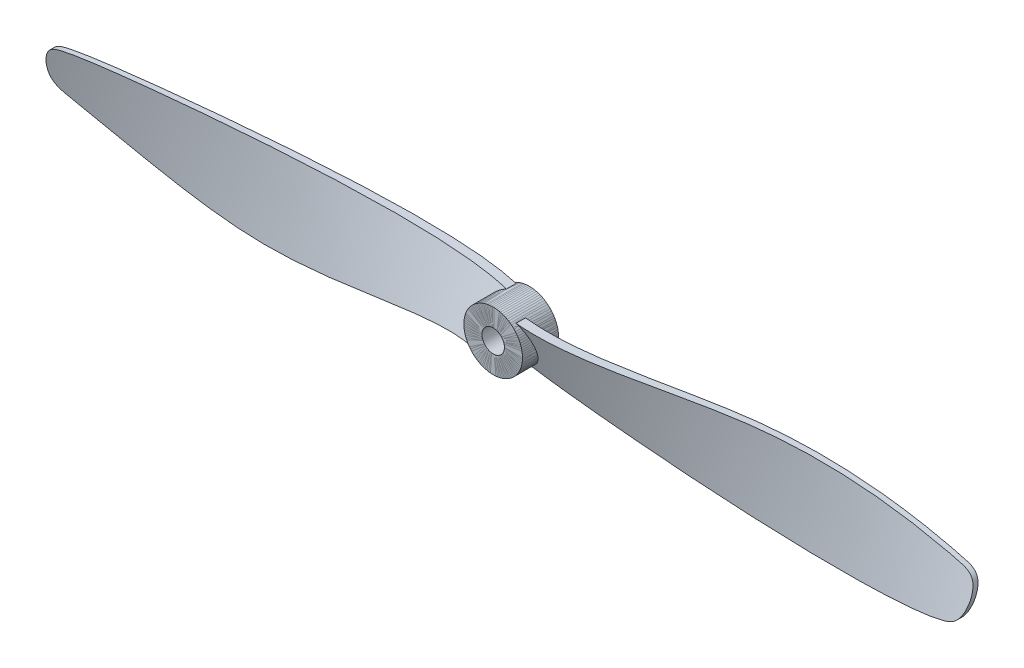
ISO-10303-21;
HEADER;
FILE_DESCRIPTION(('STEP AP214'),'2;1');
FILE_NAME('part.step','',(''),(''),'','','');
FILE_SCHEMA(('AUTOMOTIVE_DESIGN { 1 0 10303 214 1 1 1 1 }'));
ENDSEC;
DATA;
#1=APPLICATION_CONTEXT('core data for automotive mechanical design processes');
#2=APPLICATION_PROTOCOL_DEFINITION('international standard','automotive_design',2000,#1);
#3=PRODUCT_CONTEXT('',#1,'mechanical');
#4=PRODUCT('Part','Part','',(#3));
#5=PRODUCT_RELATED_PRODUCT_CATEGORY('part','',(#4));
#6=PRODUCT_DEFINITION_FORMATION('','',#4);
#7=PRODUCT_DEFINITION_CONTEXT('part definition',#1,'design');
#8=PRODUCT_DEFINITION('design','',#6,#7);
#9=PRODUCT_DEFINITION_SHAPE('','',#8);
#10=(LENGTH_UNIT() NAMED_UNIT(*) SI_UNIT(.MILLI.,.METRE.));
#11=(NAMED_UNIT(*) PLANE_ANGLE_UNIT() SI_UNIT($,.RADIAN.));
#12=(NAMED_UNIT(*) SI_UNIT($,.STERADIAN.) SOLID_ANGLE_UNIT());
#13=UNCERTAINTY_MEASURE_WITH_UNIT(LENGTH_MEASURE(1.E-05),#10,'distance_accuracy_value','');
#14=(GEOMETRIC_REPRESENTATION_CONTEXT(3) GLOBAL_UNCERTAINTY_ASSIGNED_CONTEXT((#13)) GLOBAL_UNIT_ASSIGNED_CONTEXT((#10,
#11,#12)) REPRESENTATION_CONTEXT('',''));
#15=CARTESIAN_POINT('',(0.,0.,0.));
#16=DIRECTION('',(0.,0.,1.));
#17=DIRECTION('',(1.,0.,0.));
#18=AXIS2_PLACEMENT_3D('',#15,#16,#17);
#19=CARTESIAN_POINT('',(0.,0.,4.));
#20=DIRECTION('',(0.,0.,-1.));
#21=DIRECTION('',(1.,0.,0.));
#22=AXIS2_PLACEMENT_3D('',#19,#20,#21);
#23=CYLINDRICAL_SURFACE('',#22,6.5);
#24=DIRECTION('',(0.,0.,1.));
#25=VECTOR('',#24,1.);
#26=CARTESIAN_POINT('',(-4.15331193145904,-5.,-7.31615603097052));
#27=LINE('',#26,#25);
#28=CARTESIAN_POINT('',(-4.15331193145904,-5.,0.980004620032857));
#29=VERTEX_POINT('',#28);
#30=CARTESIAN_POINT('',(-4.15331193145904,-5.,3.09090223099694));
#31=VERTEX_POINT('',#30);
#32=EDGE_CURVE('E81',#29,#31,#27,.T.);
#33=ORIENTED_EDGE('',*,*,#32,.F.);
#34=CARTESIAN_POINT('',(0.,-6.5,1.74550939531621));
#35=CARTESIAN_POINT('',(-0.17525649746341,-6.50002625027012,1.73900615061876));
#36=CARTESIAN_POINT('',(-0.350377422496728,-6.49291327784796,1.72939215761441));
#37=CARTESIAN_POINT('',(-0.6989984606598,-6.46466405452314,1.70425466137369));
#38=CARTESIAN_POINT('',(-0.872499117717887,-6.44353269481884,1.68873322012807));
#39=CARTESIAN_POINT('',(-1.21609631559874,-6.38759232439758,1.65214722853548));
#40=CARTESIAN_POINT('',(-1.38620206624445,-6.35282786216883,1.63110080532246));
#41=CARTESIAN_POINT('',(-1.72241685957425,-6.27002793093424,1.5837966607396));
#42=CARTESIAN_POINT('',(-1.88852565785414,-6.22199165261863,1.55753862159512));
#43=CARTESIAN_POINT('',(-2.21544376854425,-6.11321953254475,1.50022334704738));
#44=CARTESIAN_POINT('',(-2.37625923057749,-6.05249907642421,1.46917193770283));
#45=CARTESIAN_POINT('',(-2.69186442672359,-5.91888858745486,1.40262249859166));
#46=CARTESIAN_POINT('',(-2.84665191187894,-5.84599406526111,1.36712282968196));
#47=CARTESIAN_POINT('',(-3.14926964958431,-5.68868948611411,1.29206716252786));
#48=CARTESIAN_POINT('',(-3.29709845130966,-5.60427704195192,1.25251032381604));
#49=CARTESIAN_POINT('',(-3.58500940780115,-5.42462097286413,1.16971398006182));
#50=CARTESIAN_POINT('',(-3.72508859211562,-5.32937323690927,1.12647307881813));
#51=CARTESIAN_POINT('',(-4.00279289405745,-5.12432967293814,1.03468387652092));
#52=CARTESIAN_POINT('',(-4.14002864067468,-5.01407394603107,0.98598475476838));
#53=CARTESIAN_POINT('',(-4.40451040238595,-4.78341820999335,0.885370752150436));
#54=CARTESIAN_POINT('',(-4.53175274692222,-4.66301450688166,0.833454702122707));
#55=CARTESIAN_POINT('',(-4.77553449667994,-4.41302009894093,0.726812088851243));
#56=CARTESIAN_POINT('',(-4.89207569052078,-4.28343093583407,0.672085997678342));
#57=CARTESIAN_POINT('',(-5.11396113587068,-4.01592006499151,0.560152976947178));
#58=CARTESIAN_POINT('',(-5.21930115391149,-3.877995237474,0.502945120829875));
#59=CARTESIAN_POINT('',(-5.42495617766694,-3.58524275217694,0.382474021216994));
#60=CARTESIAN_POINT('',(-5.52445507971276,-3.42990230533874,0.319062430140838));
#61=CARTESIAN_POINT('',(-5.70962195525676,-3.11192566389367,0.190171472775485));
#62=CARTESIAN_POINT('',(-5.79528472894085,-2.94928675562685,0.124691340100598));
#63=CARTESIAN_POINT('',(-5.95231965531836,-2.61792001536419,-0.00796103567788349));
#64=CARTESIAN_POINT('',(-6.02369200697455,-2.44919226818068,-0.0751332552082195));
#65=CARTESIAN_POINT('',(-6.1518137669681,-2.10679929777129,-0.210842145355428));
#66=CARTESIAN_POINT('',(-6.20856232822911,-1.9331337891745,-0.279378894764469));
#67=CARTESIAN_POINT('',(-6.30965413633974,-1.57319484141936,-0.420979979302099));
#68=CARTESIAN_POINT('',(-6.35322945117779,-1.38672671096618,-0.494098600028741));
#69=CARTESIAN_POINT('',(-6.42374125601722,-1.01098460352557,-0.641149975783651));
#70=CARTESIAN_POINT('',(-6.45067720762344,-0.821710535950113,-0.715082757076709));
#71=CARTESIAN_POINT('',(-6.48778639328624,-0.441681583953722,-0.863441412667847));
#72=CARTESIAN_POINT('',(-6.49795684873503,-0.250926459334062,-0.937867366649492));
#73=CARTESIAN_POINT('',(-6.50148697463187,0.130675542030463,-1.08687272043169));
#74=CARTESIAN_POINT('',(-6.49484678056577,0.32152241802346,-1.16145211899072));
#75=CARTESIAN_POINT('',(-6.46442097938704,0.706778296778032,-1.31232767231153));
#76=CARTESIAN_POINT('',(-6.44020570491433,0.901155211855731,-1.38861950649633));
#77=CARTESIAN_POINT('',(-6.37430517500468,1.28706573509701,-1.54064057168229));
#78=CARTESIAN_POINT('',(-6.33262615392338,1.47860033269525,-1.61636999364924));
#79=CARTESIAN_POINT('',(-6.23201295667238,1.8575417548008,-1.76696148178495));
#80=CARTESIAN_POINT('',(-6.17307094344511,2.04494666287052,-1.84182313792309));
#81=CARTESIAN_POINT('',(-6.03829841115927,2.41402838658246,-1.99022845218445));
#82=CARTESIAN_POINT('',(-5.96247460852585,2.59570744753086,-2.06377262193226));
#83=CARTESIAN_POINT('',(-5.794563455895,2.95154918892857,-2.20898349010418));
#84=CARTESIAN_POINT('',(-5.70251685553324,3.12572937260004,-2.28065438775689));
#85=CARTESIAN_POINT('',(-5.50260109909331,3.46557790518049,-2.42184177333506));
#86=CARTESIAN_POINT('',(-5.39473848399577,3.63124973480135,-2.49135913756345));
#87=CARTESIAN_POINT('',(-5.16375959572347,3.95282030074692,-2.62782008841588));
#88=CARTESIAN_POINT('',(-5.04063870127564,4.10871605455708,-2.6947628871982));
#89=CARTESIAN_POINT('',(-4.77997201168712,4.40924175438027,-2.82551329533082));
#90=CARTESIAN_POINT('',(-4.64243280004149,4.55387678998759,-2.88932231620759));
#91=CARTESIAN_POINT('',(-4.35855327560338,4.82601093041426,-3.01122521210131));
#92=CARTESIAN_POINT('',(-4.21265691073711,4.95391958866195,-3.06943850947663));
#93=CARTESIAN_POINT('',(-3.90912573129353,5.19677727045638,-3.18188942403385));
#94=CARTESIAN_POINT('',(-3.75149613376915,5.31173199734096,-3.23612878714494));
#95=CARTESIAN_POINT('',(-3.42540065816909,5.52764771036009,-3.34011567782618));
#96=CARTESIAN_POINT('',(-3.25692934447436,5.62860159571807,-3.38986092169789));
#97=CARTESIAN_POINT('',(-2.91042135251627,5.81533939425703,-3.48422448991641));
#98=CARTESIAN_POINT('',(-2.73238570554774,5.90112493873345,-3.528843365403));
#99=CARTESIAN_POINT('',(-2.37936713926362,6.05170452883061,-3.60975360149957));
#100=CARTESIAN_POINT('',(-2.20487668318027,6.1174688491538,-3.64638936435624));
#101=CARTESIAN_POINT('',(-1.84991536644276,6.23399508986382,-3.71408814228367));
#102=CARTESIAN_POINT('',(-1.66944524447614,6.28475885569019,-3.74515184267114));
#103=CARTESIAN_POINT('',(-1.30434863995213,6.37053845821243,-3.80113582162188));
#104=CARTESIAN_POINT('',(-1.11973341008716,6.40559253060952,-3.82607094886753));
#105=CARTESIAN_POINT('',(-0.747501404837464,6.45960992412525,-3.86941024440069));
#106=CARTESIAN_POINT('',(-0.559887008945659,6.47858541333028,-3.88781934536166));
#107=CARTESIAN_POINT('',(-0.309753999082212,6.49291139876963,-3.90766666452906));
#108=CARTESIAN_POINT('',(-0.247831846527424,6.49556978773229,-3.91219990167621));
#109=CARTESIAN_POINT('',(-0.123949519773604,6.49911291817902,-3.92050232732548));
#110=CARTESIAN_POINT('',(-0.061989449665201,6.4999994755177,-3.92427229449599));
#111=CARTESIAN_POINT('',(0.,6.5,-3.92765764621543));
#112=B_SPLINE_CURVE_WITH_KNOTS('',3,(#34,#35,#36,#37,#38,#39,#40,#41,#42,#43,#44,#45,#46,#47,
#48,#49,#50,#51,#52,#53,#54,#55,#56,#57,#58,#59,#60,#61,#62,#63,#64,#65,#66,#67,#68,#69,#70,#71,
#72,#73,#74,#75,#76,#77,#78,#79,#80,#81,#82,#83,#84,#85,#86,#87,#88,#89,#90,#91,#92,#93,#94,#95,
#96,#97,#98,#99,#100,#101,#102,#103,#104,#105,#106,#107,#108,#109,#110,#111),.UNSPECIFIED.,.F.,
.F.,(4,2,2,2,2,2,2,2,2,2,2,2,2,2,2,2,2,2,2,2,2,2,2,2,2,2,2,2,2,2,2,2,2,2,2,2,2,2,4),(0.,
0.525930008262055,1.05167660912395,1.57571936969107,2.09979409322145,2.62323677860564,
3.14687291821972,3.67061775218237,4.19456196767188,4.74191891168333,5.2894759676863,
5.83694133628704,6.38461288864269,6.96916568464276,7.55393765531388,8.13870148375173,
8.72349917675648,9.33772400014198,9.95196869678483,10.5663151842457,11.1806567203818,
11.8105461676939,12.4402109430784,13.0701620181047,13.6998629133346,14.328004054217,
14.9558861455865,15.5839588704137,16.2117460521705,16.8186854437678,17.4253565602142,
18.032334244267,18.6392466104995,19.2086146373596,19.777912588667,20.3458173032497,
20.9132918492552,21.0997043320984,21.2859256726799),.UNSPECIFIED.);
#113=CARTESIAN_POINT('',(-2.5,6.,-3.58200865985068));
#114=VERTEX_POINT('',#113);
#115=EDGE_CURVE('E63',#29,#114,#112,.T.);
#116=ORIENTED_EDGE('',*,*,#115,.T.);
#117=DIRECTION('',(0.,0.,1.));
#118=VECTOR('',#117,1.);
#119=CARTESIAN_POINT('',(-2.5,6.,-7.31615603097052));
#120=LINE('',#119,#118);
#121=CARTESIAN_POINT('',(-2.5,6.,-1.44303536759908));
#122=VERTEX_POINT('',#121);
#123=EDGE_CURVE('E73',#114,#122,#120,.T.);
#124=ORIENTED_EDGE('',*,*,#123,.T.);
#125=CARTESIAN_POINT('',(0.,6.5,-1.74550939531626));
#126=CARTESIAN_POINT('',(-0.17525649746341,6.50002625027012,-1.73900615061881));
#127=CARTESIAN_POINT('',(-0.350377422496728,6.49291327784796,-1.72939215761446));
#128=CARTESIAN_POINT('',(-0.6989984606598,6.46466405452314,-1.70425466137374));
#129=CARTESIAN_POINT('',(-0.872499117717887,6.44353269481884,-1.68873322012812));
#130=CARTESIAN_POINT('',(-1.21609631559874,6.38759232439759,-1.65214722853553));
#131=CARTESIAN_POINT('',(-1.38620206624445,6.35282786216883,-1.63110080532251));
#132=CARTESIAN_POINT('',(-1.72241685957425,6.27002793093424,-1.58379666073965));
#133=CARTESIAN_POINT('',(-1.88852565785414,6.22199165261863,-1.55753862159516));
#134=CARTESIAN_POINT('',(-2.21544376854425,6.11321953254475,-1.50022334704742));
#135=CARTESIAN_POINT('',(-2.37625923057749,6.05249907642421,-1.46917193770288));
#136=CARTESIAN_POINT('',(-2.6918644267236,5.91888858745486,-1.40262249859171));
#137=CARTESIAN_POINT('',(-2.84665191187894,5.84599406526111,-1.36712282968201));
#138=CARTESIAN_POINT('',(-3.14926964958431,5.68868948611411,-1.29206716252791));
#139=CARTESIAN_POINT('',(-3.29709845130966,5.60427704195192,-1.25251032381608));
#140=CARTESIAN_POINT('',(-3.58500940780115,5.42462097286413,-1.16971398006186));
#141=CARTESIAN_POINT('',(-3.72508859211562,5.32937323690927,-1.12647307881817));
#142=CARTESIAN_POINT('',(-4.00279289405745,5.12432967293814,-1.03468387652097));
#143=CARTESIAN_POINT('',(-4.14002864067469,5.01407394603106,-0.985984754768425));
#144=CARTESIAN_POINT('',(-4.40451040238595,4.78341820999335,-0.885370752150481));
#145=CARTESIAN_POINT('',(-4.53175274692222,4.66301450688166,-0.833454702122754));
#146=CARTESIAN_POINT('',(-4.77553449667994,4.41302009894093,-0.726812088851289));
#147=CARTESIAN_POINT('',(-4.89207569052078,4.28343093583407,-0.672085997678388));
#148=CARTESIAN_POINT('',(-5.11396113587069,4.01592006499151,-0.560152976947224));
#149=CARTESIAN_POINT('',(-5.21930115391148,3.87799523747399,-0.502945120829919));
#150=CARTESIAN_POINT('',(-5.42495617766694,3.58524275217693,-0.382474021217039));
#151=CARTESIAN_POINT('',(-5.52445507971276,3.42990230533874,-0.319062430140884));
#152=CARTESIAN_POINT('',(-5.70962195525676,3.11192566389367,-0.19017147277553));
#153=CARTESIAN_POINT('',(-5.79528472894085,2.94928675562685,-0.124691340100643));
#154=CARTESIAN_POINT('',(-5.95231965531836,2.61792001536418,0.00796103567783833));
#155=CARTESIAN_POINT('',(-6.02369200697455,2.44919226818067,0.0751332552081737));
#156=CARTESIAN_POINT('',(-6.1518137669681,2.10679929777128,0.210842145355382));
#157=CARTESIAN_POINT('',(-6.20856232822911,1.93313378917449,0.279378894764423));
#158=CARTESIAN_POINT('',(-6.30965413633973,1.57319484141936,0.420979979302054));
#159=CARTESIAN_POINT('',(-6.35322945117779,1.38672671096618,0.494098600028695));
#160=CARTESIAN_POINT('',(-6.42374125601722,1.01098460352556,0.641149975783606));
#161=CARTESIAN_POINT('',(-6.45067720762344,0.821710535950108,0.715082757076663));
#162=CARTESIAN_POINT('',(-6.48778639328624,0.441681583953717,0.863441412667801));
#163=CARTESIAN_POINT('',(-6.49795684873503,0.250926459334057,0.937867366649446));
#164=CARTESIAN_POINT('',(-6.50148697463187,-0.130675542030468,1.08687272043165));
#165=CARTESIAN_POINT('',(-6.49484678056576,-0.321522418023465,1.16145211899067));
#166=CARTESIAN_POINT('',(-6.46442097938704,-0.706778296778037,1.31232767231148));
#167=CARTESIAN_POINT('',(-6.44020570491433,-0.901155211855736,1.38861950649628));
#168=CARTESIAN_POINT('',(-6.37430517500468,-1.28706573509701,1.54064057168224));
#169=CARTESIAN_POINT('',(-6.33262615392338,-1.47860033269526,1.6163699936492));
#170=CARTESIAN_POINT('',(-6.23201295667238,-1.8575417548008,1.76696148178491));
#171=CARTESIAN_POINT('',(-6.17307094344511,-2.04494666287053,1.84182313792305));
#172=CARTESIAN_POINT('',(-6.03829841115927,-2.41402838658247,1.9902284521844));
#173=CARTESIAN_POINT('',(-5.96247460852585,-2.59570744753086,2.06377262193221));
#174=CARTESIAN_POINT('',(-5.794563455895,-2.95154918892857,2.20898349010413));
#175=CARTESIAN_POINT('',(-5.70251685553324,-3.12572937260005,2.28065438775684));
#176=CARTESIAN_POINT('',(-5.50260109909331,-3.4655779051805,2.42184177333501));
#177=CARTESIAN_POINT('',(-5.39473848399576,-3.63124973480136,2.4913591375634));
#178=CARTESIAN_POINT('',(-5.16375959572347,-3.95282030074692,2.62782008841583));
#179=CARTESIAN_POINT('',(-5.04063870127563,-4.10871605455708,2.69476288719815));
#180=CARTESIAN_POINT('',(-4.77997201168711,-4.40924175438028,2.82551329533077));
#181=CARTESIAN_POINT('',(-4.64243280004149,-4.5538767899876,2.88932231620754));
#182=CARTESIAN_POINT('',(-4.35855327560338,-4.82601093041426,3.01122521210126));
#183=CARTESIAN_POINT('',(-4.2126569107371,-4.95391958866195,3.06943850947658));
#184=CARTESIAN_POINT('',(-3.90912573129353,-5.19677727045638,3.18188942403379));
#185=CARTESIAN_POINT('',(-3.75149613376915,-5.31173199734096,3.23612878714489));
#186=CARTESIAN_POINT('',(-3.42540065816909,-5.5276477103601,3.34011567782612));
#187=CARTESIAN_POINT('',(-3.25692934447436,-5.62860159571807,3.38986092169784));
#188=CARTESIAN_POINT('',(-2.91042135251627,-5.81533939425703,3.48422448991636));
#189=CARTESIAN_POINT('',(-2.73238570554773,-5.90112493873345,3.52884336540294));
#190=CARTESIAN_POINT('',(-2.37936713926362,-6.05170452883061,3.60975360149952));
#191=CARTESIAN_POINT('',(-2.20487668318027,-6.1174688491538,3.64638936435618));
#192=CARTESIAN_POINT('',(-1.84991536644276,-6.23399508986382,3.71408814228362));
#193=CARTESIAN_POINT('',(-1.66944524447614,-6.28475885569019,3.74515184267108));
#194=CARTESIAN_POINT('',(-1.30434863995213,-6.37053845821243,3.80113582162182));
#195=CARTESIAN_POINT('',(-1.11973341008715,-6.40559253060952,3.82607094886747));
#196=CARTESIAN_POINT('',(-0.747501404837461,-6.45960992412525,3.86941024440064));
#197=CARTESIAN_POINT('',(-0.559887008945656,-6.47858541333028,3.8878193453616));
#198=CARTESIAN_POINT('',(-0.30975399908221,-6.49291139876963,3.90766666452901));
#199=CARTESIAN_POINT('',(-0.247831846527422,-6.49556978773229,3.91219990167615));
#200=CARTESIAN_POINT('',(-0.123949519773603,-6.49911291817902,3.92050232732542));
#201=CARTESIAN_POINT('',(-0.0619894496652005,-6.4999994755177,3.92427229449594));
#202=CARTESIAN_POINT('',(0.,-6.5,3.92765764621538));
#203=B_SPLINE_CURVE_WITH_KNOTS('',3,(#125,#126,#127,#128,#129,#130,#131,#132,#133,#134,#135,
#136,#137,#138,#139,#140,#141,#142,#143,#144,#145,#146,#147,#148,#149,#150,#151,#152,#153,#154,
#155,#156,#157,#158,#159,#160,#161,#162,#163,#164,#165,#166,#167,#168,#169,#170,#171,#172,#173,
#174,#175,#176,#177,#178,#179,#180,#181,#182,#183,#184,#185,#186,#187,#188,#189,#190,#191,#192,
#193,#194,#195,#196,#197,#198,#199,#200,#201,#202),.UNSPECIFIED.,.F.,.F.,(4,2,2,2,2,2,2,2,2,2,2,
2,2,2,2,2,2,2,2,2,2,2,2,2,2,2,2,2,2,2,2,2,2,2,2,2,2,2,4),(0.,0.525930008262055,1.05167660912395,
1.57571936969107,2.09979409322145,2.62323677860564,3.14687291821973,3.67061775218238,
4.19456196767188,4.74191891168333,5.2894759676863,5.83694133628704,6.38461288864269,
6.96916568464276,7.55393765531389,8.13870148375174,8.72349917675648,9.33772400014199,
9.95196869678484,10.5663151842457,11.1806567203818,11.8105461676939,12.4402109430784,
13.0701620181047,13.6998629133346,14.328004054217,14.9558861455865,15.5839588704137,
16.2117460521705,16.8186854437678,17.4253565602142,18.032334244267,18.6392466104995,
19.2086146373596,19.7779125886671,20.3458173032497,20.9132918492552,21.0997043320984,
21.2859256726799),.UNSPECIFIED.);
#204=EDGE_CURVE('E91',#122,#31,#203,.T.);
#205=ORIENTED_EDGE('',*,*,#204,.T.);
#206=EDGE_LOOP('',(#33,#116,#124,#205));
#207=FACE_BOUND('',#206,.T.);
#208=CARTESIAN_POINT('',(0.,0.,4.));
#209=DIRECTION('',(0.,0.,1.));
#210=DIRECTION('',(-1.,0.,0.));
#211=AXIS2_PLACEMENT_3D('',#208,#209,#210);
#212=CIRCLE('',#211,6.5);
#213=CARTESIAN_POINT('',(-6.5,0.,4.));
#214=VERTEX_POINT('',#213);
#215=EDGE_CURVE('E94',#214,#214,#212,.T.);
#216=ORIENTED_EDGE('',*,*,#215,.F.);
#217=EDGE_LOOP('',(#216));
#218=FACE_BOUND('',#217,.T.);
#219=CARTESIAN_POINT('',(0.,0.,-4.));
#220=DIRECTION('',(0.,0.,1.));
#221=DIRECTION('',(-1.,0.,0.));
#222=AXIS2_PLACEMENT_3D('',#219,#220,#221);
#223=CIRCLE('',#222,6.5);
#224=CARTESIAN_POINT('',(-6.5,0.,-4.));
#225=VERTEX_POINT('',#224);
#226=EDGE_CURVE('E85',#225,#225,#223,.T.);
#227=ORIENTED_EDGE('',*,*,#226,.T.);
#228=EDGE_LOOP('',(#227));
#229=FACE_BOUND('',#228,.T.);
#230=ADVANCED_FACE('F54',(#207,#218,#229),#23,.T.);
#231=CARTESIAN_POINT('',(0.,0.,4.));
#232=DIRECTION('',(0.,0.,1.));
#233=DIRECTION('',(-1.,0.,0.));
#234=AXIS2_PLACEMENT_3D('',#231,#232,#233);
#235=PLANE('',#234);
#236=CARTESIAN_POINT('',(0.,0.,4.));
#237=DIRECTION('',(0.,0.,1.));
#238=DIRECTION('',(1.,0.,0.));
#239=AXIS2_PLACEMENT_3D('',#236,#237,#238);
#240=CIRCLE('',#239,2.5);
#241=CARTESIAN_POINT('',(2.5,0.,4.));
#242=VERTEX_POINT('',#241);
#243=EDGE_CURVE('E198',#242,#242,#240,.T.);
#244=ORIENTED_EDGE('',*,*,#243,.F.);
#245=EDGE_LOOP('',(#244));
#246=FACE_BOUND('',#245,.T.);
#247=ORIENTED_EDGE('',*,*,#215,.T.);
#248=EDGE_LOOP('',(#247));
#249=FACE_BOUND('',#248,.T.);
#250=ADVANCED_FACE('F143',(#246,#249),#235,.T.);
#251=CARTESIAN_POINT('',(0.,0.,-4.));
#252=DIRECTION('',(0.,0.,1.));
#253=DIRECTION('',(-1.,0.,0.));
#254=AXIS2_PLACEMENT_3D('',#251,#252,#253);
#255=PLANE('',#254);
#256=CARTESIAN_POINT('',(0.,0.,-4.));
#257=DIRECTION('',(0.,0.,1.));
#258=DIRECTION('',(1.,0.,0.));
#259=AXIS2_PLACEMENT_3D('',#256,#257,#258);
#260=CIRCLE('',#259,2.5);
#261=CARTESIAN_POINT('',(2.5,0.,-4.));
#262=VERTEX_POINT('',#261);
#263=EDGE_CURVE('E58',#262,#262,#260,.T.);
#264=ORIENTED_EDGE('',*,*,#263,.T.);
#265=EDGE_LOOP('',(#264));
#266=FACE_BOUND('',#265,.T.);
#267=ORIENTED_EDGE('',*,*,#226,.F.);
#268=EDGE_LOOP('',(#267));
#269=FACE_BOUND('',#268,.T.);
#270=ADVANCED_FACE('F118',(#266,#269),#255,.F.);
#271=CARTESIAN_POINT('',(0.,14.2644777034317,-7.31605603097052));
#272=CARTESIAN_POINT('',(-120.,15.0424214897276,5.47499367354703));
#273=CARTESIAN_POINT('',(0.,9.37632830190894,-5.18288002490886));
#274=CARTESIAN_POINT('',(-120.,10.0901483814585,3.49523724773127));
#275=CARTESIAN_POINT('',(0.,4.48817890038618,-3.0497040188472));
#276=CARTESIAN_POINT('',(-120.,5.13787527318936,1.51548082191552));
#277=CARTESIAN_POINT('',(0.,-5.28811990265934,1.21664799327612));
#278=CARTESIAN_POINT('',(-120.,-4.76667094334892,-2.44403202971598));
#279=CARTESIAN_POINT('',(0.,-10.1762693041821,3.34982399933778));
#280=CARTESIAN_POINT('',(-120.,-9.71894405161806,-4.42378845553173));
#281=CARTESIAN_POINT('',(0.,-15.0644187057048,5.48300000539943));
#282=CARTESIAN_POINT('',(-120.,-14.6712171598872,-6.40354488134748));
#283=B_SPLINE_SURFACE_WITH_KNOTS('',3,1,((#271,#272),(#273,#274),(#275,#276),(#277,#278),(#279,
#280),(#281,#282)),.UNSPECIFIED.,.F.,.F.,.F.,(4,2,4),(2,2),(0.,0.5,1.),(0.,1.),.UNSPECIFIED.);
#284=CARTESIAN_POINT('',(-2.5,6.,-3.58200865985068));
#285=CARTESIAN_POINT('',(-2.67217406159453,6.0423536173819,-3.59098326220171));
#286=CARTESIAN_POINT('',(-2.84471071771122,6.08336327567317,-3.59922699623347));
#287=CARTESIAN_POINT('',(-3.19038877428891,6.16296596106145,-3.614395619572));
#288=CARTESIAN_POINT('',(-3.36353013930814,6.20155912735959,-3.62132058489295));
#289=CARTESIAN_POINT('',(-3.7102745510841,6.27659574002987,-3.63399401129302));
#290=CARTESIAN_POINT('',(-3.88387747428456,6.31303971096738,-3.63974276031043));
#291=CARTESIAN_POINT('',(-4.23151000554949,6.38400162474,-3.65017846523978));
#292=CARTESIAN_POINT('',(-4.4055396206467,6.41851953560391,-3.65486540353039));
#293=CARTESIAN_POINT('',(-4.92789652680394,6.51941533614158,-3.6674773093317));
#294=CARTESIAN_POINT('',(-5.27676263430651,6.58319322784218,-3.67396293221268));
#295=CARTESIAN_POINT('',(-5.97556059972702,6.70497595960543,-3.68371684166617));
#296=CARTESIAN_POINT('',(-6.32549253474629,6.76298037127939,-3.68698488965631));
#297=CARTESIAN_POINT('',(-7.02418347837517,6.87375974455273,-3.69075926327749));
#298=CARTESIAN_POINT('',(-7.3729380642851,6.92656220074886,-3.69128096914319));
#299=CARTESIAN_POINT('',(-8.07104127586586,7.02795890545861,-3.68996536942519));
#300=CARTESIAN_POINT('',(-8.42038988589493,7.07655326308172,-3.68812812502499));
#301=CARTESIAN_POINT('',(-9.11964094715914,7.17006529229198,-3.68238393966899));
#302=CARTESIAN_POINT('',(-9.46954350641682,7.21498212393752,-3.6784765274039));
#303=CARTESIAN_POINT('',(-10.1697279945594,7.30154274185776,-3.66882728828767));
#304=CARTESIAN_POINT('',(-10.5200099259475,7.34318650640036,-3.6630854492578));
#305=CARTESIAN_POINT('',(-11.5701773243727,7.46360814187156,-3.6434333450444));
#306=CARTESIAN_POINT('',(-12.2705194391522,7.53802566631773,-3.62708579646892));
#307=CARTESIAN_POINT('',(-13.6719335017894,7.67731103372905,-3.58911898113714));
#308=CARTESIAN_POINT('',(-14.3730053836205,7.74217967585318,-3.56750015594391));
#309=CARTESIAN_POINT('',(-15.7754297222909,7.86384062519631,-3.51990275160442));
#310=CARTESIAN_POINT('',(-16.4767819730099,7.92063597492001,-3.49392582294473));
#311=CARTESIAN_POINT('',(-17.879878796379,8.02730182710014,-3.43830930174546));
#312=CARTESIAN_POINT('',(-18.5816233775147,8.07717217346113,-3.40866962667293));
#313=CARTESIAN_POINT('',(-19.9853279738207,8.1708461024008,-3.34629085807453));
#314=CARTESIAN_POINT('',(-20.6872879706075,8.21465010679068,-3.31355198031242));
#315=CARTESIAN_POINT('',(-22.0913967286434,8.29686932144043,-3.24542797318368));
#316=CARTESIAN_POINT('',(-22.793545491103,8.33528449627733,-3.21004282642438));
#317=CARTESIAN_POINT('',(-24.9002469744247,8.44329191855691,-3.10050282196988));
#318=CARTESIAN_POINT('',(-26.3049979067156,8.50564235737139,-3.02296599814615));
#319=CARTESIAN_POINT('',(-29.1125741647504,8.61418389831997,-2.86142297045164));
#320=CARTESIAN_POINT('',(-30.5153991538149,8.66039954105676,-2.77742683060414));
#321=CARTESIAN_POINT('',(-33.3217188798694,8.7389878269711,-2.60464006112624));
#322=CARTESIAN_POINT('',(-34.7252136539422,8.7713547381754,-2.51584746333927));
#323=CARTESIAN_POINT('',(-37.5326600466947,8.82376899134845,-2.33493768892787));
#324=CARTESIAN_POINT('',(-38.9366116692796,8.84381242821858,-2.24281946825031));
#325=CARTESIAN_POINT('',(-41.744749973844,8.87265223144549,-2.05649223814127));
#326=CARTESIAN_POINT('',(-43.1489366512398,8.88144651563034,-1.96228284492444));
#327=CARTESIAN_POINT('',(-45.9573140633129,8.88852844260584,-1.77284995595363));
#328=CARTESIAN_POINT('',(-47.3615047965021,8.886815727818,-1.67762642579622));
#329=CARTESIAN_POINT('',(-50.1696566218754,8.87335811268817,-1.48713616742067));
#330=CARTESIAN_POINT('',(-51.573617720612,8.86161448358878,-1.39186944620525));
#331=CARTESIAN_POINT('',(-53.8943923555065,8.83409880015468,-1.23507779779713));
#332=CARTESIAN_POINT('',(-54.8112240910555,8.82113795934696,-1.17331360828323));
#333=CARTESIAN_POINT('',(-56.6447357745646,8.7910451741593,-1.05038898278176));
#334=CARTESIAN_POINT('',(-57.5614157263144,8.77391379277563,-0.989228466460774));
#335=CARTESIAN_POINT('',(-59.3947117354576,8.7354485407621,-0.86774387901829));
#336=CARTESIAN_POINT('',(-60.3113277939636,8.71411481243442,-0.8074197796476));
#337=CARTESIAN_POINT('',(-62.1442327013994,8.66717250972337,-0.687866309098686));
#338=CARTESIAN_POINT('',(-63.0605215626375,8.64156528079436,-0.628636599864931));
#339=CARTESIAN_POINT('',(-64.8930841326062,8.5859378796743,-0.511499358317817));
#340=CARTESIAN_POINT('',(-65.8093578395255,8.5559175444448,-0.453591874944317));
#341=CARTESIAN_POINT('',(-67.6418468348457,8.49126998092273,-0.33936300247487));
#342=CARTESIAN_POINT('',(-68.5580621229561,8.45664273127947,-0.283041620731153));
#343=CARTESIAN_POINT('',(-70.0976193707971,8.39435243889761,-0.189968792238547));
#344=CARTESIAN_POINT('',(-70.7209842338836,8.36800026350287,-0.152715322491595));
#345=CARTESIAN_POINT('',(-71.9676605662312,8.31292260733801,-0.0791713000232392));
#346=CARTESIAN_POINT('',(-72.5909720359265,8.28419714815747,-0.0428807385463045));
#347=CARTESIAN_POINT('',(-73.8375365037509,8.22423522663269,0.0286331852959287));
#348=CARTESIAN_POINT('',(-74.4607895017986,8.19299876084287,0.0638565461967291));
#349=CARTESIAN_POINT('',(-75.7077451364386,8.12781739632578,0.133149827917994));
#350=CARTESIAN_POINT('',(-76.3314477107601,8.09387024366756,0.167218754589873));
#351=CARTESIAN_POINT('',(-77.5787590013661,8.02307918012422,0.234042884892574));
#352=CARTESIAN_POINT('',(-78.2023677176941,7.9862352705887,0.26679808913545));
#353=CARTESIAN_POINT('',(-79.449460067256,7.90938690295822,0.330847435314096));
#354=CARTESIAN_POINT('',(-80.0729437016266,7.86938247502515,0.362141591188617));
#355=CARTESIAN_POINT('',(-81.3204843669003,7.78582966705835,0.423133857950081));
#356=CARTESIAN_POINT('',(-81.9445412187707,7.74227720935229,0.452830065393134));
#357=CARTESIAN_POINT('',(-83.1924605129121,7.65123636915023,0.510383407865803));
#358=CARTESIAN_POINT('',(-83.8163229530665,7.60374794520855,0.538240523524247));
#359=CARTESIAN_POINT('',(-85.0638111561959,7.50426396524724,0.591866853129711));
#360=CARTESIAN_POINT('',(-85.6874369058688,7.45226818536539,0.617635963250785));
#361=CARTESIAN_POINT('',(-86.9327666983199,7.34313859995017,0.666707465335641));
#362=CARTESIAN_POINT('',(-87.5544716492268,7.28601795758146,0.690015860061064));
#363=CARTESIAN_POINT('',(-88.7973448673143,7.16545164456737,0.733822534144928));
#364=CARTESIAN_POINT('',(-89.4185131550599,7.10200622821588,0.754320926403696));
#365=CARTESIAN_POINT('',(-90.6600464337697,6.96722632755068,0.791935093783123));
#366=CARTESIAN_POINT('',(-91.2804115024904,6.89589267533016,0.809051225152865));
#367=CARTESIAN_POINT('',(-92.1111027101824,6.79327108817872,0.829134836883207));
#368=CARTESIAN_POINT('',(-92.3219573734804,6.76660820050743,0.83398740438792));
#369=CARTESIAN_POINT('',(-92.7435110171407,6.71191348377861,0.843147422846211));
#370=CARTESIAN_POINT('',(-92.9542099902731,6.68388159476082,0.8474548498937));
#371=CARTESIAN_POINT('',(-93.3754348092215,6.62627280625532,0.855467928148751));
#372=CARTESIAN_POINT('',(-93.5859606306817,6.59669571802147,0.859173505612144));
#373=CARTESIAN_POINT('',(-94.0080384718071,6.53559359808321,0.865931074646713));
#374=CARTESIAN_POINT('',(-94.2195890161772,6.5040578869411,0.868978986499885));
#375=CARTESIAN_POINT('',(-94.6423563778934,6.43891595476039,0.874300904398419));
#376=CARTESIAN_POINT('',(-94.8535732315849,6.40530997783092,0.876575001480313));
#377=CARTESIAN_POINT('',(-95.2755263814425,6.33565945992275,0.88023086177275));
#378=CARTESIAN_POINT('',(-95.4862628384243,6.29961591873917,0.881612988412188));
#379=CARTESIAN_POINT('',(-95.8558068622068,6.23372269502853,0.883116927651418));
#380=CARTESIAN_POINT('',(-96.0147269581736,6.20451022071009,0.883464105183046));
#381=CARTESIAN_POINT('',(-96.3322041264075,6.14407812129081,0.883465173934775));
#382=CARTESIAN_POINT('',(-96.4907611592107,6.11285828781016,0.883118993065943));
#383=CARTESIAN_POINT('',(-96.8075055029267,6.04798138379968,0.881610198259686));
#384=CARTESIAN_POINT('',(-96.9656924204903,6.0143223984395,0.880446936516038));
#385=CARTESIAN_POINT('',(-97.2816579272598,5.94395704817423,0.877130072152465));
#386=CARTESIAN_POINT('',(-97.4394354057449,5.90724572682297,0.874974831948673));
#387=CARTESIAN_POINT('',(-97.7525617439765,5.83009788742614,0.869389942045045));
#388=CARTESIAN_POINT('',(-97.9079196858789,5.78969782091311,0.865971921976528));
#389=CARTESIAN_POINT('',(-98.2170255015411,5.70349624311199,0.857445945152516));
#390=CARTESIAN_POINT('',(-98.3707741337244,5.65769741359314,0.852338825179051));
#391=CARTESIAN_POINT('',(-98.6755180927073,5.55890306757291,0.83988467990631));
#392=CARTESIAN_POINT('',(-98.8265186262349,5.50592322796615,0.832542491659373));
#393=CARTESIAN_POINT('',(-99.1244857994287,5.39037041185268,0.814892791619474));
#394=CARTESIAN_POINT('',(-99.2714579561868,5.32781141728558,0.80458958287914));
#395=CARTESIAN_POINT('',(-99.4881640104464,5.22439612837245,0.786211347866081));
#396=CARTESIAN_POINT('',(-99.5601914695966,5.1880827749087,0.779549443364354));
#397=CARTESIAN_POINT('',(-99.7023192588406,5.11201222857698,0.76514696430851));
#398=CARTESIAN_POINT('',(-99.7724192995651,5.07225452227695,0.757406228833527));
#399=CARTESIAN_POINT('',(-99.9102668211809,4.98907779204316,0.740763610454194));
#400=CARTESIAN_POINT('',(-99.9780145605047,4.94565917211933,0.731861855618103));
#401=CARTESIAN_POINT('',(-100.110508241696,4.85522120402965,0.712881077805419));
#402=CARTESIAN_POINT('',(-100.175264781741,4.80821643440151,0.702806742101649));
#403=CARTESIAN_POINT('',(-100.301721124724,4.71049213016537,0.681443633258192));
#404=CARTESIAN_POINT('',(-100.36342041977,4.65977198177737,0.670154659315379));
#405=CARTESIAN_POINT('',(-100.483507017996,4.55482472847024,0.646404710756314));
#406=CARTESIAN_POINT('',(-100.541894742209,4.50059807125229,0.63394388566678));
#407=CARTESIAN_POINT('',(-100.650576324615,4.39358652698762,0.609010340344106));
#408=CARTESIAN_POINT('',(-100.701139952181,4.34105453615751,0.596624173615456));
#409=CARTESIAN_POINT('',(-100.799463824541,4.23361223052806,0.571018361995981));
#410=CARTESIAN_POINT('',(-100.847223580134,4.17870150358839,0.557798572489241));
#411=CARTESIAN_POINT('',(-100.940106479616,4.0668060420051,0.530614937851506));
#412=CARTESIAN_POINT('',(-100.985227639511,4.00981979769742,0.516650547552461));
#413=CARTESIAN_POINT('',(-101.072967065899,3.89412013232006,0.488078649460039));
#414=CARTESIAN_POINT('',(-101.115585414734,3.83540676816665,0.473471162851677));
#415=CARTESIAN_POINT('',(-101.240592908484,3.65606934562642,0.428552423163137));
#416=CARTESIAN_POINT('',(-101.319396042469,3.53315135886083,0.397364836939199));
#417=CARTESIAN_POINT('',(-101.468455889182,3.28278399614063,0.333154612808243));
#418=CARTESIAN_POINT('',(-101.538713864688,3.15533529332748,0.300132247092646));
#419=CARTESIAN_POINT('',(-101.660651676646,2.91789126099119,0.23807470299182));
#420=CARTESIAN_POINT('',(-101.713494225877,2.80843073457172,0.2092651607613));
#421=CARTESIAN_POINT('',(-101.814043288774,2.58741578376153,0.150736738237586));
#422=CARTESIAN_POINT('',(-101.861749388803,2.47586119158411,0.121017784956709));
#423=CARTESIAN_POINT('',(-101.997578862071,2.13842406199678,0.0306490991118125));
#424=CARTESIAN_POINT('',(-102.078363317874,1.90986726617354,-0.0311864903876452));
#425=CARTESIAN_POINT('',(-102.22097109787,1.44829384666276,-0.157030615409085));
#426=CARTESIAN_POINT('',(-102.282845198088,1.21529098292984,-0.221032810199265));
#427=CARTESIAN_POINT('',(-102.387575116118,0.745615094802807,-0.350732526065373));
#428=CARTESIAN_POINT('',(-102.430442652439,0.508944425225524,-0.416428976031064));
#429=CARTESIAN_POINT('',(-102.483669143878,0.120199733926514,-0.524667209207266));
#430=CARTESIAN_POINT('',(-102.500183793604,-0.031139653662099,-0.566884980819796));
#431=CARTESIAN_POINT('',(-102.524200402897,-0.334453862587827,-0.651578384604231));
#432=CARTESIAN_POINT('',(-102.53170419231,-0.486428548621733,-0.694053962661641));
#433=CARTESIAN_POINT('',(-102.53667126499,-0.790464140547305,-0.779019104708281));
#434=CARTESIAN_POINT('',(-102.534140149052,-0.942524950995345,-0.821508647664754));
#435=CARTESIAN_POINT('',(-102.517608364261,-1.24609429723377,-0.906216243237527));
#436=CARTESIAN_POINT('',(-102.503612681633,-1.39760304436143,-0.948434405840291));
#437=CARTESIAN_POINT('',(-102.470009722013,-1.64195117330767,-1.01632038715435));
#438=CARTESIAN_POINT('',(-102.454528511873,-1.73530170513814,-1.0422070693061));
#439=CARTESIAN_POINT('',(-102.417754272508,-1.9209590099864,-1.09355570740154));
#440=CARTESIAN_POINT('',(-102.396462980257,-2.01326608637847,-1.11901778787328));
#441=CARTESIAN_POINT('',(-102.347400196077,-2.19615354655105,-1.16928574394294));
#442=CARTESIAN_POINT('',(-102.319640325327,-2.28673671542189,-1.19409270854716));
#443=CARTESIAN_POINT('',(-102.256802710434,-2.46558839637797,-1.24284032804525));
#444=CARTESIAN_POINT('',(-102.221726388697,-2.55385735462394,-1.26678115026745));
#445=CARTESIAN_POINT('',(-102.151411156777,-2.70931713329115,-1.30868152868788));
#446=CARTESIAN_POINT('',(-102.117673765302,-2.77712558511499,-1.32686268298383));
#447=CARTESIAN_POINT('',(-102.04457372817,-2.9099060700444,-1.36224021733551));
#448=CARTESIAN_POINT('',(-102.005212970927,-2.97487904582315,-1.37943692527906));
#449=CARTESIAN_POINT('',(-101.920670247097,-3.10114497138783,-1.41259387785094));
#450=CARTESIAN_POINT('',(-101.875495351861,-3.16244226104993,-1.42855558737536));
#451=CARTESIAN_POINT('',(-101.779721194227,-3.2810110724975,-1.45914492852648));
#452=CARTESIAN_POINT('',(-101.72912085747,-3.33828179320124,-1.47377229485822));
#453=CARTESIAN_POINT('',(-101.623217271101,-3.44833061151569,-1.50157540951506));
#454=CARTESIAN_POINT('',(-101.567928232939,-3.50112137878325,-1.51475528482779));
#455=CARTESIAN_POINT('',(-101.453177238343,-3.60232308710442,-1.53970722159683));
#456=CARTESIAN_POINT('',(-101.393714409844,-3.65073310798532,-1.55147898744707));
#457=CARTESIAN_POINT('',(-101.27126692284,-3.74328714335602,-1.57366541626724));
#458=CARTESIAN_POINT('',(-101.208279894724,-3.78742823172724,-1.58407915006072));
#459=CARTESIAN_POINT('',(-101.079465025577,-3.8716381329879,-1.60362612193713));
#460=CARTESIAN_POINT('',(-101.013637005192,-3.9117066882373,-1.61275927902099));
#461=CARTESIAN_POINT('',(-100.785201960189,-4.0420017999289,-1.64192132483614));
#462=CARTESIAN_POINT('',(-100.61708810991,-4.12323506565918,-1.65914237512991));
#463=CARTESIAN_POINT('',(-100.273418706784,-4.26923121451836,-1.68850713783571));
#464=CARTESIAN_POINT('',(-100.097850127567,-4.33396375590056,-1.7006415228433));
#465=CARTESIAN_POINT('',(-99.8307083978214,-4.42260049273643,-1.71620541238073));
#466=CARTESIAN_POINT('',(-99.7406059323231,-4.45084592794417,-1.7209695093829));
#467=CARTESIAN_POINT('',(-99.559637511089,-4.50491063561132,-1.72974616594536));
#468=CARTESIAN_POINT('',(-99.468771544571,-4.53072987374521,-1.73375871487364));
#469=CARTESIAN_POINT('',(-99.2865524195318,-4.58042799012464,-1.74117745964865));
#470=CARTESIAN_POINT('',(-99.1951995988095,-4.60430806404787,-1.74458403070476));
#471=CARTESIAN_POINT('',(-99.012107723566,-4.65059487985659,-1.75092273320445));
#472=CARTESIAN_POINT('',(-98.9203686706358,-4.67300162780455,-1.75385486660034));
#473=CARTESIAN_POINT('',(-98.7262409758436,-4.7192324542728,-1.75967276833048));
#474=CARTESIAN_POINT('',(-98.623821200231,-4.74293027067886,-1.76251579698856));
#475=CARTESIAN_POINT('',(-98.4187921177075,-4.78953079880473,-1.76789911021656));
#476=CARTESIAN_POINT('',(-98.3161828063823,-4.81243349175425,-1.77043938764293));
#477=CARTESIAN_POINT('',(-98.1109010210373,-4.8579874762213,-1.77536047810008));
#478=CARTESIAN_POINT('',(-98.0082285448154,-4.88063875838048,-1.77774128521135));
#479=CARTESIAN_POINT('',(-97.8028779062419,-4.92592057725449,-1.78240311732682));
#480=CARTESIAN_POINT('',(-97.7001997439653,-4.94855111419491,-1.784684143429));
#481=CARTESIAN_POINT('',(-97.4948001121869,-4.99374584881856,-1.78913417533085));
#482=CARTESIAN_POINT('',(-97.3920786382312,-5.01631002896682,-1.7913031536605));
#483=CARTESIAN_POINT('',(-97.1866194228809,-5.06137581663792,-1.79553127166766));
#484=CARTESIAN_POINT('',(-97.0838816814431,-5.08387742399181,-1.79759041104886));
#485=CARTESIAN_POINT('',(-96.7756479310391,-5.15127729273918,-1.80360106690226));
#486=CARTESIAN_POINT('',(-96.5701259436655,-5.19607180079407,-1.80738593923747));
#487=CARTESIAN_POINT('',(-96.158980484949,-5.28536639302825,-1.81450937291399));
#488=CARTESIAN_POINT('',(-95.953357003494,-5.32986643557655,-1.81784787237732));
#489=CARTESIAN_POINT('',(-95.5420311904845,-5.41854032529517,-1.82407549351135));
#490=CARTESIAN_POINT('',(-95.3363288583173,-5.46271416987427,-1.82696461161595));
#491=CARTESIAN_POINT('',(-94.9248471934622,-5.55071045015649,-1.83229177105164));
#492=CARTESIAN_POINT('',(-94.7190678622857,-5.59453289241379,-1.83472982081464));
#493=CARTESIAN_POINT('',(-94.3074256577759,-5.68180381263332,-1.83915389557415));
#494=CARTESIAN_POINT('',(-94.1015627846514,-5.72525229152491,-1.84113992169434));
#495=CARTESIAN_POINT('',(-93.4864213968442,-5.85446163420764,-1.84639710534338));
#496=CARTESIAN_POINT('',(-93.0770139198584,-5.93963788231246,-1.84900070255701));
#497=CARTESIAN_POINT('',(-92.2578874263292,-6.10824673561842,-1.852422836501));
#498=CARTESIAN_POINT('',(-91.8481684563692,-6.19167956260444,-1.85324160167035));
#499=CARTESIAN_POINT('',(-91.0283525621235,-6.35665607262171,-1.85310534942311));
#500=CARTESIAN_POINT('',(-90.6182556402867,-6.43819976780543,-1.85215034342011));
#501=CARTESIAN_POINT('',(-89.7976229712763,-6.59926183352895,-1.84848557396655));
#502=CARTESIAN_POINT('',(-89.3870871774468,-6.67877996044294,-1.84577560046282));
#503=CARTESIAN_POINT('',(-87.6423554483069,-7.01192936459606,-1.83057951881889));
#504=CARTESIAN_POINT('',(-86.3062087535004,-7.25516300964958,-1.8098109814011));
#505=CARTESIAN_POINT('',(-83.6290159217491,-7.71440074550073,-1.75121994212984));
#506=CARTESIAN_POINT('',(-82.2879679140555,-7.93039300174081,-1.71339006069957));
#507=CARTESIAN_POINT('',(-79.60157031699,-8.331207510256,-1.62251202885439));
#508=CARTESIAN_POINT('',(-78.2562202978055,-8.51602654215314,-1.56946230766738));
#509=CARTESIAN_POINT('',(-75.5618651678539,-8.85091385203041,-1.45047662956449));
#510=CARTESIAN_POINT('',(-74.2128603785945,-9.00098509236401,-1.38454177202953));
#511=CARTESIAN_POINT('',(-71.5118644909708,-9.26305677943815,-1.24256547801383));
#512=CARTESIAN_POINT('',(-70.15987383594,-9.37506253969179,-1.16652545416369));
#513=CARTESIAN_POINT('',(-67.4523135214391,-9.55794178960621,-1.00744454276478));
#514=CARTESIAN_POINT('',(-66.0967417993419,-9.62878032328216,-0.924397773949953));
#515=CARTESIAN_POINT('',(-64.0623775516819,-9.70179056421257,-0.797321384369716));
#516=CARTESIAN_POINT('',(-63.3840719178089,-9.7205861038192,-0.754543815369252));
#517=CARTESIAN_POINT('',(-62.0272511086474,-9.74672595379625,-0.668640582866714));
#518=CARTESIAN_POINT('',(-61.3487359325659,-9.75407022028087,-0.625514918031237));
#519=CARTESIAN_POINT('',(-59.9917773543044,-9.75694492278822,-0.539428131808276));
#520=CARTESIAN_POINT('',(-59.3133339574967,-9.7524772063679,-0.496466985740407));
#521=CARTESIAN_POINT('',(-57.9565922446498,-9.73137435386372,-0.411230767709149));
#522=CARTESIAN_POINT('',(-57.2782939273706,-9.71473932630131,-0.368955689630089));
#523=CARTESIAN_POINT('',(-56.2611554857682,-9.68041641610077,-0.306472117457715));
#524=CARTESIAN_POINT('',(-55.9221802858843,-9.66741473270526,-0.285800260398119));
#525=CARTESIAN_POINT('',(-55.2443440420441,-9.63822789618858,-0.24483652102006));
#526=CARTESIAN_POINT('',(-54.9054829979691,-9.62204274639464,-0.224544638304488));
#527=CARTESIAN_POINT('',(-53.8891061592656,-9.56878083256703,-0.164340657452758));
#528=CARTESIAN_POINT('',(-53.2117932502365,-9.52699748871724,-0.125100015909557));
#529=CARTESIAN_POINT('',(-51.8580169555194,-9.43229762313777,-0.0488471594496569));
#530=CARTESIAN_POINT('',(-51.1815533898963,-9.37938410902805,-0.0118343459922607));
#531=CARTESIAN_POINT('',(-49.8293432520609,-9.26362902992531,0.0596168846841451));
#532=CARTESIAN_POINT('',(-49.1535966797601,-9.20078746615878,0.0940553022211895));
#533=CARTESIAN_POINT('',(-47.9564286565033,-9.08161274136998,0.152558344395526));
#534=CARTESIAN_POINT('',(-47.4348576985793,-9.02704924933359,0.177201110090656));
#535=CARTESIAN_POINT('',(-46.3921561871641,-8.91317689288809,0.224664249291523));
#536=CARTESIAN_POINT('',(-45.8710256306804,-8.85386806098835,0.247484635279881));
#537=CARTESIAN_POINT('',(-44.3082901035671,-8.66954615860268,0.313067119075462));
#538=CARTESIAN_POINT('',(-43.2673152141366,-8.53813503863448,0.352951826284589));
#539=CARTESIAN_POINT('',(-41.1865612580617,-8.26184918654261,0.424539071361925));
#540=CARTESIAN_POINT('',(-40.1467826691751,-8.11697024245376,0.456239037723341));
#541=CARTESIAN_POINT('',(-38.0679026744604,-7.81720188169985,0.511241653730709));
#542=CARTESIAN_POINT('',(-37.0288019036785,-7.66230728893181,0.534539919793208));
#543=CARTESIAN_POINT('',(-34.9507772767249,-7.34598452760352,0.572818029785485));
#544=CARTESIAN_POINT('',(-33.9118539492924,-7.18455228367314,0.587792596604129));
#545=CARTESIAN_POINT('',(-31.8336643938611,-6.85880912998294,0.609838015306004));
#546=CARTESIAN_POINT('',(-30.7943984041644,-6.69449635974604,0.616903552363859));
#547=CARTESIAN_POINT('',(-28.7265018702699,-6.36885170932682,0.623915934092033));
#548=CARTESIAN_POINT('',(-27.6978736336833,-6.20750662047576,0.623936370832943));
#549=CARTESIAN_POINT('',(-25.6397357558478,-5.89057069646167,0.618344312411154));
#550=CARTESIAN_POINT('',(-24.6102261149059,-5.73497985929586,0.612731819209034));
#551=CARTESIAN_POINT('',(-23.0650620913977,-5.51014367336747,0.601603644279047));
#552=CARTESIAN_POINT('',(-22.5500180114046,-5.43664484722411,0.59744439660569));
#553=CARTESIAN_POINT('',(-21.5194232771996,-5.29333368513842,0.588571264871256));
#554=CARTESIAN_POINT('',(-21.0038726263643,-5.2235213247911,0.583857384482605));
#555=CARTESIAN_POINT('',(-19.9727258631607,-5.08862065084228,0.574289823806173));
#556=CARTESIAN_POINT('',(-19.4571304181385,-5.02352725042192,0.569436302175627));
#557=CARTESIAN_POINT('',(-18.4252392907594,-4.89911918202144,0.560091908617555));
#558=CARTESIAN_POINT('',(-17.9089436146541,-4.83980446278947,0.55560103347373));
#559=CARTESIAN_POINT('',(-16.8761563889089,-4.72837824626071,0.547614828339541));
#560=CARTESIAN_POINT('',(-16.3596657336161,-4.67625861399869,0.544118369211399));
#561=CARTESIAN_POINT('',(-15.3258302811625,-4.58079563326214,0.538898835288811));
#562=CARTESIAN_POINT('',(-14.8084854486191,-4.53745265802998,0.537175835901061));
#563=CARTESIAN_POINT('',(-13.7729142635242,-4.46160225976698,0.53650077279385));
#564=CARTESIAN_POINT('',(-13.2546877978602,-4.42909635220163,0.537549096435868));
#565=CARTESIAN_POINT('',(-12.2176087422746,-4.37753772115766,0.543696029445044));
#566=CARTESIAN_POINT('',(-11.6987562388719,-4.35848331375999,0.548794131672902));
#567=CARTESIAN_POINT('',(-10.9444024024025,-4.34305073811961,0.56038032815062));
#568=CARTESIAN_POINT('',(-10.7089972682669,-4.33997092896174,0.564586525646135));
#569=CARTESIAN_POINT('',(-10.2382016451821,-4.3376826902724,0.574380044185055));
#570=CARTESIAN_POINT('',(-10.0028111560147,-4.33847411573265,0.579967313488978));
#571=CARTESIAN_POINT('',(-9.53221811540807,-4.34436756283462,0.592739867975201));
#572=CARTESIAN_POINT('',(-9.29701552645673,-4.34946787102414,0.59992451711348));
#573=CARTESIAN_POINT('',(-8.82697128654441,-4.36448080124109,0.616141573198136));
#574=CARTESIAN_POINT('',(-8.59212950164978,-4.37439039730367,0.6251728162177));
#575=CARTESIAN_POINT('',(-8.122982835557,-4.39959447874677,0.645369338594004));
#576=CARTESIAN_POINT('',(-7.88867769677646,-4.41488527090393,0.656533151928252));
#577=CARTESIAN_POINT('',(-7.41857638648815,-4.45168680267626,0.681443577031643));
#578=CARTESIAN_POINT('',(-7.1827855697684,-4.47325183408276,0.695212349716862));
#579=CARTESIAN_POINT('',(-6.71208725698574,-4.52334430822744,0.725663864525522));
#580=CARTESIAN_POINT('',(-6.47717989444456,-4.55187276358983,0.742347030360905));
#581=CARTESIAN_POINT('',(-6.00847783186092,-4.61684148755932,0.779101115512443));
#582=CARTESIAN_POINT('',(-5.77468446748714,-4.653289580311,0.799175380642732));
#583=CARTESIAN_POINT('',(-5.30845514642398,-4.73522554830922,0.843272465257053));
#584=CARTESIAN_POINT('',(-5.07602372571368,-4.78073466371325,0.867304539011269));
#585=CARTESIAN_POINT('',(-4.61288172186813,-4.88220366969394,0.920014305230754));
#586=CARTESIAN_POINT('',(-4.38218370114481,-4.93820996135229,0.948712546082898));
#587=CARTESIAN_POINT('',(-4.15331193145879,-5.00000000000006,0.98000462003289));
#588=B_SPLINE_CURVE_WITH_KNOTS('',3,(#284,#285,#286,#287,#288,#289,#290,#291,#292,#293,#294,
#295,#296,#297,#298,#299,#300,#301,#302,#303,#304,#305,#306,#307,#308,#309,#310,#311,#312,#313,
#314,#315,#316,#317,#318,#319,#320,#321,#322,#323,#324,#325,#326,#327,#328,#329,#330,#331,#332,
#333,#334,#335,#336,#337,#338,#339,#340,#341,#342,#343,#344,#345,#346,#347,#348,#349,#350,#351,
#352,#353,#354,#355,#356,#357,#358,#359,#360,#361,#362,#363,#364,#365,#366,#367,#368,#369,#370,
#371,#372,#373,#374,#375,#376,#377,#378,#379,#380,#381,#382,#383,#384,#385,#386,#387,#388,#389,
#390,#391,#392,#393,#394,#395,#396,#397,#398,#399,#400,#401,#402,#403,#404,#405,#406,#407,#408,
#409,#410,#411,#412,#413,#414,#415,#416,#417,#418,#419,#420,#421,#422,#423,#424,#425,#426,#427,
#428,#429,#430,#431,#432,#433,#434,#435,#436,#437,#438,#439,#440,#441,#442,#443,#444,#445,#446,
#447,#448,#449,#450,#451,#452,#453,#454,#455,#456,#457,#458,#459,#460,#461,#462,#463,#464,#465,
#466,#467,#468,#469,#470,#471,#472,#473,#474,#475,#476,#477,#478,#479,#480,#481,#482,#483,#484,
#485,#486,#487,#488,#489,#490,#491,#492,#493,#494,#495,#496,#497,#498,#499,#500,#501,#502,#503,
#504,#505,#506,#507,#508,#509,#510,#511,#512,#513,#514,#515,#516,#517,#518,#519,#520,#521,#522,
#523,#524,#525,#526,#527,#528,#529,#530,#531,#532,#533,#534,#535,#536,#537,#538,#539,#540,#541,
#542,#543,#544,#545,#546,#547,#548,#549,#550,#551,#552,#553,#554,#555,#556,#557,#558,#559,#560,
#561,#562,#563,#564,#565,#566,#567,#568,#569,#570,#571,#572,#573,#574,#575,#576,#577,#578,#579,
#580,#581,#582,#583,#584,#585,#586,#587),.UNSPECIFIED.,.F.,.F.,(4,2,2,2,2,2,2,2,2,2,2,2,2,2,2,2,
2,2,2,2,2,2,2,2,2,2,2,2,2,2,2,2,2,2,2,2,2,2,2,2,2,2,2,2,2,2,2,2,2,2,2,2,2,2,2,2,2,2,2,2,2,2,2,2,
2,2,2,2,2,2,2,2,2,2,2,2,2,2,2,2,2,2,2,2,2,2,2,2,2,2,2,2,2,2,2,2,2,2,2,2,2,2,2,2,2,2,2,2,2,2,2,2,
2,2,2,2,2,2,2,2,2,2,2,2,2,2,2,2,2,2,2,2,2,2,2,2,2,2,2,2,2,2,2,2,2,2,2,2,2,2,2,4),(0.,
0.532586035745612,1.06514136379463,1.59756616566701,2.12999980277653,3.19403613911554,
4.25815136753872,5.31630088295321,6.37442295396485,7.43278602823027,8.49115612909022,
10.6044623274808,12.7175915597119,14.8299223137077,16.9423006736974,19.0545320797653,
21.1667773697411,25.3914394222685,29.6096475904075,33.8295999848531,38.0508889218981,
42.27295908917,46.4951729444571,50.7168517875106,53.4738468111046,56.230469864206,
58.9869995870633,61.7426630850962,64.498428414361,67.2542065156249,69.129300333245,
71.0043770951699,72.879456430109,74.7561114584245,76.632765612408,78.5094018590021,
80.3882261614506,82.2670702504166,84.1460077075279,86.020250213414,87.8944173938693,
89.7683870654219,90.4061505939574,91.0439420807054,91.681811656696,92.3235311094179,
92.9651750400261,93.6065573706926,94.0912949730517,94.5760829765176,95.0612557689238,
95.5472323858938,96.0288406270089,96.5102106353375,96.9905461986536,97.4701872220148,
97.7129163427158,97.9556817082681,98.1984203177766,98.4402199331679,98.6820595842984,
98.9238684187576,99.1456392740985,99.3674487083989,99.5894228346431,99.811389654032,
100.258875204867,100.706294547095,101.080905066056,101.455545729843,102.205168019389,
102.952759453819,103.699889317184,104.173624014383,104.647262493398,105.120636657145,
105.593805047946,105.887966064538,106.182039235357,106.475588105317,106.769079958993,
107.00252504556,107.235891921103,107.468977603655,107.702109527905,107.934558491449,
108.167056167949,108.399712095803,108.632382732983,109.193325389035,109.755292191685,
110.038899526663,110.322510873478,110.605945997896,110.889379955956,111.204865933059,
111.52035935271,111.835864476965,112.151366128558,112.466944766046,112.782524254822,
113.41366648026,114.044896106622,114.676130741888,115.307353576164,115.938574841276,
117.193113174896,118.447490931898,119.701860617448,120.95638046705,125.030779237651,
129.106942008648,133.18352561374,137.259761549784,141.335428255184,145.414550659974,
147.454210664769,149.493878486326,151.53322729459,153.572557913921,154.592106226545,
155.611653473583,157.650737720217,159.68927166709,161.727805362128,163.302767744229,
164.877719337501,168.027543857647,171.178356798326,174.330811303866,177.485262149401,
180.641831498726,183.765426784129,186.889020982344,188.449846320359,190.010661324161,
191.569768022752,193.128860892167,194.68617631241,196.243557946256,197.801157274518,
199.358561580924,200.064921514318,200.77125498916,201.477307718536,202.182916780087,
202.88804250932,203.599461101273,204.310983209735,205.023211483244,205.737129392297,
206.454280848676),.UNSPECIFIED.);
#589=EDGE_CURVE('E78',#114,#29,#588,.T.);
#590=ORIENTED_EDGE('',*,*,#589,.F.);
#591=ORIENTED_EDGE('',*,*,#115,.F.);
#592=EDGE_LOOP('',(#590,#591));
#593=FACE_BOUND('',#592,.T.);
#594=ADVANCED_FACE('F93',(#593),#283,.T.);
#595=CARTESIAN_POINT('',(0.,-14.2644777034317,7.31605603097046));
#596=CARTESIAN_POINT('',(-120.,-15.0424214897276,-5.47499367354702));
#597=CARTESIAN_POINT('',(0.,-9.37632830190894,5.1828800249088));
#598=CARTESIAN_POINT('',(-120.,-10.0901483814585,-3.49523724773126));
#599=CARTESIAN_POINT('',(0.,-4.48817890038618,3.04970401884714));
#600=CARTESIAN_POINT('',(-120.,-5.13787527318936,-1.51548082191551));
#601=CARTESIAN_POINT('',(0.,5.28811990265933,-1.21664799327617));
#602=CARTESIAN_POINT('',(-120.,4.76667094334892,2.44403202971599));
#603=CARTESIAN_POINT('',(0.,10.1762693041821,-3.34982399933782));
#604=CARTESIAN_POINT('',(-120.,9.71894405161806,4.42378845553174));
#605=CARTESIAN_POINT('',(0.,15.0644187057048,-5.48300000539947));
#606=CARTESIAN_POINT('',(-120.,14.6712171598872,6.4035448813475));
#607=B_SPLINE_SURFACE_WITH_KNOTS('',3,1,((#595,#596),(#597,#598),(#599,#600),(#601,#602),(#603,
#604),(#605,#606)),.UNSPECIFIED.,.F.,.F.,.F.,(4,2,4),(2,2),(0.,0.5,1.),(0.,1.),.UNSPECIFIED.);
#608=CARTESIAN_POINT('',(-4.15331193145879,-5.00000000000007,3.09090223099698));
#609=CARTESIAN_POINT('',(-4.37646235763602,-4.93975123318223,3.05662689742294));
#610=CARTESIAN_POINT('',(-4.60138964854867,-4.88499464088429,3.02479468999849));
#611=CARTESIAN_POINT('',(-5.05303046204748,-4.78551891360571,2.9655831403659));
#612=CARTESIAN_POINT('',(-5.27973240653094,-4.74075830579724,2.93818553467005));
#613=CARTESIAN_POINT('',(-5.73455103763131,-4.65992752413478,2.88718603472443));
#614=CARTESIAN_POINT('',(-5.96266346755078,-4.62383828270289,2.86357585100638));
#615=CARTESIAN_POINT('',(-6.42004946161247,-4.55927642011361,2.81962295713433));
#616=CARTESIAN_POINT('',(-6.6493217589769,-4.5307967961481,2.79927724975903));
#617=CARTESIAN_POINT('',(-7.10879329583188,-4.4805533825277,2.76140861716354));
#618=CARTESIAN_POINT('',(-7.33899241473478,-4.45878874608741,2.743885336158));
#619=CARTESIAN_POINT('',(-7.7976577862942,-4.42141780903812,2.71146008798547));
#620=CARTESIAN_POINT('',(-8.02611733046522,-4.4057501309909,2.69653287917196));
#621=CARTESIAN_POINT('',(-8.48360564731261,-4.37961664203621,2.66876073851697));
#622=CARTESIAN_POINT('',(-8.7126346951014,-4.3691542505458,2.65591717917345));
#623=CARTESIAN_POINT('',(-9.17108771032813,-4.35289112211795,2.63204501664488));
#624=CARTESIAN_POINT('',(-9.40051183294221,-4.34709321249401,2.62101751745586));
#625=CARTESIAN_POINT('',(-9.85958416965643,-4.33968587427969,2.60054440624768));
#626=CARTESIAN_POINT('',(-10.0892324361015,-4.33807806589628,2.59109940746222));
#627=CARTESIAN_POINT('',(-10.5485829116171,-4.3386347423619,2.57358794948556));
#628=CARTESIAN_POINT('',(-10.7782851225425,-4.34079938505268,2.56552154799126));
#629=CARTESIAN_POINT('',(-11.4273372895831,-4.35171293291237,2.54441212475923));
#630=CARTESIAN_POINT('',(-11.8466682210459,-4.36442272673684,2.53275962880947));
#631=CARTESIAN_POINT('',(-12.68502396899,-4.39925314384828,2.51248570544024));
#632=CARTESIAN_POINT('',(-13.1040487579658,-4.42137452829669,2.50386452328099));
#633=CARTESIAN_POINT('',(-13.9415759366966,-4.47350090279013,2.48890649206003));
#634=CARTESIAN_POINT('',(-14.3600783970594,-4.50350467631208,2.48256929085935));
#635=CARTESIAN_POINT('',(-15.1965584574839,-4.57014696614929,2.4715682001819));
#636=CARTESIAN_POINT('',(-15.614536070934,-4.60678530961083,2.46690426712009));
#637=CARTESIAN_POINT('',(-16.4503134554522,-4.68569296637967,2.45874626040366));
#638=CARTESIAN_POINT('',(-16.8681127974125,-4.72796688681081,2.45525315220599));
#639=CARTESIAN_POINT('',(-17.7032125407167,-4.81725540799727,2.44903081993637));
#640=CARTESIAN_POINT('',(-18.1205129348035,-4.86427007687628,2.44630160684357));
#641=CARTESIAN_POINT('',(-19.3723875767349,-5.01136257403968,2.4387228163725));
#642=CARTESIAN_POINT('',(-20.206261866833,-5.11742277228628,2.4344874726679));
#643=CARTESIAN_POINT('',(-21.8728382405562,-5.34071641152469,2.42550117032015));
#644=CARTESIAN_POINT('',(-22.7055396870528,-5.45795451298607,2.42074999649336));
#645=CARTESIAN_POINT('',(-24.3696984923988,-5.69986187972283,2.40921758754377));
#646=CARTESIAN_POINT('',(-25.2011560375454,-5.82452988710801,2.4024366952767));
#647=CARTESIAN_POINT('',(-26.8747462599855,-6.08005605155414,2.3856260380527));
#648=CARTESIAN_POINT('',(-27.7168690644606,-6.21097562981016,2.37555301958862));
#649=CARTESIAN_POINT('',(-29.4001641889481,-6.47467473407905,2.35137218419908));
#650=CARTESIAN_POINT('',(-30.2413367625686,-6.60745290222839,2.33726718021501));
#651=CARTESIAN_POINT('',(-31.9232539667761,-6.87261265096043,2.30445643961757));
#652=CARTESIAN_POINT('',(-32.7639986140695,-7.00499438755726,2.28575285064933));
#653=CARTESIAN_POINT('',(-34.4455515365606,-7.26733035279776,2.24337625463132));
#654=CARTESIAN_POINT('',(-35.2863597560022,-7.39728511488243,2.21970435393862));
#655=CARTESIAN_POINT('',(-36.9685177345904,-7.65287469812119,2.1671818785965));
#656=CARTESIAN_POINT('',(-37.8098675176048,-7.77850931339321,2.13833105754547));
#657=CARTESIAN_POINT('',(-39.49356737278,-8.02362636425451,2.07538882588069));
#658=CARTESIAN_POINT('',(-40.3359176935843,-8.14310660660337,2.04129556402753));
#659=CARTESIAN_POINT('',(-42.6895437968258,-8.46554563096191,1.93885140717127));
#660=CARTESIAN_POINT('',(-44.2018306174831,-8.6596098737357,1.86476587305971));
#661=CARTESIAN_POINT('',(-46.4731514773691,-8.92304087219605,1.74224069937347));
#662=CARTESIAN_POINT('',(-47.2308967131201,-9.00625461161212,1.69948950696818));
#663=CARTESIAN_POINT('',(-48.7472816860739,-9.16194013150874,1.61052193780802));
#664=CARTESIAN_POINT('',(-49.5059214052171,-9.23441212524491,1.56430562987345));
#665=CARTESIAN_POINT('',(-51.0238630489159,-9.36699522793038,1.46881911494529));
#666=CARTESIAN_POINT('',(-51.7831647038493,-9.42711006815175,1.41954983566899));
#667=CARTESIAN_POINT('',(-53.3025783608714,-9.53329895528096,1.3184472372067));
#668=CARTESIAN_POINT('',(-54.0626903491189,-9.57937323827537,1.26661396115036));
#669=CARTESIAN_POINT('',(-55.5833433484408,-9.65547998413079,1.16101546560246));
#670=CARTESIAN_POINT('',(-56.3438841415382,-9.68551762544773,1.10725087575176));
#671=CARTESIAN_POINT('',(-57.8653365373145,-9.72994084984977,0.998574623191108));
#672=CARTESIAN_POINT('',(-58.6262481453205,-9.74432620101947,0.943662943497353));
#673=CARTESIAN_POINT('',(-60.9089671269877,-9.76476908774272,0.778380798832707));
#674=CARTESIAN_POINT('',(-62.4309878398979,-9.74812463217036,0.667446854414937));
#675=CARTESIAN_POINT('',(-65.4627218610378,-9.65866143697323,0.450610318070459));
#676=CARTESIAN_POINT('',(-66.9724455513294,-9.58624403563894,0.344677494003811));
#677=CARTESIAN_POINT('',(-69.9901915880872,-9.38983527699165,0.141959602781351));
#678=CARTESIAN_POINT('',(-71.4982120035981,-9.26580785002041,0.045180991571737));
#679=CARTESIAN_POINT('',(-74.5111241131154,-8.97047693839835,-0.13474991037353));
#680=CARTESIAN_POINT('',(-76.0160139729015,-8.79915094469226,-0.217895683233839));
#681=CARTESIAN_POINT('',(-79.0212508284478,-8.41386435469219,-0.366716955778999));
#682=CARTESIAN_POINT('',(-80.5215975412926,-8.19990115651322,-0.432391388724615));
#683=CARTESIAN_POINT('',(-83.5163667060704,-7.73443907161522,-0.54312901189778));
#684=CARTESIAN_POINT('',(-85.0107919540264,-7.48296081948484,-0.588203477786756));
#685=CARTESIAN_POINT('',(-87.1483718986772,-7.09964098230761,-0.636425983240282));
#686=CARTESIAN_POINT('',(-87.7936977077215,-6.98082428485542,-0.648854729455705));
#687=CARTESIAN_POINT('',(-89.0832163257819,-6.7377148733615,-0.669304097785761));
#688=CARTESIAN_POINT('',(-89.7274093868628,-6.61342359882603,-0.677325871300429));
#689=CARTESIAN_POINT('',(-91.0148996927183,-6.35986010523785,-0.688865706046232));
#690=CARTESIAN_POINT('',(-91.6581968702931,-6.23058753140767,-0.692383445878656));
#691=CARTESIAN_POINT('',(-92.9508027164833,-5.96623955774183,-0.694869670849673));
#692=CARTESIAN_POINT('',(-93.6001017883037,-5.83111676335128,-0.693788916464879));
#693=CARTESIAN_POINT('',(-94.5734010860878,-5.62557467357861,-0.688664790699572));
#694=CARTESIAN_POINT('',(-94.8977148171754,-5.55658675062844,-0.686373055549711));
#695=CARTESIAN_POINT('',(-95.5461470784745,-5.41774598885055,-0.680626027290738));
#696=CARTESIAN_POINT('',(-95.8702656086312,-5.34789314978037,-0.677170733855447));
#697=CARTESIAN_POINT('',(-96.5181446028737,-5.20746626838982,-0.669108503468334));
#698=CARTESIAN_POINT('',(-96.8419051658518,-5.13689264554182,-0.664502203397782));
#699=CARTESIAN_POINT('',(-97.3274189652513,-5.03051563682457,-0.65673109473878));
#700=CARTESIAN_POINT('',(-97.4892358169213,-4.99497051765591,-0.65399711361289));
#701=CARTESIAN_POINT('',(-97.8128389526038,-4.92376371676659,-0.648254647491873));
#702=CARTESIAN_POINT('',(-97.9746252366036,-4.88810203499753,-0.645246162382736));
#703=CARTESIAN_POINT('',(-98.2180067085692,-4.83423287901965,-0.640480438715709));
#704=CARTESIAN_POINT('',(-98.2996270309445,-4.8161297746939,-0.638841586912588));
#705=CARTESIAN_POINT('',(-98.4627826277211,-4.77956063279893,-0.63540664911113));
#706=CARTESIAN_POINT('',(-98.544317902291,-4.7610945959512,-0.633610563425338));
#707=CARTESIAN_POINT('',(-98.7887969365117,-4.70477134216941,-0.627887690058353));
#708=CARTESIAN_POINT('',(-98.9515289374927,-4.66600723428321,-0.62362780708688));
#709=CARTESIAN_POINT('',(-99.2761179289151,-4.58374720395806,-0.613588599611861));
#710=CARTESIAN_POINT('',(-99.4379725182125,-4.54024197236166,-0.60780625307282));
#711=CARTESIAN_POINT('',(-99.7574506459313,-4.44653626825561,-0.594049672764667));
#712=CARTESIAN_POINT('',(-99.915101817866,-4.39642816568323,-0.586104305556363));
#713=CARTESIAN_POINT('',(-100.226445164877,-4.28617653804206,-0.567095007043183));
#714=CARTESIAN_POINT('',(-100.380143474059,-4.22604979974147,-0.556036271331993));
#715=CARTESIAN_POINT('',(-100.680878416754,-4.09232649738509,-0.529716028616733));
#716=CARTESIAN_POINT('',(-100.827933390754,-4.01877025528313,-0.514467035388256));
#717=CARTESIAN_POINT('',(-101.054409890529,-3.88760890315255,-0.485804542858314));
#718=CARTESIAN_POINT('',(-101.137227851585,-3.83550191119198,-0.47412314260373));
#719=CARTESIAN_POINT('',(-101.297931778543,-3.72452460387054,-0.448607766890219));
#720=CARTESIAN_POINT('',(-101.375816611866,-3.66565274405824,-0.434773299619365));
#721=CARTESIAN_POINT('',(-101.524867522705,-3.54113653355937,-0.404888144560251));
#722=CARTESIAN_POINT('',(-101.596065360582,-3.47552765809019,-0.388848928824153));
#723=CARTESIAN_POINT('',(-101.73078980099,-3.33738812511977,-0.354488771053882));
#724=CARTESIAN_POINT('',(-101.794319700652,-3.26486046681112,-0.336168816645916));
#725=CARTESIAN_POINT('',(-101.883134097,-3.15121732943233,-0.307061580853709));
#726=CARTESIAN_POINT('',(-101.911714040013,-3.11243773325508,-0.297064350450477));
#727=CARTESIAN_POINT('',(-101.966562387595,-3.03340473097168,-0.276565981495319));
#728=CARTESIAN_POINT('',(-101.992830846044,-2.99315135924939,-0.266064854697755));
#729=CARTESIAN_POINT('',(-102.068145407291,-2.87041101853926,-0.233873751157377));
#730=CARTESIAN_POINT('',(-102.113700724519,-2.78594378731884,-0.211496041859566));
#731=CARTESIAN_POINT('',(-102.196575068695,-2.61281885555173,-0.165264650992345));
#732=CARTESIAN_POINT('',(-102.233839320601,-2.52413772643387,-0.141402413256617));
#733=CARTESIAN_POINT('',(-102.300684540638,-2.34420231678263,-0.0926966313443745));
#734=CARTESIAN_POINT('',(-102.330264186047,-2.25294759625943,-0.0678529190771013));
#735=CARTESIAN_POINT('',(-102.394490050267,-2.02688876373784,-0.00603542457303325));
#736=CARTESIAN_POINT('',(-102.425343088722,-1.89111609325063,0.0313263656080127));
#737=CARTESIAN_POINT('',(-102.474908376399,-1.61762954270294,0.106898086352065));
#738=CARTESIAN_POINT('',(-102.493615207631,-1.47991482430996,0.145108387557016));
#739=CARTESIAN_POINT('',(-102.520630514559,-1.20361632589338,0.221961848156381));
#740=CARTESIAN_POINT('',(-102.528938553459,-1.06503250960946,0.260605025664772));
#741=CARTESIAN_POINT('',(-102.536484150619,-0.787634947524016,0.338049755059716));
#742=CARTESIAN_POINT('',(-102.535718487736,-0.648821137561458,0.376851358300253));
#743=CARTESIAN_POINT('',(-102.526737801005,-0.38990716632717,0.449236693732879));
#744=CARTESIAN_POINT('',(-102.519526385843,-0.26977190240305,0.482828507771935));
#745=CARTESIAN_POINT('',(-102.499497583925,-0.0299209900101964,0.54986042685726));
#746=CARTESIAN_POINT('',(-102.486679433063,0.0897945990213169,0.583300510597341));
#747=CARTESIAN_POINT('',(-102.440364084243,0.448168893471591,0.683291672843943));
#748=CARTESIAN_POINT('',(-102.399010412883,0.685947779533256,0.749483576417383));
#749=CARTESIAN_POINT('',(-102.297076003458,1.15800698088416,0.880304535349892));
#750=CARTESIAN_POINT('',(-102.236474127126,1.39228315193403,0.944931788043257));
#751=CARTESIAN_POINT('',(-102.096521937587,1.85569485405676,1.07191279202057));
#752=CARTESIAN_POINT('',(-102.017182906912,2.08483338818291,1.13426788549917));
#753=CARTESIAN_POINT('',(-101.870983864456,2.45520459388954,1.23412898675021));
#754=CARTESIAN_POINT('',(-101.809859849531,2.59847992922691,1.27252360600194));
#755=CARTESIAN_POINT('',(-101.679109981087,2.88148924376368,1.34781422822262));
#756=CARTESIAN_POINT('',(-101.609486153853,3.02122405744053,1.38471058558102));
#757=CARTESIAN_POINT('',(-101.461135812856,3.29596451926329,1.45661011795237));
#758=CARTESIAN_POINT('',(-101.382425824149,3.43097818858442,1.49161656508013));
#759=CARTESIAN_POINT('',(-101.214765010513,3.69513157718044,1.55934654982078));
#760=CARTESIAN_POINT('',(-101.125816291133,3.82427249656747,1.59207055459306));
#761=CARTESIAN_POINT('',(-100.959149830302,4.04432407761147,1.64702858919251));
#762=CARTESIAN_POINT('',(-100.883900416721,4.13694094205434,1.66988859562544));
#763=CARTESIAN_POINT('',(-100.725938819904,4.31610101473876,1.71348685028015));
#764=CARTESIAN_POINT('',(-100.643229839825,4.40264680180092,1.73422600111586));
#765=CARTESIAN_POINT('',(-100.470515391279,4.56789240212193,1.77310936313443));
#766=CARTESIAN_POINT('',(-100.380547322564,4.64662828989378,1.79126569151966));
#767=CARTESIAN_POINT('',(-100.193526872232,4.79584424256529,1.82489300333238));
#768=CARTESIAN_POINT('',(-100.096473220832,4.86632282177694,1.84036350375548));
#769=CARTESIAN_POINT('',(-99.8680815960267,5.0176414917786,1.87264034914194));
#770=CARTESIAN_POINT('',(-99.7348204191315,5.09576028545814,1.88858344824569));
#771=CARTESIAN_POINT('',(-99.4613633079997,5.23951316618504,1.91659579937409));
#772=CARTESIAN_POINT('',(-99.3211630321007,5.30513930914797,1.928662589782));
#773=CARTESIAN_POINT('',(-99.034823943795,5.42682694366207,1.94978408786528));
#774=CARTESIAN_POINT('',(-98.8886390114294,5.4827835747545,1.9588066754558));
#775=CARTESIAN_POINT('',(-98.5933986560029,5.58668653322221,1.97440678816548));
#776=CARTESIAN_POINT('',(-98.4443436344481,5.63463397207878,1.98098465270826));
#777=CARTESIAN_POINT('',(-98.1311606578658,5.72849676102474,1.99279670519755));
#778=CARTESIAN_POINT('',(-97.9668631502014,5.77385956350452,1.99786113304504));
#779=CARTESIAN_POINT('',(-97.6368789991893,5.85943886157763,2.00638106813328));
#780=CARTESIAN_POINT('',(-97.4711920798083,5.89965430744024,2.00983624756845));
#781=CARTESIAN_POINT('',(-97.1387544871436,5.97642102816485,2.01555543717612));
#782=CARTESIAN_POINT('',(-96.972002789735,6.0129679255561,2.0178180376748));
#783=CARTESIAN_POINT('',(-96.637907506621,6.08320211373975,2.02139612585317));
#784=CARTESIAN_POINT('',(-96.4705639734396,6.11688965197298,2.02271169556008));
#785=CARTESIAN_POINT('',(-96.1351685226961,6.1819651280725,2.02455008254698));
#786=CARTESIAN_POINT('',(-95.9671159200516,6.21334955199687,2.02507171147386));
#787=CARTESIAN_POINT('',(-95.6306534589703,6.27415126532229,2.02543523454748));
#788=CARTESIAN_POINT('',(-95.4622435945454,6.30356852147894,2.02527711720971));
#789=CARTESIAN_POINT('',(-94.956510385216,6.389330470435,2.02391939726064));
#790=CARTESIAN_POINT('',(-94.6187641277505,6.4431700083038,2.02183607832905));
#791=CARTESIAN_POINT('',(-93.9427604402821,6.54574032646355,2.01581469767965));
#792=CARTESIAN_POINT('',(-93.6045035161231,6.59447456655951,2.01187790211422));
#793=CARTESIAN_POINT('',(-92.9278564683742,6.68783326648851,2.00247865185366));
#794=CARTESIAN_POINT('',(-92.5894669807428,6.73246254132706,1.99701801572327));
#795=CARTESIAN_POINT('',(-91.9125266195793,6.8183565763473,1.98480583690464));
#796=CARTESIAN_POINT('',(-91.5739760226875,6.85962365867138,1.97805519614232));
#797=CARTESIAN_POINT('',(-90.8966593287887,6.93932738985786,1.96343428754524));
#798=CARTESIAN_POINT('',(-90.557893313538,6.97776479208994,1.95556431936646));
#799=CARTESIAN_POINT('',(-89.6812794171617,7.07405597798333,1.93393251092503));
#800=CARTESIAN_POINT('',(-89.1432477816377,7.13006943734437,1.91942303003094));
#801=CARTESIAN_POINT('',(-88.0667462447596,7.23711487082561,1.88832740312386));
#802=CARTESIAN_POINT('',(-87.5282763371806,7.28814677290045,1.87174122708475));
#803=CARTESIAN_POINT('',(-86.4507152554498,7.38603313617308,1.83677715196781));
#804=CARTESIAN_POINT('',(-85.9116239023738,7.4328852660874,1.81839826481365));
#805=CARTESIAN_POINT('',(-84.8331916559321,7.52295165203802,1.78008446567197));
#806=CARTESIAN_POINT('',(-84.2938507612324,7.56616588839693,1.76014954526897));
#807=CARTESIAN_POINT('',(-82.6749803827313,7.69107163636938,1.69827298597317));
#808=CARTESIAN_POINT('',(-81.5951587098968,7.76797672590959,1.65427797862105));
#809=CARTESIAN_POINT('',(-79.4346658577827,7.91148864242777,1.56192283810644));
#810=CARTESIAN_POINT('',(-78.3539945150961,7.97809201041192,1.51356124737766));
#811=CARTESIAN_POINT('',(-76.1922210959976,8.10250761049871,1.41329999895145));
#812=CARTESIAN_POINT('',(-75.1111189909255,8.16031910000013,1.36140004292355));
#813=CARTESIAN_POINT('',(-72.9473742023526,8.26826076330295,1.25465826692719));
#814=CARTESIAN_POINT('',(-71.8647312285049,8.3183816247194,1.19981298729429));
#815=CARTESIAN_POINT('',(-69.699568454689,8.4115733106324,1.08780440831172));
#816=CARTESIAN_POINT('',(-68.6170487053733,8.45464610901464,1.03064176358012));
#817=CARTESIAN_POINT('',(-66.4521897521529,8.53425335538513,0.914483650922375));
#818=CARTESIAN_POINT('',(-65.3698505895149,8.57078973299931,0.855488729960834));
#819=CARTESIAN_POINT('',(-63.2054070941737,8.63767343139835,0.736107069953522));
#820=CARTESIAN_POINT('',(-62.1233027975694,8.66802273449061,0.675720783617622));
#821=CARTESIAN_POINT('',(-59.9593814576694,8.72275511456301,0.553970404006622));
#822=CARTESIAN_POINT('',(-58.8775644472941,8.74714028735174,0.492606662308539));
#823=CARTESIAN_POINT('',(-56.3130265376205,8.7980335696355,0.346430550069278));
#824=CARTESIAN_POINT('',(-54.8302692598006,8.82198097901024,0.26135372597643));
#825=CARTESIAN_POINT('',(-51.8647691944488,8.85895778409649,0.0910907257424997));
#826=CARTESIAN_POINT('',(-50.3820264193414,8.87198823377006,0.00590456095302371));
#827=CARTESIAN_POINT('',(-47.4160104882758,8.88687639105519,-0.163563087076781));
#828=CARTESIAN_POINT('',(-45.9327373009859,8.88873093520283,-0.247844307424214));
#829=CARTESIAN_POINT('',(-42.9651135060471,8.88069911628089,-0.414404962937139));
#830=CARTESIAN_POINT('',(-41.4807628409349,8.87080490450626,-0.496683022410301));
#831=CARTESIAN_POINT('',(-38.5104282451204,8.83834401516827,-0.657999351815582));
#832=CARTESIAN_POINT('',(-37.0244442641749,8.81576380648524,-0.73703406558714));
#833=CARTESIAN_POINT('',(-34.0502775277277,8.75653448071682,-0.890402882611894));
#834=CARTESIAN_POINT('',(-32.5620948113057,8.71986434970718,-0.964729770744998));
#835=CARTESIAN_POINT('',(-29.5980962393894,8.63089156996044,-1.10616980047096));
#836=CARTESIAN_POINT('',(-28.1222791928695,8.57871977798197,-1.17333717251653));
#837=CARTESIAN_POINT('',(-25.908667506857,8.48655317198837,-1.26750206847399));
#838=CARTESIAN_POINT('',(-25.1707209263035,8.45350766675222,-1.2977961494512));
#839=CARTESIAN_POINT('',(-23.6949754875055,8.38229939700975,-1.35582699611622));
#840=CARTESIAN_POINT('',(-22.9571766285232,8.34413665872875,-1.38356377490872));
#841=CARTESIAN_POINT('',(-21.4823790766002,8.26215510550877,-1.43604973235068));
#842=CARTESIAN_POINT('',(-20.7453802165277,8.21834085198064,-1.46080128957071));
#843=CARTESIAN_POINT('',(-19.2716854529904,8.12431074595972,-1.50684872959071));
#844=CARTESIAN_POINT('',(-18.5349895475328,8.07409493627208,-1.52814463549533));
#845=CARTESIAN_POINT('',(-17.0632447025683,7.96643499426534,-1.56664724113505));
#846=CARTESIAN_POINT('',(-16.3281950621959,7.90900302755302,-1.5838606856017));
#847=CARTESIAN_POINT('',(-15.2260962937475,7.81648230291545,-1.60607719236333));
#848=CARTESIAN_POINT('',(-14.8588145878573,7.78458043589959,-1.61288201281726));
#849=CARTESIAN_POINT('',(-14.1244281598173,7.71845847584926,-1.62517276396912));
#850=CARTESIAN_POINT('',(-13.7573234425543,7.68423832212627,-1.63065866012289));
#851=CARTESIAN_POINT('',(-12.6578325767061,7.57793213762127,-1.64492834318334));
#852=CARTESIAN_POINT('',(-11.9257762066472,7.5020766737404,-1.65155522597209));
#853=CARTESIAN_POINT('',(-10.4630068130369,7.33811739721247,-1.65775999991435));
#854=CARTESIAN_POINT('',(-9.73229373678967,7.25001407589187,-1.65733817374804));
#855=CARTESIAN_POINT('',(-8.6379957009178,7.10623241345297,-1.65001702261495));
#856=CARTESIAN_POINT('',(-8.27362026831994,7.05638200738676,-1.64646371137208));
#857=CARTESIAN_POINT('',(-7.54554363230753,6.95222251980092,-1.63680837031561));
#858=CARTESIAN_POINT('',(-7.1818424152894,6.89791352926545,-1.63070639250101));
#859=CARTESIAN_POINT('',(-6.45537431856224,6.78413897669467,-1.61556741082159));
#860=CARTESIAN_POINT('',(-6.09260727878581,6.72467436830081,-1.60653094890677));
#861=CARTESIAN_POINT('',(-5.36823187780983,6.59965808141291,-1.58502460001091));
#862=CARTESIAN_POINT('',(-5.00662345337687,6.53410674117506,-1.57255490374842));
#863=CARTESIAN_POINT('',(-4.52598509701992,6.44189703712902,-1.55321361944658));
#864=CARTESIAN_POINT('',(-4.40625066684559,6.41850461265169,-1.54816583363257));
#865=CARTESIAN_POINT('',(-4.1669658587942,6.37084770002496,-1.53758612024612));
#866=CARTESIAN_POINT('',(-4.04741549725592,6.34658313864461,-1.53205415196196));
#867=CARTESIAN_POINT('',(-3.80852944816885,6.29712063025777,-1.52047350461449));
#868=CARTESIAN_POINT('',(-3.68919376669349,6.2719226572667,-1.5144248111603));
#869=CARTESIAN_POINT('',(-3.45067402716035,6.22050158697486,-1.50176831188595));
#870=CARTESIAN_POINT('',(-3.33149016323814,6.19427769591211,-1.4951600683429));
#871=CARTESIAN_POINT('',(-3.09340102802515,6.14074305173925,-1.48134684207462));
#872=CARTESIAN_POINT('',(-2.97449575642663,6.11343229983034,-1.4741418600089));
#873=CARTESIAN_POINT('',(-2.73700038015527,6.05762741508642,-1.45908561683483));
#874=CARTESIAN_POINT('',(-2.61841028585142,6.0291332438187,-1.4512343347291));
#875=CARTESIAN_POINT('',(-2.5,6.,-1.44303536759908));
#876=B_SPLINE_CURVE_WITH_KNOTS('',3,(#608,#609,#610,#611,#612,#613,#614,#615,#616,#617,#618,
#619,#620,#621,#622,#623,#624,#625,#626,#627,#628,#629,#630,#631,#632,#633,#634,#635,#636,#637,
#638,#639,#640,#641,#642,#643,#644,#645,#646,#647,#648,#649,#650,#651,#652,#653,#654,#655,#656,
#657,#658,#659,#660,#661,#662,#663,#664,#665,#666,#667,#668,#669,#670,#671,#672,#673,#674,#675,
#676,#677,#678,#679,#680,#681,#682,#683,#684,#685,#686,#687,#688,#689,#690,#691,#692,#693,#694,
#695,#696,#697,#698,#699,#700,#701,#702,#703,#704,#705,#706,#707,#708,#709,#710,#711,#712,#713,
#714,#715,#716,#717,#718,#719,#720,#721,#722,#723,#724,#725,#726,#727,#728,#729,#730,#731,#732,
#733,#734,#735,#736,#737,#738,#739,#740,#741,#742,#743,#744,#745,#746,#747,#748,#749,#750,#751,
#752,#753,#754,#755,#756,#757,#758,#759,#760,#761,#762,#763,#764,#765,#766,#767,#768,#769,#770,
#771,#772,#773,#774,#775,#776,#777,#778,#779,#780,#781,#782,#783,#784,#785,#786,#787,#788,#789,
#790,#791,#792,#793,#794,#795,#796,#797,#798,#799,#800,#801,#802,#803,#804,#805,#806,#807,#808,
#809,#810,#811,#812,#813,#814,#815,#816,#817,#818,#819,#820,#821,#822,#823,#824,#825,#826,#827,
#828,#829,#830,#831,#832,#833,#834,#835,#836,#837,#838,#839,#840,#841,#842,#843,#844,#845,#846,
#847,#848,#849,#850,#851,#852,#853,#854,#855,#856,#857,#858,#859,#860,#861,#862,#863,#864,#865,
#866,#867,#868,#869,#870,#871,#872,#873,#874,#875),.UNSPECIFIED.,.F.,.F.,(4,2,2,2,2,2,2,2,2,2,2,
2,2,2,2,2,2,2,2,2,2,2,2,2,2,2,2,2,2,2,2,2,2,2,2,2,2,2,2,2,2,2,2,2,2,2,2,2,2,2,2,2,2,2,2,2,2,2,2,
2,2,2,2,2,2,2,2,2,2,2,2,2,2,2,2,2,2,2,2,2,2,2,2,2,2,2,2,2,2,2,2,2,2,2,2,2,2,2,2,2,2,2,2,2,2,2,2,
2,2,2,2,2,2,2,2,2,2,2,2,2,2,2,2,2,2,2,2,2,2,2,2,2,2,4),(0.,0.700808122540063,1.39865225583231,
2.09494755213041,2.79059985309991,3.48616439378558,4.17453347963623,4.86335416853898,
5.55259206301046,6.24209642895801,6.93162964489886,8.19052745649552,9.44952710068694,
10.7083325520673,11.9671052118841,13.2269133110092,14.4867395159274,17.0084215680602,
19.531159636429,22.0534718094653,24.6103533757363,27.1654554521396,29.7193664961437,
32.272709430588,34.8261738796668,37.3805421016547,41.9595116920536,44.2499410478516,
46.5403249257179,48.830016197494,51.1196689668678,53.408581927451,55.6975288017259,
60.2747329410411,64.8193040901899,69.3670567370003,73.9169773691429,78.4671757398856,
83.014880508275,84.9837239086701,86.9520526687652,88.920521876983,90.9101217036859,
91.9048531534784,92.8995848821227,93.8937674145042,94.3908592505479,94.8879512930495,
95.1388102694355,95.3896687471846,95.8916464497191,96.3946281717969,96.8912011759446,
97.3869503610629,97.8812348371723,98.176548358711,98.4719294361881,98.765827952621,
99.0595996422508,99.2071306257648,99.3546581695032,99.6497131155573,99.9466629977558,
100.243663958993,100.675456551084,101.107441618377,101.539444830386,101.971601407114,
102.346320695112,102.721091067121,103.470965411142,104.221666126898,104.971915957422,
105.452983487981,105.933936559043,106.414028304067,106.894021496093,107.258203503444,
107.622229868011,107.984487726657,108.346810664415,108.81178190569,109.277047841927,
109.747079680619,110.217046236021,110.728478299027,111.240014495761,111.752153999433,
112.264249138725,112.777110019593,113.289979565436,114.315965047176,115.3412506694,
116.365317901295,117.388671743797,118.411752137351,120.035118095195,121.658507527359,
123.282796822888,124.907094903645,128.157364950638,131.408723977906,134.660357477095,
137.91589774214,141.170524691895,144.424189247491,147.676809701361,150.928285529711,
155.384410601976,159.840105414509,164.297061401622,168.756996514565,173.221697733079,
177.693083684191,182.127747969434,184.345651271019,186.56354320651,188.77965612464,
190.995754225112,193.208165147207,194.314338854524,195.420541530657,197.628450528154,
199.836270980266,200.939602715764,202.042911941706,203.146017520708,204.249061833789,
204.615366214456,204.981701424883,205.348046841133,205.714681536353,206.081315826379,
206.447962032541),.UNSPECIFIED.);
#877=EDGE_CURVE('E13',#31,#122,#876,.T.);
#878=ORIENTED_EDGE('',*,*,#877,.F.);
#879=ORIENTED_EDGE('',*,*,#204,.F.);
#880=EDGE_LOOP('',(#878,#879));
#881=FACE_BOUND('',#880,.T.);
#882=ADVANCED_FACE('F117',(#881),#607,.T.);
#883=CARTESIAN_POINT('',(-4.15331193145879,-5.00000000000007,-7.31615603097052));
#884=CARTESIAN_POINT('',(-14.1435506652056,-2.30119354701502,-7.31615603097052));
#885=CARTESIAN_POINT('',(-52.9992903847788,-13.9399413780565,-7.31615603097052));
#886=CARTESIAN_POINT('',(-88.2154027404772,-7.098686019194,-7.31615603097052));
#887=CARTESIAN_POINT('',(-103.56708600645,-3.63405929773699,-7.31615603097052));
#888=CARTESIAN_POINT('',(-102.019821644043,4.15873780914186,-7.31615603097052));
#889=CARTESIAN_POINT('',(-92.0936018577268,8.88377555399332,-7.31615603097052));
#890=CARTESIAN_POINT('',(-20.9606192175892,10.5424230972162,-7.31615603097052));
#891=CARTESIAN_POINT('',(-2.5,6.,-7.31615603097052));
#892=B_SPLINE_CURVE_WITH_KNOTS('',3,(#883,#884,#885,#886,#887,#888,#889,#890,#891),
.UNSPECIFIED.,.F.,.F.,(4,1,1,1,1,1,4),(0.,0.353311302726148,0.645878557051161,0.685777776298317,
0.744911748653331,0.777073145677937,1.),.UNSPECIFIED.);
#893=DIRECTION('',(0.,0.,1.));
#894=VECTOR('',#893,1.);
#895=SURFACE_OF_LINEAR_EXTRUSION('',#892,#894);
#896=ORIENTED_EDGE('',*,*,#589,.T.);
#897=ORIENTED_EDGE('',*,*,#32,.T.);
#898=ORIENTED_EDGE('',*,*,#877,.T.);
#899=ORIENTED_EDGE('',*,*,#123,.F.);
#900=EDGE_LOOP('',(#896,#897,#898,#899));
#901=FACE_BOUND('',#900,.T.);
#902=ADVANCED_FACE('F80',(#901),#895,.F.);
#903=CARTESIAN_POINT('',(0.,0.,-7.31605603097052));
#904=DIRECTION('',(0.,0.,1.));
#905=DIRECTION('',(1.,0.,0.));
#906=AXIS2_PLACEMENT_3D('',#903,#904,#905);
#907=CYLINDRICAL_SURFACE('',#906,2.5);
#908=ORIENTED_EDGE('',*,*,#243,.T.);
#909=EDGE_LOOP('',(#908));
#910=FACE_BOUND('',#909,.T.);
#911=ORIENTED_EDGE('',*,*,#263,.F.);
#912=EDGE_LOOP('',(#911));
#913=FACE_BOUND('',#912,.T.);
#914=ADVANCED_FACE('F173',(#910,#913),#907,.F.);
#915=CLOSED_SHELL('',(#230,#250,#270,#594,#882,#902,#914));
#916=MANIFOLD_SOLID_BREP('B2',#915);
#917=CARTESIAN_POINT('',(0.,0.,4.));
#918=DIRECTION('',(0.,0.,-1.));
#919=DIRECTION('',(-1.,0.,0.));
#920=AXIS2_PLACEMENT_3D('',#917,#918,#919);
#921=CYLINDRICAL_SURFACE('',#920,6.5);
#922=DIRECTION('',(0.,0.,1.));
#923=VECTOR('',#922,1.);
#924=CARTESIAN_POINT('',(4.15331193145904,5.,-7.31615603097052));
#925=LINE('',#924,#923);
#926=CARTESIAN_POINT('',(4.15331193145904,5.,0.980004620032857));
#927=VERTEX_POINT('',#926);
#928=CARTESIAN_POINT('',(4.15331193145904,5.,3.09090223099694));
#929=VERTEX_POINT('',#928);
#930=EDGE_CURVE('E254',#927,#929,#925,.T.);
#931=ORIENTED_EDGE('',*,*,#930,.F.);
#932=CARTESIAN_POINT('',(0.,6.5,1.74550939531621));
#933=CARTESIAN_POINT('',(0.17525649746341,6.50002625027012,1.73900615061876));
#934=CARTESIAN_POINT('',(0.350377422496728,6.49291327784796,1.72939215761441));
#935=CARTESIAN_POINT('',(0.6989984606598,6.46466405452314,1.70425466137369));
#936=CARTESIAN_POINT('',(0.872499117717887,6.44353269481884,1.68873322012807));
#937=CARTESIAN_POINT('',(1.21609631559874,6.38759232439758,1.65214722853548));
#938=CARTESIAN_POINT('',(1.38620206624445,6.35282786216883,1.63110080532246));
#939=CARTESIAN_POINT('',(1.72241685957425,6.27002793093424,1.5837966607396));
#940=CARTESIAN_POINT('',(1.88852565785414,6.22199165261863,1.55753862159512));
#941=CARTESIAN_POINT('',(2.21544376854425,6.11321953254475,1.50022334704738));
#942=CARTESIAN_POINT('',(2.37625923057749,6.05249907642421,1.46917193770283));
#943=CARTESIAN_POINT('',(2.69186442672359,5.91888858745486,1.40262249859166));
#944=CARTESIAN_POINT('',(2.84665191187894,5.84599406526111,1.36712282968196));
#945=CARTESIAN_POINT('',(3.14926964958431,5.68868948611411,1.29206716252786));
#946=CARTESIAN_POINT('',(3.29709845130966,5.60427704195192,1.25251032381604));
#947=CARTESIAN_POINT('',(3.58500940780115,5.42462097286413,1.16971398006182));
#948=CARTESIAN_POINT('',(3.72508859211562,5.32937323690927,1.12647307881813));
#949=CARTESIAN_POINT('',(4.00279289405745,5.12432967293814,1.03468387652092));
#950=CARTESIAN_POINT('',(4.14002864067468,5.01407394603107,0.98598475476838));
#951=CARTESIAN_POINT('',(4.40451040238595,4.78341820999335,0.885370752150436));
#952=CARTESIAN_POINT('',(4.53175274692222,4.66301450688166,0.833454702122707));
#953=CARTESIAN_POINT('',(4.77553449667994,4.41302009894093,0.726812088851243));
#954=CARTESIAN_POINT('',(4.89207569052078,4.28343093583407,0.672085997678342));
#955=CARTESIAN_POINT('',(5.11396113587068,4.01592006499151,0.560152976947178));
#956=CARTESIAN_POINT('',(5.21930115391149,3.877995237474,0.502945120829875));
#957=CARTESIAN_POINT('',(5.42495617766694,3.58524275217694,0.382474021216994));
#958=CARTESIAN_POINT('',(5.52445507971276,3.42990230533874,0.319062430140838));
#959=CARTESIAN_POINT('',(5.70962195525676,3.11192566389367,0.190171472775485));
#960=CARTESIAN_POINT('',(5.79528472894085,2.94928675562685,0.124691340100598));
#961=CARTESIAN_POINT('',(5.95231965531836,2.61792001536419,-0.00796103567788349));
#962=CARTESIAN_POINT('',(6.02369200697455,2.44919226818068,-0.0751332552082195));
#963=CARTESIAN_POINT('',(6.1518137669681,2.10679929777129,-0.210842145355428));
#964=CARTESIAN_POINT('',(6.20856232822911,1.9331337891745,-0.279378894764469));
#965=CARTESIAN_POINT('',(6.30965413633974,1.57319484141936,-0.420979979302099));
#966=CARTESIAN_POINT('',(6.35322945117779,1.38672671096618,-0.494098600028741));
#967=CARTESIAN_POINT('',(6.42374125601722,1.01098460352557,-0.641149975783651));
#968=CARTESIAN_POINT('',(6.45067720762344,0.821710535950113,-0.715082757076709));
#969=CARTESIAN_POINT('',(6.48778639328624,0.441681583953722,-0.863441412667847));
#970=CARTESIAN_POINT('',(6.49795684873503,0.250926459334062,-0.937867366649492));
#971=CARTESIAN_POINT('',(6.50148697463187,-0.130675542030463,-1.08687272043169));
#972=CARTESIAN_POINT('',(6.49484678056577,-0.32152241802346,-1.16145211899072));
#973=CARTESIAN_POINT('',(6.46442097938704,-0.706778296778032,-1.31232767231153));
#974=CARTESIAN_POINT('',(6.44020570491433,-0.901155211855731,-1.38861950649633));
#975=CARTESIAN_POINT('',(6.37430517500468,-1.28706573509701,-1.54064057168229));
#976=CARTESIAN_POINT('',(6.33262615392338,-1.47860033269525,-1.61636999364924));
#977=CARTESIAN_POINT('',(6.23201295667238,-1.8575417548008,-1.76696148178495));
#978=CARTESIAN_POINT('',(6.17307094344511,-2.04494666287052,-1.84182313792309));
#979=CARTESIAN_POINT('',(6.03829841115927,-2.41402838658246,-1.99022845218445));
#980=CARTESIAN_POINT('',(5.96247460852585,-2.59570744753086,-2.06377262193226));
#981=CARTESIAN_POINT('',(5.794563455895,-2.95154918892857,-2.20898349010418));
#982=CARTESIAN_POINT('',(5.70251685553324,-3.12572937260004,-2.28065438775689));
#983=CARTESIAN_POINT('',(5.50260109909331,-3.46557790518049,-2.42184177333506));
#984=CARTESIAN_POINT('',(5.39473848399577,-3.63124973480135,-2.49135913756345));
#985=CARTESIAN_POINT('',(5.16375959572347,-3.95282030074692,-2.62782008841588));
#986=CARTESIAN_POINT('',(5.04063870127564,-4.10871605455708,-2.6947628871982));
#987=CARTESIAN_POINT('',(4.77997201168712,-4.40924175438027,-2.82551329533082));
#988=CARTESIAN_POINT('',(4.64243280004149,-4.55387678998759,-2.88932231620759));
#989=CARTESIAN_POINT('',(4.35855327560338,-4.82601093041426,-3.01122521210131));
#990=CARTESIAN_POINT('',(4.21265691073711,-4.95391958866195,-3.06943850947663));
#991=CARTESIAN_POINT('',(3.90912573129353,-5.19677727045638,-3.18188942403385));
#992=CARTESIAN_POINT('',(3.75149613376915,-5.31173199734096,-3.23612878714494));
#993=CARTESIAN_POINT('',(3.42540065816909,-5.52764771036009,-3.34011567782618));
#994=CARTESIAN_POINT('',(3.25692934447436,-5.62860159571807,-3.38986092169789));
#995=CARTESIAN_POINT('',(2.91042135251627,-5.81533939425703,-3.48422448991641));
#996=CARTESIAN_POINT('',(2.73238570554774,-5.90112493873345,-3.528843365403));
#997=CARTESIAN_POINT('',(2.37936713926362,-6.05170452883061,-3.60975360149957));
#998=CARTESIAN_POINT('',(2.20487668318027,-6.1174688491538,-3.64638936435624));
#999=CARTESIAN_POINT('',(1.84991536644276,-6.23399508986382,-3.71408814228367));
#1000=CARTESIAN_POINT('',(1.66944524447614,-6.28475885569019,-3.74515184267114));
#1001=CARTESIAN_POINT('',(1.30434863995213,-6.37053845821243,-3.80113582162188));
#1002=CARTESIAN_POINT('',(1.11973341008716,-6.40559253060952,-3.82607094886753));
#1003=CARTESIAN_POINT('',(0.747501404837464,-6.45960992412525,-3.86941024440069));
#1004=CARTESIAN_POINT('',(0.559887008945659,-6.47858541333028,-3.88781934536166));
#1005=CARTESIAN_POINT('',(0.309753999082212,-6.49291139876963,-3.90766666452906));
#1006=CARTESIAN_POINT('',(0.247831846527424,-6.49556978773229,-3.91219990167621));
#1007=CARTESIAN_POINT('',(0.123949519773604,-6.49911291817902,-3.92050232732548));
#1008=CARTESIAN_POINT('',(0.061989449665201,-6.4999994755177,-3.92427229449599));
#1009=CARTESIAN_POINT('',(0.,-6.5,-3.92765764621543));
#1010=B_SPLINE_CURVE_WITH_KNOTS('',3,(#932,#933,#934,#935,#936,#937,#938,#939,#940,#941,#942,
#943,#944,#945,#946,#947,#948,#949,#950,#951,#952,#953,#954,#955,#956,#957,#958,#959,#960,#961,
#962,#963,#964,#965,#966,#967,#968,#969,#970,#971,#972,#973,#974,#975,#976,#977,#978,#979,#980,
#981,#982,#983,#984,#985,#986,#987,#988,#989,#990,#991,#992,#993,#994,#995,#996,#997,#998,#999,
#1000,#1001,#1002,#1003,#1004,#1005,#1006,#1007,#1008,#1009),.UNSPECIFIED.,.F.,.F.,(4,2,2,2,2,2,
2,2,2,2,2,2,2,2,2,2,2,2,2,2,2,2,2,2,2,2,2,2,2,2,2,2,2,2,2,2,2,2,4),(0.,0.525930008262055,
1.05167660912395,1.57571936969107,2.09979409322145,2.62323677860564,3.14687291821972,
3.67061775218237,4.19456196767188,4.74191891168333,5.2894759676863,5.83694133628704,
6.38461288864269,6.96916568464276,7.55393765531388,8.13870148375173,8.72349917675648,
9.33772400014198,9.95196869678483,10.5663151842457,11.1806567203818,11.8105461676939,
12.4402109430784,13.0701620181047,13.6998629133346,14.328004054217,14.9558861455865,
15.5839588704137,16.2117460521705,16.8186854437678,17.4253565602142,18.032334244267,
18.6392466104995,19.2086146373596,19.777912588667,20.3458173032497,20.9132918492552,
21.0997043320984,21.2859256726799),.UNSPECIFIED.);
#1011=CARTESIAN_POINT('',(2.5,-6.,-3.58200865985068));
#1012=VERTEX_POINT('',#1011);
#1013=EDGE_CURVE('E236',#927,#1012,#1010,.T.);
#1014=ORIENTED_EDGE('',*,*,#1013,.T.);
#1015=DIRECTION('',(0.,0.,1.));
#1016=VECTOR('',#1015,1.);
#1017=CARTESIAN_POINT('',(2.5,-6.,-7.31615603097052));
#1018=LINE('',#1017,#1016);
#1019=CARTESIAN_POINT('',(2.5,-6.,-1.44303536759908));
#1020=VERTEX_POINT('',#1019);
#1021=EDGE_CURVE('E246',#1012,#1020,#1018,.T.);
#1022=ORIENTED_EDGE('',*,*,#1021,.T.);
#1023=CARTESIAN_POINT('',(0.,-6.5,-1.74550939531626));
#1024=CARTESIAN_POINT('',(0.17525649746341,-6.50002625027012,-1.73900615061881));
#1025=CARTESIAN_POINT('',(0.350377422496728,-6.49291327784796,-1.72939215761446));
#1026=CARTESIAN_POINT('',(0.6989984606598,-6.46466405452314,-1.70425466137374));
#1027=CARTESIAN_POINT('',(0.872499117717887,-6.44353269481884,-1.68873322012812));
#1028=CARTESIAN_POINT('',(1.21609631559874,-6.38759232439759,-1.65214722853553));
#1029=CARTESIAN_POINT('',(1.38620206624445,-6.35282786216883,-1.63110080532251));
#1030=CARTESIAN_POINT('',(1.72241685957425,-6.27002793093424,-1.58379666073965));
#1031=CARTESIAN_POINT('',(1.88852565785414,-6.22199165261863,-1.55753862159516));
#1032=CARTESIAN_POINT('',(2.21544376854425,-6.11321953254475,-1.50022334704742));
#1033=CARTESIAN_POINT('',(2.37625923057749,-6.05249907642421,-1.46917193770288));
#1034=CARTESIAN_POINT('',(2.6918644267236,-5.91888858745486,-1.40262249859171));
#1035=CARTESIAN_POINT('',(2.84665191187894,-5.84599406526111,-1.36712282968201));
#1036=CARTESIAN_POINT('',(3.14926964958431,-5.68868948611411,-1.29206716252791));
#1037=CARTESIAN_POINT('',(3.29709845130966,-5.60427704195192,-1.25251032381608));
#1038=CARTESIAN_POINT('',(3.58500940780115,-5.42462097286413,-1.16971398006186));
#1039=CARTESIAN_POINT('',(3.72508859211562,-5.32937323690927,-1.12647307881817));
#1040=CARTESIAN_POINT('',(4.00279289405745,-5.12432967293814,-1.03468387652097));
#1041=CARTESIAN_POINT('',(4.14002864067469,-5.01407394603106,-0.985984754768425));
#1042=CARTESIAN_POINT('',(4.40451040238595,-4.78341820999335,-0.885370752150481));
#1043=CARTESIAN_POINT('',(4.53175274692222,-4.66301450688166,-0.833454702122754));
#1044=CARTESIAN_POINT('',(4.77553449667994,-4.41302009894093,-0.726812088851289));
#1045=CARTESIAN_POINT('',(4.89207569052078,-4.28343093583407,-0.672085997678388));
#1046=CARTESIAN_POINT('',(5.11396113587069,-4.01592006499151,-0.560152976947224));
#1047=CARTESIAN_POINT('',(5.21930115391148,-3.87799523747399,-0.502945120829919));
#1048=CARTESIAN_POINT('',(5.42495617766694,-3.58524275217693,-0.382474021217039));
#1049=CARTESIAN_POINT('',(5.52445507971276,-3.42990230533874,-0.319062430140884));
#1050=CARTESIAN_POINT('',(5.70962195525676,-3.11192566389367,-0.19017147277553));
#1051=CARTESIAN_POINT('',(5.79528472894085,-2.94928675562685,-0.124691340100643));
#1052=CARTESIAN_POINT('',(5.95231965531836,-2.61792001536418,0.00796103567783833));
#1053=CARTESIAN_POINT('',(6.02369200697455,-2.44919226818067,0.0751332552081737));
#1054=CARTESIAN_POINT('',(6.1518137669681,-2.10679929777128,0.210842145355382));
#1055=CARTESIAN_POINT('',(6.20856232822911,-1.93313378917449,0.279378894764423));
#1056=CARTESIAN_POINT('',(6.30965413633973,-1.57319484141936,0.420979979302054));
#1057=CARTESIAN_POINT('',(6.35322945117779,-1.38672671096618,0.494098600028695));
#1058=CARTESIAN_POINT('',(6.42374125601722,-1.01098460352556,0.641149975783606));
#1059=CARTESIAN_POINT('',(6.45067720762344,-0.821710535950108,0.715082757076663));
#1060=CARTESIAN_POINT('',(6.48778639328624,-0.441681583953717,0.863441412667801));
#1061=CARTESIAN_POINT('',(6.49795684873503,-0.250926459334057,0.937867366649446));
#1062=CARTESIAN_POINT('',(6.50148697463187,0.130675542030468,1.08687272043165));
#1063=CARTESIAN_POINT('',(6.49484678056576,0.321522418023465,1.16145211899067));
#1064=CARTESIAN_POINT('',(6.46442097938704,0.706778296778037,1.31232767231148));
#1065=CARTESIAN_POINT('',(6.44020570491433,0.901155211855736,1.38861950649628));
#1066=CARTESIAN_POINT('',(6.37430517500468,1.28706573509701,1.54064057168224));
#1067=CARTESIAN_POINT('',(6.33262615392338,1.47860033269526,1.6163699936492));
#1068=CARTESIAN_POINT('',(6.23201295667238,1.8575417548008,1.76696148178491));
#1069=CARTESIAN_POINT('',(6.17307094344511,2.04494666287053,1.84182313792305));
#1070=CARTESIAN_POINT('',(6.03829841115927,2.41402838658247,1.9902284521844));
#1071=CARTESIAN_POINT('',(5.96247460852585,2.59570744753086,2.06377262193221));
#1072=CARTESIAN_POINT('',(5.794563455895,2.95154918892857,2.20898349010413));
#1073=CARTESIAN_POINT('',(5.70251685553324,3.12572937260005,2.28065438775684));
#1074=CARTESIAN_POINT('',(5.50260109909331,3.4655779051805,2.42184177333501));
#1075=CARTESIAN_POINT('',(5.39473848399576,3.63124973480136,2.4913591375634));
#1076=CARTESIAN_POINT('',(5.16375959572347,3.95282030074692,2.62782008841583));
#1077=CARTESIAN_POINT('',(5.04063870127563,4.10871605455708,2.69476288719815));
#1078=CARTESIAN_POINT('',(4.77997201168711,4.40924175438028,2.82551329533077));
#1079=CARTESIAN_POINT('',(4.64243280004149,4.5538767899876,2.88932231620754));
#1080=CARTESIAN_POINT('',(4.35855327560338,4.82601093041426,3.01122521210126));
#1081=CARTESIAN_POINT('',(4.2126569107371,4.95391958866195,3.06943850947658));
#1082=CARTESIAN_POINT('',(3.90912573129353,5.19677727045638,3.18188942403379));
#1083=CARTESIAN_POINT('',(3.75149613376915,5.31173199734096,3.23612878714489));
#1084=CARTESIAN_POINT('',(3.42540065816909,5.5276477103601,3.34011567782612));
#1085=CARTESIAN_POINT('',(3.25692934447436,5.62860159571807,3.38986092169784));
#1086=CARTESIAN_POINT('',(2.91042135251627,5.81533939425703,3.48422448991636));
#1087=CARTESIAN_POINT('',(2.73238570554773,5.90112493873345,3.52884336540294));
#1088=CARTESIAN_POINT('',(2.37936713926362,6.05170452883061,3.60975360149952));
#1089=CARTESIAN_POINT('',(2.20487668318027,6.1174688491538,3.64638936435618));
#1090=CARTESIAN_POINT('',(1.84991536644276,6.23399508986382,3.71408814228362));
#1091=CARTESIAN_POINT('',(1.66944524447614,6.28475885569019,3.74515184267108));
#1092=CARTESIAN_POINT('',(1.30434863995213,6.37053845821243,3.80113582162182));
#1093=CARTESIAN_POINT('',(1.11973341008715,6.40559253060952,3.82607094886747));
#1094=CARTESIAN_POINT('',(0.747501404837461,6.45960992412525,3.86941024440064));
#1095=CARTESIAN_POINT('',(0.559887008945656,6.47858541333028,3.8878193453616));
#1096=CARTESIAN_POINT('',(0.30975399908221,6.49291139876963,3.90766666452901));
#1097=CARTESIAN_POINT('',(0.247831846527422,6.49556978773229,3.91219990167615));
#1098=CARTESIAN_POINT('',(0.123949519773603,6.49911291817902,3.92050232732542));
#1099=CARTESIAN_POINT('',(0.0619894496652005,6.4999994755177,3.92427229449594));
#1100=CARTESIAN_POINT('',(0.,6.5,3.92765764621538));
#1101=B_SPLINE_CURVE_WITH_KNOTS('',3,(#1023,#1024,#1025,#1026,#1027,#1028,#1029,#1030,#1031,
#1032,#1033,#1034,#1035,#1036,#1037,#1038,#1039,#1040,#1041,#1042,#1043,#1044,#1045,#1046,#1047,
#1048,#1049,#1050,#1051,#1052,#1053,#1054,#1055,#1056,#1057,#1058,#1059,#1060,#1061,#1062,#1063,
#1064,#1065,#1066,#1067,#1068,#1069,#1070,#1071,#1072,#1073,#1074,#1075,#1076,#1077,#1078,#1079,
#1080,#1081,#1082,#1083,#1084,#1085,#1086,#1087,#1088,#1089,#1090,#1091,#1092,#1093,#1094,#1095,
#1096,#1097,#1098,#1099,#1100),.UNSPECIFIED.,.F.,.F.,(4,2,2,2,2,2,2,2,2,2,2,2,2,2,2,2,2,2,2,2,2,
2,2,2,2,2,2,2,2,2,2,2,2,2,2,2,2,2,4),(0.,0.525930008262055,1.05167660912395,1.57571936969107,
2.09979409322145,2.62323677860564,3.14687291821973,3.67061775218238,4.19456196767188,
4.74191891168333,5.2894759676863,5.83694133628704,6.38461288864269,6.96916568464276,
7.55393765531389,8.13870148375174,8.72349917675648,9.33772400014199,9.95196869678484,
10.5663151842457,11.1806567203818,11.8105461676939,12.4402109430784,13.0701620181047,
13.6998629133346,14.328004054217,14.9558861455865,15.5839588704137,16.2117460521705,
16.8186854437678,17.4253565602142,18.032334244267,18.6392466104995,19.2086146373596,
19.7779125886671,20.3458173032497,20.9132918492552,21.0997043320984,21.2859256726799),.UNSPECIFIED.);
#1102=EDGE_CURVE('E264',#1020,#929,#1101,.T.);
#1103=ORIENTED_EDGE('',*,*,#1102,.T.);
#1104=EDGE_LOOP('',(#931,#1014,#1022,#1103));
#1105=FACE_BOUND('',#1104,.T.);
#1106=CARTESIAN_POINT('',(0.,0.,4.));
#1107=DIRECTION('',(0.,0.,1.));
#1108=DIRECTION('',(1.,0.,0.));
#1109=AXIS2_PLACEMENT_3D('',#1106,#1107,#1108);
#1110=CIRCLE('',#1109,6.5);
#1111=CARTESIAN_POINT('',(6.5,0.,4.));
#1112=VERTEX_POINT('',#1111);
#1113=EDGE_CURVE('E267',#1112,#1112,#1110,.T.);
#1114=ORIENTED_EDGE('',*,*,#1113,.F.);
#1115=EDGE_LOOP('',(#1114));
#1116=FACE_BOUND('',#1115,.T.);
#1117=CARTESIAN_POINT('',(0.,0.,-4.));
#1118=DIRECTION('',(0.,0.,1.));
#1119=DIRECTION('',(1.,0.,0.));
#1120=AXIS2_PLACEMENT_3D('',#1117,#1118,#1119);
#1121=CIRCLE('',#1120,6.5);
#1122=CARTESIAN_POINT('',(6.5,0.,-4.));
#1123=VERTEX_POINT('',#1122);
#1124=EDGE_CURVE('E258',#1123,#1123,#1121,.T.);
#1125=ORIENTED_EDGE('',*,*,#1124,.T.);
#1126=EDGE_LOOP('',(#1125));
#1127=FACE_BOUND('',#1126,.T.);
#1128=ADVANCED_FACE('F227',(#1105,#1116,#1127),#921,.T.);
#1129=CARTESIAN_POINT('',(0.,0.,4.));
#1130=DIRECTION('',(0.,0.,1.));
#1131=DIRECTION('',(1.,0.,0.));
#1132=AXIS2_PLACEMENT_3D('',#1129,#1130,#1131);
#1133=PLANE('',#1132);
#1134=CARTESIAN_POINT('',(0.,0.,4.));
#1135=DIRECTION('',(0.,0.,1.));
#1136=DIRECTION('',(1.,0.,0.));
#1137=AXIS2_PLACEMENT_3D('',#1134,#1135,#1136);
#1138=CIRCLE('',#1137,2.5);
#1139=CARTESIAN_POINT('',(2.5,0.,4.));
#1140=VERTEX_POINT('',#1139);
#1141=EDGE_CURVE('E379',#1140,#1140,#1138,.T.);
#1142=ORIENTED_EDGE('',*,*,#1141,.F.);
#1143=EDGE_LOOP('',(#1142));
#1144=FACE_BOUND('',#1143,.T.);
#1145=ORIENTED_EDGE('',*,*,#1113,.T.);
#1146=EDGE_LOOP('',(#1145));
#1147=FACE_BOUND('',#1146,.T.);
#1148=ADVANCED_FACE('F316',(#1144,#1147),#1133,.T.);
#1149=CARTESIAN_POINT('',(0.,0.,-4.));
#1150=DIRECTION('',(0.,0.,1.));
#1151=DIRECTION('',(1.,0.,0.));
#1152=AXIS2_PLACEMENT_3D('',#1149,#1150,#1151);
#1153=PLANE('',#1152);
#1154=CARTESIAN_POINT('',(0.,0.,-4.));
#1155=DIRECTION('',(0.,0.,1.));
#1156=DIRECTION('',(1.,0.,0.));
#1157=AXIS2_PLACEMENT_3D('',#1154,#1155,#1156);
#1158=CIRCLE('',#1157,2.5);
#1159=CARTESIAN_POINT('',(2.5,0.,-4.));
#1160=VERTEX_POINT('',#1159);
#1161=EDGE_CURVE('E231',#1160,#1160,#1158,.T.);
#1162=ORIENTED_EDGE('',*,*,#1161,.T.);
#1163=EDGE_LOOP('',(#1162));
#1164=FACE_BOUND('',#1163,.T.);
#1165=ORIENTED_EDGE('',*,*,#1124,.F.);
#1166=EDGE_LOOP('',(#1165));
#1167=FACE_BOUND('',#1166,.T.);
#1168=ADVANCED_FACE('F291',(#1164,#1167),#1153,.F.);
#1169=CARTESIAN_POINT('',(0.,-14.2644777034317,-7.31605603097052));
#1170=CARTESIAN_POINT('',(120.,-15.0424214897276,5.47499367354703));
#1171=CARTESIAN_POINT('',(0.,-9.37632830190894,-5.18288002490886));
#1172=CARTESIAN_POINT('',(120.,-10.0901483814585,3.49523724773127));
#1173=CARTESIAN_POINT('',(0.,-4.48817890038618,-3.0497040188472));
#1174=CARTESIAN_POINT('',(120.,-5.13787527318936,1.51548082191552));
#1175=CARTESIAN_POINT('',(0.,5.28811990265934,1.21664799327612));
#1176=CARTESIAN_POINT('',(120.,4.76667094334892,-2.44403202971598));
#1177=CARTESIAN_POINT('',(0.,10.1762693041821,3.34982399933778));
#1178=CARTESIAN_POINT('',(120.,9.71894405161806,-4.42378845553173));
#1179=CARTESIAN_POINT('',(0.,15.0644187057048,5.48300000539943));
#1180=CARTESIAN_POINT('',(120.,14.6712171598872,-6.40354488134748));
#1181=B_SPLINE_SURFACE_WITH_KNOTS('',3,1,((#1169,#1170),(#1171,#1172),(#1173,#1174),(#1175,
#1176),(#1177,#1178),(#1179,#1180)),.UNSPECIFIED.,.F.,.F.,.F.,(4,2,4),(2,2),(0.,0.5,1.),(0.,1.),.UNSPECIFIED.);
#1182=CARTESIAN_POINT('',(2.5,-6.,-3.58200865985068));
#1183=CARTESIAN_POINT('',(2.67217406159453,-6.0423536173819,-3.59098326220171));
#1184=CARTESIAN_POINT('',(2.84471071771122,-6.08336327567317,-3.59922699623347));
#1185=CARTESIAN_POINT('',(3.19038877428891,-6.16296596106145,-3.614395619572));
#1186=CARTESIAN_POINT('',(3.36353013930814,-6.20155912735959,-3.62132058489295));
#1187=CARTESIAN_POINT('',(3.7102745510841,-6.27659574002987,-3.63399401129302));
#1188=CARTESIAN_POINT('',(3.88387747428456,-6.31303971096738,-3.63974276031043));
#1189=CARTESIAN_POINT('',(4.23151000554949,-6.38400162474,-3.65017846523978));
#1190=CARTESIAN_POINT('',(4.4055396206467,-6.41851953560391,-3.65486540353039));
#1191=CARTESIAN_POINT('',(4.92789652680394,-6.51941533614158,-3.6674773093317));
#1192=CARTESIAN_POINT('',(5.27676263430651,-6.58319322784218,-3.67396293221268));
#1193=CARTESIAN_POINT('',(5.97556059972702,-6.70497595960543,-3.68371684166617));
#1194=CARTESIAN_POINT('',(6.32549253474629,-6.76298037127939,-3.68698488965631));
#1195=CARTESIAN_POINT('',(7.02418347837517,-6.87375974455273,-3.69075926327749));
#1196=CARTESIAN_POINT('',(7.3729380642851,-6.92656220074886,-3.69128096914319));
#1197=CARTESIAN_POINT('',(8.07104127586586,-7.02795890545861,-3.68996536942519));
#1198=CARTESIAN_POINT('',(8.42038988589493,-7.07655326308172,-3.68812812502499));
#1199=CARTESIAN_POINT('',(9.11964094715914,-7.17006529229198,-3.68238393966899));
#1200=CARTESIAN_POINT('',(9.46954350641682,-7.21498212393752,-3.6784765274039));
#1201=CARTESIAN_POINT('',(10.1697279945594,-7.30154274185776,-3.66882728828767));
#1202=CARTESIAN_POINT('',(10.5200099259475,-7.34318650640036,-3.6630854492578));
#1203=CARTESIAN_POINT('',(11.5701773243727,-7.46360814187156,-3.6434333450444));
#1204=CARTESIAN_POINT('',(12.2705194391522,-7.53802566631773,-3.62708579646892));
#1205=CARTESIAN_POINT('',(13.6719335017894,-7.67731103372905,-3.58911898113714));
#1206=CARTESIAN_POINT('',(14.3730053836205,-7.74217967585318,-3.56750015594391));
#1207=CARTESIAN_POINT('',(15.7754297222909,-7.86384062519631,-3.51990275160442));
#1208=CARTESIAN_POINT('',(16.4767819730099,-7.92063597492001,-3.49392582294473));
#1209=CARTESIAN_POINT('',(17.879878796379,-8.02730182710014,-3.43830930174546));
#1210=CARTESIAN_POINT('',(18.5816233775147,-8.07717217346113,-3.40866962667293));
#1211=CARTESIAN_POINT('',(19.9853279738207,-8.1708461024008,-3.34629085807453));
#1212=CARTESIAN_POINT('',(20.6872879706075,-8.21465010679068,-3.31355198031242));
#1213=CARTESIAN_POINT('',(22.0913967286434,-8.29686932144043,-3.24542797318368));
#1214=CARTESIAN_POINT('',(22.793545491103,-8.33528449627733,-3.21004282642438));
#1215=CARTESIAN_POINT('',(24.9002469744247,-8.44329191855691,-3.10050282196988));
#1216=CARTESIAN_POINT('',(26.3049979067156,-8.50564235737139,-3.02296599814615));
#1217=CARTESIAN_POINT('',(29.1125741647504,-8.61418389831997,-2.86142297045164));
#1218=CARTESIAN_POINT('',(30.5153991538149,-8.66039954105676,-2.77742683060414));
#1219=CARTESIAN_POINT('',(33.3217188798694,-8.7389878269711,-2.60464006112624));
#1220=CARTESIAN_POINT('',(34.7252136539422,-8.7713547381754,-2.51584746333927));
#1221=CARTESIAN_POINT('',(37.5326600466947,-8.82376899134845,-2.33493768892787));
#1222=CARTESIAN_POINT('',(38.9366116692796,-8.84381242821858,-2.24281946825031));
#1223=CARTESIAN_POINT('',(41.744749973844,-8.87265223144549,-2.05649223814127));
#1224=CARTESIAN_POINT('',(43.1489366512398,-8.88144651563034,-1.96228284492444));
#1225=CARTESIAN_POINT('',(45.9573140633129,-8.88852844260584,-1.77284995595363));
#1226=CARTESIAN_POINT('',(47.3615047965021,-8.886815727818,-1.67762642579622));
#1227=CARTESIAN_POINT('',(50.1696566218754,-8.87335811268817,-1.48713616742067));
#1228=CARTESIAN_POINT('',(51.573617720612,-8.86161448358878,-1.39186944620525));
#1229=CARTESIAN_POINT('',(53.8943923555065,-8.83409880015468,-1.23507779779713));
#1230=CARTESIAN_POINT('',(54.8112240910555,-8.82113795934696,-1.17331360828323));
#1231=CARTESIAN_POINT('',(56.6447357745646,-8.7910451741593,-1.05038898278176));
#1232=CARTESIAN_POINT('',(57.5614157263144,-8.77391379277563,-0.989228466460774));
#1233=CARTESIAN_POINT('',(59.3947117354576,-8.7354485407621,-0.86774387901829));
#1234=CARTESIAN_POINT('',(60.3113277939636,-8.71411481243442,-0.8074197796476));
#1235=CARTESIAN_POINT('',(62.1442327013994,-8.66717250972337,-0.687866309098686));
#1236=CARTESIAN_POINT('',(63.0605215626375,-8.64156528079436,-0.628636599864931));
#1237=CARTESIAN_POINT('',(64.8930841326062,-8.5859378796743,-0.511499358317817));
#1238=CARTESIAN_POINT('',(65.8093578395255,-8.5559175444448,-0.453591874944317));
#1239=CARTESIAN_POINT('',(67.6418468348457,-8.49126998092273,-0.33936300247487));
#1240=CARTESIAN_POINT('',(68.5580621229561,-8.45664273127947,-0.283041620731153));
#1241=CARTESIAN_POINT('',(70.0976193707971,-8.39435243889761,-0.189968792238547));
#1242=CARTESIAN_POINT('',(70.7209842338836,-8.36800026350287,-0.152715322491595));
#1243=CARTESIAN_POINT('',(71.9676605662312,-8.31292260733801,-0.0791713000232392));
#1244=CARTESIAN_POINT('',(72.5909720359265,-8.28419714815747,-0.0428807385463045));
#1245=CARTESIAN_POINT('',(73.8375365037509,-8.22423522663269,0.0286331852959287));
#1246=CARTESIAN_POINT('',(74.4607895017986,-8.19299876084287,0.0638565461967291));
#1247=CARTESIAN_POINT('',(75.7077451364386,-8.12781739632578,0.133149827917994));
#1248=CARTESIAN_POINT('',(76.3314477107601,-8.09387024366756,0.167218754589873));
#1249=CARTESIAN_POINT('',(77.5787590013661,-8.02307918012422,0.234042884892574));
#1250=CARTESIAN_POINT('',(78.2023677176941,-7.9862352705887,0.26679808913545));
#1251=CARTESIAN_POINT('',(79.449460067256,-7.90938690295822,0.330847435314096));
#1252=CARTESIAN_POINT('',(80.0729437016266,-7.86938247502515,0.362141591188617));
#1253=CARTESIAN_POINT('',(81.3204843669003,-7.78582966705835,0.423133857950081));
#1254=CARTESIAN_POINT('',(81.9445412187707,-7.74227720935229,0.452830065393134));
#1255=CARTESIAN_POINT('',(83.1924605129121,-7.65123636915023,0.510383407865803));
#1256=CARTESIAN_POINT('',(83.8163229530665,-7.60374794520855,0.538240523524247));
#1257=CARTESIAN_POINT('',(85.0638111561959,-7.50426396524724,0.591866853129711));
#1258=CARTESIAN_POINT('',(85.6874369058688,-7.45226818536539,0.617635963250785));
#1259=CARTESIAN_POINT('',(86.9327666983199,-7.34313859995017,0.666707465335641));
#1260=CARTESIAN_POINT('',(87.5544716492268,-7.28601795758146,0.690015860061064));
#1261=CARTESIAN_POINT('',(88.7973448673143,-7.16545164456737,0.733822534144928));
#1262=CARTESIAN_POINT('',(89.4185131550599,-7.10200622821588,0.754320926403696));
#1263=CARTESIAN_POINT('',(90.6600464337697,-6.96722632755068,0.791935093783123));
#1264=CARTESIAN_POINT('',(91.2804115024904,-6.89589267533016,0.809051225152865));
#1265=CARTESIAN_POINT('',(92.1111027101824,-6.79327108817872,0.829134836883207));
#1266=CARTESIAN_POINT('',(92.3219573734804,-6.76660820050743,0.83398740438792));
#1267=CARTESIAN_POINT('',(92.7435110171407,-6.71191348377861,0.843147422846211));
#1268=CARTESIAN_POINT('',(92.9542099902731,-6.68388159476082,0.8474548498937));
#1269=CARTESIAN_POINT('',(93.3754348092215,-6.62627280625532,0.855467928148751));
#1270=CARTESIAN_POINT('',(93.5859606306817,-6.59669571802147,0.859173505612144));
#1271=CARTESIAN_POINT('',(94.0080384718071,-6.53559359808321,0.865931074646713));
#1272=CARTESIAN_POINT('',(94.2195890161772,-6.5040578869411,0.868978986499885));
#1273=CARTESIAN_POINT('',(94.6423563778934,-6.43891595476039,0.874300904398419));
#1274=CARTESIAN_POINT('',(94.8535732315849,-6.40530997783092,0.876575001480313));
#1275=CARTESIAN_POINT('',(95.2755263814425,-6.33565945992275,0.88023086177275));
#1276=CARTESIAN_POINT('',(95.4862628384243,-6.29961591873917,0.881612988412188));
#1277=CARTESIAN_POINT('',(95.8558068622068,-6.23372269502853,0.883116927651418));
#1278=CARTESIAN_POINT('',(96.0147269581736,-6.20451022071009,0.883464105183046));
#1279=CARTESIAN_POINT('',(96.3322041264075,-6.14407812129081,0.883465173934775));
#1280=CARTESIAN_POINT('',(96.4907611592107,-6.11285828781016,0.883118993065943));
#1281=CARTESIAN_POINT('',(96.8075055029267,-6.04798138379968,0.881610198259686));
#1282=CARTESIAN_POINT('',(96.9656924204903,-6.0143223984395,0.880446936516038));
#1283=CARTESIAN_POINT('',(97.2816579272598,-5.94395704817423,0.877130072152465));
#1284=CARTESIAN_POINT('',(97.4394354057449,-5.90724572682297,0.874974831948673));
#1285=CARTESIAN_POINT('',(97.7525617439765,-5.83009788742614,0.869389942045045));
#1286=CARTESIAN_POINT('',(97.9079196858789,-5.78969782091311,0.865971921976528));
#1287=CARTESIAN_POINT('',(98.2170255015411,-5.70349624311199,0.857445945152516));
#1288=CARTESIAN_POINT('',(98.3707741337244,-5.65769741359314,0.852338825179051));
#1289=CARTESIAN_POINT('',(98.6755180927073,-5.55890306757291,0.83988467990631));
#1290=CARTESIAN_POINT('',(98.8265186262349,-5.50592322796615,0.832542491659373));
#1291=CARTESIAN_POINT('',(99.1244857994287,-5.39037041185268,0.814892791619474));
#1292=CARTESIAN_POINT('',(99.2714579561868,-5.32781141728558,0.80458958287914));
#1293=CARTESIAN_POINT('',(99.4881640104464,-5.22439612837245,0.786211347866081));
#1294=CARTESIAN_POINT('',(99.5601914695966,-5.1880827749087,0.779549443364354));
#1295=CARTESIAN_POINT('',(99.7023192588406,-5.11201222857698,0.76514696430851));
#1296=CARTESIAN_POINT('',(99.7724192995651,-5.07225452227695,0.757406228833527));
#1297=CARTESIAN_POINT('',(99.9102668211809,-4.98907779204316,0.740763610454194));
#1298=CARTESIAN_POINT('',(99.9780145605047,-4.94565917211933,0.731861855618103));
#1299=CARTESIAN_POINT('',(100.110508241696,-4.85522120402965,0.712881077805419));
#1300=CARTESIAN_POINT('',(100.175264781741,-4.80821643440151,0.702806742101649));
#1301=CARTESIAN_POINT('',(100.301721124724,-4.71049213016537,0.681443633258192));
#1302=CARTESIAN_POINT('',(100.36342041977,-4.65977198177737,0.670154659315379));
#1303=CARTESIAN_POINT('',(100.483507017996,-4.55482472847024,0.646404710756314));
#1304=CARTESIAN_POINT('',(100.541894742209,-4.50059807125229,0.63394388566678));
#1305=CARTESIAN_POINT('',(100.650576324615,-4.39358652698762,0.609010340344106));
#1306=CARTESIAN_POINT('',(100.701139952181,-4.34105453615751,0.596624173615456));
#1307=CARTESIAN_POINT('',(100.799463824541,-4.23361223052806,0.571018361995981));
#1308=CARTESIAN_POINT('',(100.847223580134,-4.17870150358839,0.557798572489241));
#1309=CARTESIAN_POINT('',(100.940106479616,-4.0668060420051,0.530614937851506));
#1310=CARTESIAN_POINT('',(100.985227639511,-4.00981979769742,0.516650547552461));
#1311=CARTESIAN_POINT('',(101.072967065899,-3.89412013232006,0.488078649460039));
#1312=CARTESIAN_POINT('',(101.115585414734,-3.83540676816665,0.473471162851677));
#1313=CARTESIAN_POINT('',(101.240592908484,-3.65606934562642,0.428552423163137));
#1314=CARTESIAN_POINT('',(101.319396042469,-3.53315135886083,0.397364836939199));
#1315=CARTESIAN_POINT('',(101.468455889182,-3.28278399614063,0.333154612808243));
#1316=CARTESIAN_POINT('',(101.538713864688,-3.15533529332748,0.300132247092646));
#1317=CARTESIAN_POINT('',(101.660651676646,-2.91789126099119,0.23807470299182));
#1318=CARTESIAN_POINT('',(101.713494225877,-2.80843073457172,0.2092651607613));
#1319=CARTESIAN_POINT('',(101.814043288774,-2.58741578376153,0.150736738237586));
#1320=CARTESIAN_POINT('',(101.861749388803,-2.47586119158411,0.121017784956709));
#1321=CARTESIAN_POINT('',(101.997578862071,-2.13842406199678,0.0306490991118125));
#1322=CARTESIAN_POINT('',(102.078363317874,-1.90986726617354,-0.0311864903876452));
#1323=CARTESIAN_POINT('',(102.22097109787,-1.44829384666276,-0.157030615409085));
#1324=CARTESIAN_POINT('',(102.282845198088,-1.21529098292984,-0.221032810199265));
#1325=CARTESIAN_POINT('',(102.387575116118,-0.745615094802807,-0.350732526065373));
#1326=CARTESIAN_POINT('',(102.430442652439,-0.508944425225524,-0.416428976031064));
#1327=CARTESIAN_POINT('',(102.483669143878,-0.120199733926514,-0.524667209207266));
#1328=CARTESIAN_POINT('',(102.500183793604,0.031139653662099,-0.566884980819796));
#1329=CARTESIAN_POINT('',(102.524200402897,0.334453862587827,-0.651578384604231));
#1330=CARTESIAN_POINT('',(102.53170419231,0.486428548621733,-0.694053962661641));
#1331=CARTESIAN_POINT('',(102.53667126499,0.790464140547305,-0.779019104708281));
#1332=CARTESIAN_POINT('',(102.534140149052,0.942524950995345,-0.821508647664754));
#1333=CARTESIAN_POINT('',(102.517608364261,1.24609429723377,-0.906216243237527));
#1334=CARTESIAN_POINT('',(102.503612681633,1.39760304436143,-0.948434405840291));
#1335=CARTESIAN_POINT('',(102.470009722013,1.64195117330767,-1.01632038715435));
#1336=CARTESIAN_POINT('',(102.454528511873,1.73530170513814,-1.0422070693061));
#1337=CARTESIAN_POINT('',(102.417754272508,1.9209590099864,-1.09355570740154));
#1338=CARTESIAN_POINT('',(102.396462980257,2.01326608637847,-1.11901778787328));
#1339=CARTESIAN_POINT('',(102.347400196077,2.19615354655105,-1.16928574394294));
#1340=CARTESIAN_POINT('',(102.319640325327,2.28673671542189,-1.19409270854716));
#1341=CARTESIAN_POINT('',(102.256802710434,2.46558839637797,-1.24284032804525));
#1342=CARTESIAN_POINT('',(102.221726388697,2.55385735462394,-1.26678115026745));
#1343=CARTESIAN_POINT('',(102.151411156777,2.70931713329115,-1.30868152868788));
#1344=CARTESIAN_POINT('',(102.117673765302,2.77712558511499,-1.32686268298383));
#1345=CARTESIAN_POINT('',(102.04457372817,2.9099060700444,-1.36224021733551));
#1346=CARTESIAN_POINT('',(102.005212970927,2.97487904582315,-1.37943692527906));
#1347=CARTESIAN_POINT('',(101.920670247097,3.10114497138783,-1.41259387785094));
#1348=CARTESIAN_POINT('',(101.875495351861,3.16244226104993,-1.42855558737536));
#1349=CARTESIAN_POINT('',(101.779721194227,3.2810110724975,-1.45914492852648));
#1350=CARTESIAN_POINT('',(101.72912085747,3.33828179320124,-1.47377229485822));
#1351=CARTESIAN_POINT('',(101.623217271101,3.44833061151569,-1.50157540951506));
#1352=CARTESIAN_POINT('',(101.567928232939,3.50112137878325,-1.51475528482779));
#1353=CARTESIAN_POINT('',(101.453177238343,3.60232308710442,-1.53970722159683));
#1354=CARTESIAN_POINT('',(101.393714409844,3.65073310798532,-1.55147898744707));
#1355=CARTESIAN_POINT('',(101.27126692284,3.74328714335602,-1.57366541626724));
#1356=CARTESIAN_POINT('',(101.208279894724,3.78742823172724,-1.58407915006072));
#1357=CARTESIAN_POINT('',(101.079465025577,3.8716381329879,-1.60362612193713));
#1358=CARTESIAN_POINT('',(101.013637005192,3.9117066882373,-1.61275927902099));
#1359=CARTESIAN_POINT('',(100.785201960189,4.0420017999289,-1.64192132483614));
#1360=CARTESIAN_POINT('',(100.61708810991,4.12323506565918,-1.65914237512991));
#1361=CARTESIAN_POINT('',(100.273418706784,4.26923121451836,-1.68850713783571));
#1362=CARTESIAN_POINT('',(100.097850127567,4.33396375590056,-1.7006415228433));
#1363=CARTESIAN_POINT('',(99.8307083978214,4.42260049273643,-1.71620541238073));
#1364=CARTESIAN_POINT('',(99.7406059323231,4.45084592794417,-1.7209695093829));
#1365=CARTESIAN_POINT('',(99.559637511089,4.50491063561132,-1.72974616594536));
#1366=CARTESIAN_POINT('',(99.468771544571,4.53072987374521,-1.73375871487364));
#1367=CARTESIAN_POINT('',(99.2865524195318,4.58042799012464,-1.74117745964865));
#1368=CARTESIAN_POINT('',(99.1951995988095,4.60430806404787,-1.74458403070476));
#1369=CARTESIAN_POINT('',(99.012107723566,4.65059487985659,-1.75092273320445));
#1370=CARTESIAN_POINT('',(98.9203686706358,4.67300162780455,-1.75385486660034));
#1371=CARTESIAN_POINT('',(98.7262409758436,4.7192324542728,-1.75967276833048));
#1372=CARTESIAN_POINT('',(98.623821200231,4.74293027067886,-1.76251579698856));
#1373=CARTESIAN_POINT('',(98.4187921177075,4.78953079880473,-1.76789911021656));
#1374=CARTESIAN_POINT('',(98.3161828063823,4.81243349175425,-1.77043938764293));
#1375=CARTESIAN_POINT('',(98.1109010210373,4.8579874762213,-1.77536047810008));
#1376=CARTESIAN_POINT('',(98.0082285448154,4.88063875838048,-1.77774128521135));
#1377=CARTESIAN_POINT('',(97.8028779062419,4.92592057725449,-1.78240311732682));
#1378=CARTESIAN_POINT('',(97.7001997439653,4.94855111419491,-1.784684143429));
#1379=CARTESIAN_POINT('',(97.4948001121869,4.99374584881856,-1.78913417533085));
#1380=CARTESIAN_POINT('',(97.3920786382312,5.01631002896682,-1.7913031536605));
#1381=CARTESIAN_POINT('',(97.1866194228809,5.06137581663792,-1.79553127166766));
#1382=CARTESIAN_POINT('',(97.0838816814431,5.08387742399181,-1.79759041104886));
#1383=CARTESIAN_POINT('',(96.7756479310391,5.15127729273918,-1.80360106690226));
#1384=CARTESIAN_POINT('',(96.5701259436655,5.19607180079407,-1.80738593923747));
#1385=CARTESIAN_POINT('',(96.158980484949,5.28536639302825,-1.81450937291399));
#1386=CARTESIAN_POINT('',(95.953357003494,5.32986643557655,-1.81784787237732));
#1387=CARTESIAN_POINT('',(95.5420311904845,5.41854032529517,-1.82407549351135));
#1388=CARTESIAN_POINT('',(95.3363288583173,5.46271416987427,-1.82696461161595));
#1389=CARTESIAN_POINT('',(94.9248471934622,5.55071045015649,-1.83229177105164));
#1390=CARTESIAN_POINT('',(94.7190678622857,5.59453289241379,-1.83472982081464));
#1391=CARTESIAN_POINT('',(94.3074256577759,5.68180381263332,-1.83915389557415));
#1392=CARTESIAN_POINT('',(94.1015627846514,5.72525229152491,-1.84113992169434));
#1393=CARTESIAN_POINT('',(93.4864213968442,5.85446163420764,-1.84639710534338));
#1394=CARTESIAN_POINT('',(93.0770139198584,5.93963788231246,-1.84900070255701));
#1395=CARTESIAN_POINT('',(92.2578874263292,6.10824673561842,-1.852422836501));
#1396=CARTESIAN_POINT('',(91.8481684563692,6.19167956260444,-1.85324160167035));
#1397=CARTESIAN_POINT('',(91.0283525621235,6.35665607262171,-1.85310534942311));
#1398=CARTESIAN_POINT('',(90.6182556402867,6.43819976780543,-1.85215034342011));
#1399=CARTESIAN_POINT('',(89.7976229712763,6.59926183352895,-1.84848557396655));
#1400=CARTESIAN_POINT('',(89.3870871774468,6.67877996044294,-1.84577560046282));
#1401=CARTESIAN_POINT('',(87.6423554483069,7.01192936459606,-1.83057951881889));
#1402=CARTESIAN_POINT('',(86.3062087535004,7.25516300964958,-1.8098109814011));
#1403=CARTESIAN_POINT('',(83.6290159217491,7.71440074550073,-1.75121994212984));
#1404=CARTESIAN_POINT('',(82.2879679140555,7.93039300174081,-1.71339006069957));
#1405=CARTESIAN_POINT('',(79.60157031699,8.331207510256,-1.62251202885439));
#1406=CARTESIAN_POINT('',(78.2562202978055,8.51602654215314,-1.56946230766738));
#1407=CARTESIAN_POINT('',(75.5618651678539,8.85091385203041,-1.45047662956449));
#1408=CARTESIAN_POINT('',(74.2128603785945,9.00098509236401,-1.38454177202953));
#1409=CARTESIAN_POINT('',(71.5118644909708,9.26305677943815,-1.24256547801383));
#1410=CARTESIAN_POINT('',(70.15987383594,9.37506253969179,-1.16652545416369));
#1411=CARTESIAN_POINT('',(67.4523135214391,9.55794178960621,-1.00744454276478));
#1412=CARTESIAN_POINT('',(66.0967417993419,9.62878032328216,-0.924397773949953));
#1413=CARTESIAN_POINT('',(64.0623775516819,9.70179056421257,-0.797321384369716));
#1414=CARTESIAN_POINT('',(63.3840719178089,9.7205861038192,-0.754543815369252));
#1415=CARTESIAN_POINT('',(62.0272511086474,9.74672595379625,-0.668640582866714));
#1416=CARTESIAN_POINT('',(61.3487359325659,9.75407022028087,-0.625514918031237));
#1417=CARTESIAN_POINT('',(59.9917773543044,9.75694492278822,-0.539428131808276));
#1418=CARTESIAN_POINT('',(59.3133339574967,9.7524772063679,-0.496466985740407));
#1419=CARTESIAN_POINT('',(57.9565922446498,9.73137435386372,-0.411230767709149));
#1420=CARTESIAN_POINT('',(57.2782939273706,9.71473932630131,-0.368955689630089));
#1421=CARTESIAN_POINT('',(56.2611554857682,9.68041641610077,-0.306472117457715));
#1422=CARTESIAN_POINT('',(55.9221802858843,9.66741473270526,-0.285800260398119));
#1423=CARTESIAN_POINT('',(55.2443440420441,9.63822789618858,-0.24483652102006));
#1424=CARTESIAN_POINT('',(54.9054829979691,9.62204274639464,-0.224544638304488));
#1425=CARTESIAN_POINT('',(53.8891061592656,9.56878083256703,-0.164340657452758));
#1426=CARTESIAN_POINT('',(53.2117932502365,9.52699748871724,-0.125100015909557));
#1427=CARTESIAN_POINT('',(51.8580169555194,9.43229762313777,-0.0488471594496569));
#1428=CARTESIAN_POINT('',(51.1815533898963,9.37938410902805,-0.0118343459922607));
#1429=CARTESIAN_POINT('',(49.8293432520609,9.26362902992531,0.0596168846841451));
#1430=CARTESIAN_POINT('',(49.1535966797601,9.20078746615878,0.0940553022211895));
#1431=CARTESIAN_POINT('',(47.9564286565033,9.08161274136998,0.152558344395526));
#1432=CARTESIAN_POINT('',(47.4348576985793,9.02704924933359,0.177201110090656));
#1433=CARTESIAN_POINT('',(46.3921561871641,8.91317689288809,0.224664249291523));
#1434=CARTESIAN_POINT('',(45.8710256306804,8.85386806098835,0.247484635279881));
#1435=CARTESIAN_POINT('',(44.3082901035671,8.66954615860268,0.313067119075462));
#1436=CARTESIAN_POINT('',(43.2673152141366,8.53813503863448,0.352951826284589));
#1437=CARTESIAN_POINT('',(41.1865612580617,8.26184918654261,0.424539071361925));
#1438=CARTESIAN_POINT('',(40.1467826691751,8.11697024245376,0.456239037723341));
#1439=CARTESIAN_POINT('',(38.0679026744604,7.81720188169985,0.511241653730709));
#1440=CARTESIAN_POINT('',(37.0288019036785,7.66230728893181,0.534539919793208));
#1441=CARTESIAN_POINT('',(34.9507772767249,7.34598452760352,0.572818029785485));
#1442=CARTESIAN_POINT('',(33.9118539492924,7.18455228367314,0.587792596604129));
#1443=CARTESIAN_POINT('',(31.8336643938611,6.85880912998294,0.609838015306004));
#1444=CARTESIAN_POINT('',(30.7943984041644,6.69449635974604,0.616903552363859));
#1445=CARTESIAN_POINT('',(28.7265018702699,6.36885170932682,0.623915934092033));
#1446=CARTESIAN_POINT('',(27.6978736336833,6.20750662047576,0.623936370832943));
#1447=CARTESIAN_POINT('',(25.6397357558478,5.89057069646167,0.618344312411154));
#1448=CARTESIAN_POINT('',(24.6102261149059,5.73497985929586,0.612731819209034));
#1449=CARTESIAN_POINT('',(23.0650620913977,5.51014367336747,0.601603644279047));
#1450=CARTESIAN_POINT('',(22.5500180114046,5.43664484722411,0.59744439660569));
#1451=CARTESIAN_POINT('',(21.5194232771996,5.29333368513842,0.588571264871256));
#1452=CARTESIAN_POINT('',(21.0038726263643,5.2235213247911,0.583857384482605));
#1453=CARTESIAN_POINT('',(19.9727258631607,5.08862065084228,0.574289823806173));
#1454=CARTESIAN_POINT('',(19.4571304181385,5.02352725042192,0.569436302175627));
#1455=CARTESIAN_POINT('',(18.4252392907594,4.89911918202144,0.560091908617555));
#1456=CARTESIAN_POINT('',(17.9089436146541,4.83980446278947,0.55560103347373));
#1457=CARTESIAN_POINT('',(16.8761563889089,4.72837824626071,0.547614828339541));
#1458=CARTESIAN_POINT('',(16.3596657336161,4.67625861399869,0.544118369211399));
#1459=CARTESIAN_POINT('',(15.3258302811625,4.58079563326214,0.538898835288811));
#1460=CARTESIAN_POINT('',(14.8084854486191,4.53745265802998,0.537175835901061));
#1461=CARTESIAN_POINT('',(13.7729142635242,4.46160225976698,0.53650077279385));
#1462=CARTESIAN_POINT('',(13.2546877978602,4.42909635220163,0.537549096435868));
#1463=CARTESIAN_POINT('',(12.2176087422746,4.37753772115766,0.543696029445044));
#1464=CARTESIAN_POINT('',(11.6987562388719,4.35848331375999,0.548794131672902));
#1465=CARTESIAN_POINT('',(10.9444024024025,4.34305073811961,0.56038032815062));
#1466=CARTESIAN_POINT('',(10.7089972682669,4.33997092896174,0.564586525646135));
#1467=CARTESIAN_POINT('',(10.2382016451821,4.3376826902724,0.574380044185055));
#1468=CARTESIAN_POINT('',(10.0028111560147,4.33847411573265,0.579967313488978));
#1469=CARTESIAN_POINT('',(9.53221811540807,4.34436756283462,0.592739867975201));
#1470=CARTESIAN_POINT('',(9.29701552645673,4.34946787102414,0.59992451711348));
#1471=CARTESIAN_POINT('',(8.82697128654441,4.36448080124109,0.616141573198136));
#1472=CARTESIAN_POINT('',(8.59212950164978,4.37439039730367,0.6251728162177));
#1473=CARTESIAN_POINT('',(8.122982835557,4.39959447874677,0.645369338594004));
#1474=CARTESIAN_POINT('',(7.88867769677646,4.41488527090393,0.656533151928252));
#1475=CARTESIAN_POINT('',(7.41857638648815,4.45168680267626,0.681443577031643));
#1476=CARTESIAN_POINT('',(7.1827855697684,4.47325183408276,0.695212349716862));
#1477=CARTESIAN_POINT('',(6.71208725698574,4.52334430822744,0.725663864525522));
#1478=CARTESIAN_POINT('',(6.47717989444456,4.55187276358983,0.742347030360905));
#1479=CARTESIAN_POINT('',(6.00847783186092,4.61684148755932,0.779101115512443));
#1480=CARTESIAN_POINT('',(5.77468446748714,4.653289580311,0.799175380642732));
#1481=CARTESIAN_POINT('',(5.30845514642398,4.73522554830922,0.843272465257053));
#1482=CARTESIAN_POINT('',(5.07602372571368,4.78073466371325,0.867304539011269));
#1483=CARTESIAN_POINT('',(4.61288172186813,4.88220366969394,0.920014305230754));
#1484=CARTESIAN_POINT('',(4.38218370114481,4.93820996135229,0.948712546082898));
#1485=CARTESIAN_POINT('',(4.15331193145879,5.00000000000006,0.98000462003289));
#1486=B_SPLINE_CURVE_WITH_KNOTS('',3,(#1182,#1183,#1184,#1185,#1186,#1187,#1188,#1189,#1190,
#1191,#1192,#1193,#1194,#1195,#1196,#1197,#1198,#1199,#1200,#1201,#1202,#1203,#1204,#1205,#1206,
#1207,#1208,#1209,#1210,#1211,#1212,#1213,#1214,#1215,#1216,#1217,#1218,#1219,#1220,#1221,#1222,
#1223,#1224,#1225,#1226,#1227,#1228,#1229,#1230,#1231,#1232,#1233,#1234,#1235,#1236,#1237,#1238,
#1239,#1240,#1241,#1242,#1243,#1244,#1245,#1246,#1247,#1248,#1249,#1250,#1251,#1252,#1253,#1254,
#1255,#1256,#1257,#1258,#1259,#1260,#1261,#1262,#1263,#1264,#1265,#1266,#1267,#1268,#1269,#1270,
#1271,#1272,#1273,#1274,#1275,#1276,#1277,#1278,#1279,#1280,#1281,#1282,#1283,#1284,#1285,#1286,
#1287,#1288,#1289,#1290,#1291,#1292,#1293,#1294,#1295,#1296,#1297,#1298,#1299,#1300,#1301,#1302,
#1303,#1304,#1305,#1306,#1307,#1308,#1309,#1310,#1311,#1312,#1313,#1314,#1315,#1316,#1317,#1318,
#1319,#1320,#1321,#1322,#1323,#1324,#1325,#1326,#1327,#1328,#1329,#1330,#1331,#1332,#1333,#1334,
#1335,#1336,#1337,#1338,#1339,#1340,#1341,#1342,#1343,#1344,#1345,#1346,#1347,#1348,#1349,#1350,
#1351,#1352,#1353,#1354,#1355,#1356,#1357,#1358,#1359,#1360,#1361,#1362,#1363,#1364,#1365,#1366,
#1367,#1368,#1369,#1370,#1371,#1372,#1373,#1374,#1375,#1376,#1377,#1378,#1379,#1380,#1381,#1382,
#1383,#1384,#1385,#1386,#1387,#1388,#1389,#1390,#1391,#1392,#1393,#1394,#1395,#1396,#1397,#1398,
#1399,#1400,#1401,#1402,#1403,#1404,#1405,#1406,#1407,#1408,#1409,#1410,#1411,#1412,#1413,#1414,
#1415,#1416,#1417,#1418,#1419,#1420,#1421,#1422,#1423,#1424,#1425,#1426,#1427,#1428,#1429,#1430,
#1431,#1432,#1433,#1434,#1435,#1436,#1437,#1438,#1439,#1440,#1441,#1442,#1443,#1444,#1445,#1446,
#1447,#1448,#1449,#1450,#1451,#1452,#1453,#1454,#1455,#1456,#1457,#1458,#1459,#1460,#1461,#1462,
#1463,#1464,#1465,#1466,#1467,#1468,#1469,#1470,#1471,#1472,#1473,#1474,#1475,#1476,#1477,#1478,
#1479,#1480,#1481,#1482,#1483,#1484,#1485),.UNSPECIFIED.,.F.,.F.,(4,2,2,2,2,2,2,2,2,2,2,2,2,2,2,
2,2,2,2,2,2,2,2,2,2,2,2,2,2,2,2,2,2,2,2,2,2,2,2,2,2,2,2,2,2,2,2,2,2,2,2,2,2,2,2,2,2,2,2,2,2,2,2,
2,2,2,2,2,2,2,2,2,2,2,2,2,2,2,2,2,2,2,2,2,2,2,2,2,2,2,2,2,2,2,2,2,2,2,2,2,2,2,2,2,2,2,2,2,2,2,2,
2,2,2,2,2,2,2,2,2,2,2,2,2,2,2,2,2,2,2,2,2,2,2,2,2,2,2,2,2,2,2,2,2,2,2,2,2,2,2,2,4),(0.,
0.532586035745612,1.06514136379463,1.59756616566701,2.12999980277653,3.19403613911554,
4.25815136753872,5.31630088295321,6.37442295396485,7.43278602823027,8.49115612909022,
10.6044623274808,12.7175915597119,14.8299223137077,16.9423006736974,19.0545320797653,
21.1667773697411,25.3914394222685,29.6096475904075,33.8295999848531,38.0508889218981,
42.27295908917,46.4951729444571,50.7168517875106,53.4738468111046,56.230469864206,
58.9869995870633,61.7426630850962,64.498428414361,67.2542065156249,69.129300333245,
71.0043770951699,72.879456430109,74.7561114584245,76.632765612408,78.5094018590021,
80.3882261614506,82.2670702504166,84.1460077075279,86.020250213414,87.8944173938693,
89.7683870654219,90.4061505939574,91.0439420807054,91.681811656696,92.3235311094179,
92.9651750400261,93.6065573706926,94.0912949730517,94.5760829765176,95.0612557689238,
95.5472323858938,96.0288406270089,96.5102106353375,96.9905461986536,97.4701872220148,
97.7129163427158,97.9556817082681,98.1984203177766,98.4402199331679,98.6820595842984,
98.9238684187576,99.1456392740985,99.3674487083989,99.5894228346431,99.811389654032,
100.258875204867,100.706294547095,101.080905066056,101.455545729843,102.205168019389,
102.952759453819,103.699889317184,104.173624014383,104.647262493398,105.120636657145,
105.593805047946,105.887966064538,106.182039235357,106.475588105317,106.769079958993,
107.00252504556,107.235891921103,107.468977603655,107.702109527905,107.934558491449,
108.167056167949,108.399712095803,108.632382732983,109.193325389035,109.755292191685,
110.038899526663,110.322510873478,110.605945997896,110.889379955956,111.204865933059,
111.52035935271,111.835864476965,112.151366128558,112.466944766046,112.782524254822,
113.41366648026,114.044896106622,114.676130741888,115.307353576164,115.938574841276,
117.193113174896,118.447490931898,119.701860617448,120.95638046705,125.030779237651,
129.106942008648,133.18352561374,137.259761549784,141.335428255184,145.414550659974,
147.454210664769,149.493878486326,151.53322729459,153.572557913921,154.592106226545,
155.611653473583,157.650737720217,159.68927166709,161.727805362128,163.302767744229,
164.877719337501,168.027543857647,171.178356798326,174.330811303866,177.485262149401,
180.641831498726,183.765426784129,186.889020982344,188.449846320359,190.010661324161,
191.569768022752,193.128860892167,194.68617631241,196.243557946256,197.801157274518,
199.358561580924,200.064921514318,200.77125498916,201.477307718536,202.182916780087,
202.88804250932,203.599461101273,204.310983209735,205.023211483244,205.737129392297,
206.454280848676),.UNSPECIFIED.);
#1487=EDGE_CURVE('E251',#1012,#927,#1486,.T.);
#1488=ORIENTED_EDGE('',*,*,#1487,.F.);
#1489=ORIENTED_EDGE('',*,*,#1013,.F.);
#1490=EDGE_LOOP('',(#1488,#1489));
#1491=FACE_BOUND('',#1490,.T.);
#1492=ADVANCED_FACE('F266',(#1491),#1181,.T.);
#1493=CARTESIAN_POINT('',(0.,14.2644777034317,7.31605603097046));
#1494=CARTESIAN_POINT('',(120.,15.0424214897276,-5.47499367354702));
#1495=CARTESIAN_POINT('',(0.,9.37632830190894,5.1828800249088));
#1496=CARTESIAN_POINT('',(120.,10.0901483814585,-3.49523724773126));
#1497=CARTESIAN_POINT('',(0.,4.48817890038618,3.04970401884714));
#1498=CARTESIAN_POINT('',(120.,5.13787527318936,-1.51548082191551));
#1499=CARTESIAN_POINT('',(0.,-5.28811990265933,-1.21664799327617));
#1500=CARTESIAN_POINT('',(120.,-4.76667094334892,2.44403202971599));
#1501=CARTESIAN_POINT('',(0.,-10.1762693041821,-3.34982399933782));
#1502=CARTESIAN_POINT('',(120.,-9.71894405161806,4.42378845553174));
#1503=CARTESIAN_POINT('',(0.,-15.0644187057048,-5.48300000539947));
#1504=CARTESIAN_POINT('',(120.,-14.6712171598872,6.4035448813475));
#1505=B_SPLINE_SURFACE_WITH_KNOTS('',3,1,((#1493,#1494),(#1495,#1496),(#1497,#1498),(#1499,
#1500),(#1501,#1502),(#1503,#1504)),.UNSPECIFIED.,.F.,.F.,.F.,(4,2,4),(2,2),(0.,0.5,1.),(0.,1.),.UNSPECIFIED.);
#1506=CARTESIAN_POINT('',(4.15331193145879,5.00000000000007,3.09090223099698));
#1507=CARTESIAN_POINT('',(4.37646235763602,4.93975123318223,3.05662689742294));
#1508=CARTESIAN_POINT('',(4.60138964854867,4.88499464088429,3.02479468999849));
#1509=CARTESIAN_POINT('',(5.05303046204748,4.78551891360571,2.9655831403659));
#1510=CARTESIAN_POINT('',(5.27973240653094,4.74075830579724,2.93818553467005));
#1511=CARTESIAN_POINT('',(5.73455103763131,4.65992752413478,2.88718603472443));
#1512=CARTESIAN_POINT('',(5.96266346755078,4.62383828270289,2.86357585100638));
#1513=CARTESIAN_POINT('',(6.42004946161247,4.55927642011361,2.81962295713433));
#1514=CARTESIAN_POINT('',(6.6493217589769,4.5307967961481,2.79927724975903));
#1515=CARTESIAN_POINT('',(7.10879329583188,4.4805533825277,2.76140861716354));
#1516=CARTESIAN_POINT('',(7.33899241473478,4.45878874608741,2.743885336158));
#1517=CARTESIAN_POINT('',(7.7976577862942,4.42141780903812,2.71146008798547));
#1518=CARTESIAN_POINT('',(8.02611733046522,4.4057501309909,2.69653287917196));
#1519=CARTESIAN_POINT('',(8.48360564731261,4.37961664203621,2.66876073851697));
#1520=CARTESIAN_POINT('',(8.7126346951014,4.3691542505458,2.65591717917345));
#1521=CARTESIAN_POINT('',(9.17108771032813,4.35289112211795,2.63204501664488));
#1522=CARTESIAN_POINT('',(9.40051183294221,4.34709321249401,2.62101751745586));
#1523=CARTESIAN_POINT('',(9.85958416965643,4.33968587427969,2.60054440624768));
#1524=CARTESIAN_POINT('',(10.0892324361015,4.33807806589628,2.59109940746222));
#1525=CARTESIAN_POINT('',(10.5485829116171,4.3386347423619,2.57358794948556));
#1526=CARTESIAN_POINT('',(10.7782851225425,4.34079938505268,2.56552154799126));
#1527=CARTESIAN_POINT('',(11.4273372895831,4.35171293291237,2.54441212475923));
#1528=CARTESIAN_POINT('',(11.8466682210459,4.36442272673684,2.53275962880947));
#1529=CARTESIAN_POINT('',(12.68502396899,4.39925314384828,2.51248570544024));
#1530=CARTESIAN_POINT('',(13.1040487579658,4.42137452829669,2.50386452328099));
#1531=CARTESIAN_POINT('',(13.9415759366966,4.47350090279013,2.48890649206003));
#1532=CARTESIAN_POINT('',(14.3600783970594,4.50350467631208,2.48256929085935));
#1533=CARTESIAN_POINT('',(15.1965584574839,4.57014696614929,2.4715682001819));
#1534=CARTESIAN_POINT('',(15.614536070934,4.60678530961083,2.46690426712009));
#1535=CARTESIAN_POINT('',(16.4503134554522,4.68569296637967,2.45874626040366));
#1536=CARTESIAN_POINT('',(16.8681127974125,4.72796688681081,2.45525315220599));
#1537=CARTESIAN_POINT('',(17.7032125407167,4.81725540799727,2.44903081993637));
#1538=CARTESIAN_POINT('',(18.1205129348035,4.86427007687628,2.44630160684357));
#1539=CARTESIAN_POINT('',(19.3723875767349,5.01136257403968,2.4387228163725));
#1540=CARTESIAN_POINT('',(20.206261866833,5.11742277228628,2.4344874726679));
#1541=CARTESIAN_POINT('',(21.8728382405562,5.34071641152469,2.42550117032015));
#1542=CARTESIAN_POINT('',(22.7055396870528,5.45795451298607,2.42074999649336));
#1543=CARTESIAN_POINT('',(24.3696984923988,5.69986187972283,2.40921758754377));
#1544=CARTESIAN_POINT('',(25.2011560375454,5.82452988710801,2.4024366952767));
#1545=CARTESIAN_POINT('',(26.8747462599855,6.08005605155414,2.3856260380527));
#1546=CARTESIAN_POINT('',(27.7168690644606,6.21097562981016,2.37555301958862));
#1547=CARTESIAN_POINT('',(29.4001641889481,6.47467473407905,2.35137218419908));
#1548=CARTESIAN_POINT('',(30.2413367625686,6.60745290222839,2.33726718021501));
#1549=CARTESIAN_POINT('',(31.9232539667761,6.87261265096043,2.30445643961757));
#1550=CARTESIAN_POINT('',(32.7639986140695,7.00499438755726,2.28575285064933));
#1551=CARTESIAN_POINT('',(34.4455515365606,7.26733035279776,2.24337625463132));
#1552=CARTESIAN_POINT('',(35.2863597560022,7.39728511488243,2.21970435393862));
#1553=CARTESIAN_POINT('',(36.9685177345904,7.65287469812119,2.1671818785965));
#1554=CARTESIAN_POINT('',(37.8098675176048,7.77850931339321,2.13833105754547));
#1555=CARTESIAN_POINT('',(39.49356737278,8.02362636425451,2.07538882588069));
#1556=CARTESIAN_POINT('',(40.3359176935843,8.14310660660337,2.04129556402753));
#1557=CARTESIAN_POINT('',(42.6895437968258,8.46554563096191,1.93885140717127));
#1558=CARTESIAN_POINT('',(44.2018306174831,8.6596098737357,1.86476587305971));
#1559=CARTESIAN_POINT('',(46.4731514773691,8.92304087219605,1.74224069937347));
#1560=CARTESIAN_POINT('',(47.2308967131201,9.00625461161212,1.69948950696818));
#1561=CARTESIAN_POINT('',(48.7472816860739,9.16194013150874,1.61052193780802));
#1562=CARTESIAN_POINT('',(49.5059214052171,9.23441212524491,1.56430562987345));
#1563=CARTESIAN_POINT('',(51.0238630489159,9.36699522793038,1.46881911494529));
#1564=CARTESIAN_POINT('',(51.7831647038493,9.42711006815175,1.41954983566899));
#1565=CARTESIAN_POINT('',(53.3025783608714,9.53329895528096,1.3184472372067));
#1566=CARTESIAN_POINT('',(54.0626903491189,9.57937323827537,1.26661396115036));
#1567=CARTESIAN_POINT('',(55.5833433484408,9.65547998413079,1.16101546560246));
#1568=CARTESIAN_POINT('',(56.3438841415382,9.68551762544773,1.10725087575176));
#1569=CARTESIAN_POINT('',(57.8653365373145,9.72994084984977,0.998574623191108));
#1570=CARTESIAN_POINT('',(58.6262481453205,9.74432620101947,0.943662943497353));
#1571=CARTESIAN_POINT('',(60.9089671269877,9.76476908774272,0.778380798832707));
#1572=CARTESIAN_POINT('',(62.4309878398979,9.74812463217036,0.667446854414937));
#1573=CARTESIAN_POINT('',(65.4627218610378,9.65866143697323,0.450610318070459));
#1574=CARTESIAN_POINT('',(66.9724455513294,9.58624403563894,0.344677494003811));
#1575=CARTESIAN_POINT('',(69.9901915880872,9.38983527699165,0.141959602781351));
#1576=CARTESIAN_POINT('',(71.4982120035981,9.26580785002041,0.045180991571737));
#1577=CARTESIAN_POINT('',(74.5111241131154,8.97047693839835,-0.13474991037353));
#1578=CARTESIAN_POINT('',(76.0160139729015,8.79915094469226,-0.217895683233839));
#1579=CARTESIAN_POINT('',(79.0212508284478,8.41386435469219,-0.366716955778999));
#1580=CARTESIAN_POINT('',(80.5215975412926,8.19990115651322,-0.432391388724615));
#1581=CARTESIAN_POINT('',(83.5163667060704,7.73443907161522,-0.54312901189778));
#1582=CARTESIAN_POINT('',(85.0107919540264,7.48296081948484,-0.588203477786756));
#1583=CARTESIAN_POINT('',(87.1483718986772,7.09964098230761,-0.636425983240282));
#1584=CARTESIAN_POINT('',(87.7936977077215,6.98082428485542,-0.648854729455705));
#1585=CARTESIAN_POINT('',(89.0832163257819,6.7377148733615,-0.669304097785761));
#1586=CARTESIAN_POINT('',(89.7274093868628,6.61342359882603,-0.677325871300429));
#1587=CARTESIAN_POINT('',(91.0148996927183,6.35986010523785,-0.688865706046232));
#1588=CARTESIAN_POINT('',(91.6581968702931,6.23058753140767,-0.692383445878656));
#1589=CARTESIAN_POINT('',(92.9508027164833,5.96623955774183,-0.694869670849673));
#1590=CARTESIAN_POINT('',(93.6001017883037,5.83111676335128,-0.693788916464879));
#1591=CARTESIAN_POINT('',(94.5734010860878,5.62557467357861,-0.688664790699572));
#1592=CARTESIAN_POINT('',(94.8977148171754,5.55658675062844,-0.686373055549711));
#1593=CARTESIAN_POINT('',(95.5461470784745,5.41774598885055,-0.680626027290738));
#1594=CARTESIAN_POINT('',(95.8702656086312,5.34789314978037,-0.677170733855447));
#1595=CARTESIAN_POINT('',(96.5181446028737,5.20746626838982,-0.669108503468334));
#1596=CARTESIAN_POINT('',(96.8419051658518,5.13689264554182,-0.664502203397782));
#1597=CARTESIAN_POINT('',(97.3274189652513,5.03051563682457,-0.65673109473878));
#1598=CARTESIAN_POINT('',(97.4892358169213,4.99497051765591,-0.65399711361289));
#1599=CARTESIAN_POINT('',(97.8128389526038,4.92376371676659,-0.648254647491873));
#1600=CARTESIAN_POINT('',(97.9746252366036,4.88810203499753,-0.645246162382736));
#1601=CARTESIAN_POINT('',(98.2180067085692,4.83423287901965,-0.640480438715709));
#1602=CARTESIAN_POINT('',(98.2996270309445,4.8161297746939,-0.638841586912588));
#1603=CARTESIAN_POINT('',(98.4627826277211,4.77956063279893,-0.63540664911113));
#1604=CARTESIAN_POINT('',(98.544317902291,4.7610945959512,-0.633610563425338));
#1605=CARTESIAN_POINT('',(98.7887969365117,4.70477134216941,-0.627887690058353));
#1606=CARTESIAN_POINT('',(98.9515289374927,4.66600723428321,-0.62362780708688));
#1607=CARTESIAN_POINT('',(99.2761179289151,4.58374720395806,-0.613588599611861));
#1608=CARTESIAN_POINT('',(99.4379725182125,4.54024197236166,-0.60780625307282));
#1609=CARTESIAN_POINT('',(99.7574506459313,4.44653626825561,-0.594049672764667));
#1610=CARTESIAN_POINT('',(99.915101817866,4.39642816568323,-0.586104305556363));
#1611=CARTESIAN_POINT('',(100.226445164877,4.28617653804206,-0.567095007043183));
#1612=CARTESIAN_POINT('',(100.380143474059,4.22604979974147,-0.556036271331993));
#1613=CARTESIAN_POINT('',(100.680878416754,4.09232649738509,-0.529716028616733));
#1614=CARTESIAN_POINT('',(100.827933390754,4.01877025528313,-0.514467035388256));
#1615=CARTESIAN_POINT('',(101.054409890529,3.88760890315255,-0.485804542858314));
#1616=CARTESIAN_POINT('',(101.137227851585,3.83550191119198,-0.47412314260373));
#1617=CARTESIAN_POINT('',(101.297931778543,3.72452460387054,-0.448607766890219));
#1618=CARTESIAN_POINT('',(101.375816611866,3.66565274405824,-0.434773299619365));
#1619=CARTESIAN_POINT('',(101.524867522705,3.54113653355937,-0.404888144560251));
#1620=CARTESIAN_POINT('',(101.596065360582,3.47552765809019,-0.388848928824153));
#1621=CARTESIAN_POINT('',(101.73078980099,3.33738812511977,-0.354488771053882));
#1622=CARTESIAN_POINT('',(101.794319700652,3.26486046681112,-0.336168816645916));
#1623=CARTESIAN_POINT('',(101.883134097,3.15121732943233,-0.307061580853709));
#1624=CARTESIAN_POINT('',(101.911714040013,3.11243773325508,-0.297064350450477));
#1625=CARTESIAN_POINT('',(101.966562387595,3.03340473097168,-0.276565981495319));
#1626=CARTESIAN_POINT('',(101.992830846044,2.99315135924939,-0.266064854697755));
#1627=CARTESIAN_POINT('',(102.068145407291,2.87041101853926,-0.233873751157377));
#1628=CARTESIAN_POINT('',(102.113700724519,2.78594378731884,-0.211496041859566));
#1629=CARTESIAN_POINT('',(102.196575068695,2.61281885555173,-0.165264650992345));
#1630=CARTESIAN_POINT('',(102.233839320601,2.52413772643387,-0.141402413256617));
#1631=CARTESIAN_POINT('',(102.300684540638,2.34420231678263,-0.0926966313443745));
#1632=CARTESIAN_POINT('',(102.330264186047,2.25294759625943,-0.0678529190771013));
#1633=CARTESIAN_POINT('',(102.394490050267,2.02688876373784,-0.00603542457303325));
#1634=CARTESIAN_POINT('',(102.425343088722,1.89111609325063,0.0313263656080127));
#1635=CARTESIAN_POINT('',(102.474908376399,1.61762954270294,0.106898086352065));
#1636=CARTESIAN_POINT('',(102.493615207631,1.47991482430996,0.145108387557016));
#1637=CARTESIAN_POINT('',(102.520630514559,1.20361632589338,0.221961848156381));
#1638=CARTESIAN_POINT('',(102.528938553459,1.06503250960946,0.260605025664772));
#1639=CARTESIAN_POINT('',(102.536484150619,0.787634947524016,0.338049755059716));
#1640=CARTESIAN_POINT('',(102.535718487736,0.648821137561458,0.376851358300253));
#1641=CARTESIAN_POINT('',(102.526737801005,0.38990716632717,0.449236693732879));
#1642=CARTESIAN_POINT('',(102.519526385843,0.26977190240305,0.482828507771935));
#1643=CARTESIAN_POINT('',(102.499497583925,0.0299209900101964,0.54986042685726));
#1644=CARTESIAN_POINT('',(102.486679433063,-0.0897945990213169,0.583300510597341));
#1645=CARTESIAN_POINT('',(102.440364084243,-0.448168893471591,0.683291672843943));
#1646=CARTESIAN_POINT('',(102.399010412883,-0.685947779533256,0.749483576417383));
#1647=CARTESIAN_POINT('',(102.297076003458,-1.15800698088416,0.880304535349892));
#1648=CARTESIAN_POINT('',(102.236474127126,-1.39228315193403,0.944931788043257));
#1649=CARTESIAN_POINT('',(102.096521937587,-1.85569485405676,1.07191279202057));
#1650=CARTESIAN_POINT('',(102.017182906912,-2.08483338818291,1.13426788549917));
#1651=CARTESIAN_POINT('',(101.870983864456,-2.45520459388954,1.23412898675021));
#1652=CARTESIAN_POINT('',(101.809859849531,-2.59847992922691,1.27252360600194));
#1653=CARTESIAN_POINT('',(101.679109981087,-2.88148924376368,1.34781422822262));
#1654=CARTESIAN_POINT('',(101.609486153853,-3.02122405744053,1.38471058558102));
#1655=CARTESIAN_POINT('',(101.461135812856,-3.29596451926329,1.45661011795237));
#1656=CARTESIAN_POINT('',(101.382425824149,-3.43097818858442,1.49161656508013));
#1657=CARTESIAN_POINT('',(101.214765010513,-3.69513157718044,1.55934654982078));
#1658=CARTESIAN_POINT('',(101.125816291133,-3.82427249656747,1.59207055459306));
#1659=CARTESIAN_POINT('',(100.959149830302,-4.04432407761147,1.64702858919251));
#1660=CARTESIAN_POINT('',(100.883900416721,-4.13694094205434,1.66988859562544));
#1661=CARTESIAN_POINT('',(100.725938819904,-4.31610101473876,1.71348685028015));
#1662=CARTESIAN_POINT('',(100.643229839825,-4.40264680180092,1.73422600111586));
#1663=CARTESIAN_POINT('',(100.470515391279,-4.56789240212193,1.77310936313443));
#1664=CARTESIAN_POINT('',(100.380547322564,-4.64662828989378,1.79126569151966));
#1665=CARTESIAN_POINT('',(100.193526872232,-4.79584424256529,1.82489300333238));
#1666=CARTESIAN_POINT('',(100.096473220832,-4.86632282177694,1.84036350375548));
#1667=CARTESIAN_POINT('',(99.8680815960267,-5.0176414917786,1.87264034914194));
#1668=CARTESIAN_POINT('',(99.7348204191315,-5.09576028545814,1.88858344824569));
#1669=CARTESIAN_POINT('',(99.4613633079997,-5.23951316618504,1.91659579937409));
#1670=CARTESIAN_POINT('',(99.3211630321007,-5.30513930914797,1.928662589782));
#1671=CARTESIAN_POINT('',(99.034823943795,-5.42682694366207,1.94978408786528));
#1672=CARTESIAN_POINT('',(98.8886390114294,-5.4827835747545,1.9588066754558));
#1673=CARTESIAN_POINT('',(98.5933986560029,-5.58668653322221,1.97440678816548));
#1674=CARTESIAN_POINT('',(98.4443436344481,-5.63463397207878,1.98098465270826));
#1675=CARTESIAN_POINT('',(98.1311606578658,-5.72849676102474,1.99279670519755));
#1676=CARTESIAN_POINT('',(97.9668631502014,-5.77385956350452,1.99786113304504));
#1677=CARTESIAN_POINT('',(97.6368789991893,-5.85943886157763,2.00638106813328));
#1678=CARTESIAN_POINT('',(97.4711920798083,-5.89965430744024,2.00983624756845));
#1679=CARTESIAN_POINT('',(97.1387544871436,-5.97642102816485,2.01555543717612));
#1680=CARTESIAN_POINT('',(96.972002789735,-6.0129679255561,2.0178180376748));
#1681=CARTESIAN_POINT('',(96.637907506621,-6.08320211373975,2.02139612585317));
#1682=CARTESIAN_POINT('',(96.4705639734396,-6.11688965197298,2.02271169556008));
#1683=CARTESIAN_POINT('',(96.1351685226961,-6.1819651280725,2.02455008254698));
#1684=CARTESIAN_POINT('',(95.9671159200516,-6.21334955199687,2.02507171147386));
#1685=CARTESIAN_POINT('',(95.6306534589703,-6.27415126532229,2.02543523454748));
#1686=CARTESIAN_POINT('',(95.4622435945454,-6.30356852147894,2.02527711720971));
#1687=CARTESIAN_POINT('',(94.956510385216,-6.389330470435,2.02391939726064));
#1688=CARTESIAN_POINT('',(94.6187641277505,-6.4431700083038,2.02183607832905));
#1689=CARTESIAN_POINT('',(93.9427604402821,-6.54574032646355,2.01581469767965));
#1690=CARTESIAN_POINT('',(93.6045035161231,-6.59447456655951,2.01187790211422));
#1691=CARTESIAN_POINT('',(92.9278564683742,-6.68783326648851,2.00247865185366));
#1692=CARTESIAN_POINT('',(92.5894669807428,-6.73246254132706,1.99701801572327));
#1693=CARTESIAN_POINT('',(91.9125266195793,-6.8183565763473,1.98480583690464));
#1694=CARTESIAN_POINT('',(91.5739760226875,-6.85962365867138,1.97805519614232));
#1695=CARTESIAN_POINT('',(90.8966593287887,-6.93932738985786,1.96343428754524));
#1696=CARTESIAN_POINT('',(90.557893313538,-6.97776479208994,1.95556431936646));
#1697=CARTESIAN_POINT('',(89.6812794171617,-7.07405597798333,1.93393251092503));
#1698=CARTESIAN_POINT('',(89.1432477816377,-7.13006943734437,1.91942303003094));
#1699=CARTESIAN_POINT('',(88.0667462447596,-7.23711487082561,1.88832740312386));
#1700=CARTESIAN_POINT('',(87.5282763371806,-7.28814677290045,1.87174122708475));
#1701=CARTESIAN_POINT('',(86.4507152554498,-7.38603313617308,1.83677715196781));
#1702=CARTESIAN_POINT('',(85.9116239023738,-7.4328852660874,1.81839826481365));
#1703=CARTESIAN_POINT('',(84.8331916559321,-7.52295165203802,1.78008446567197));
#1704=CARTESIAN_POINT('',(84.2938507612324,-7.56616588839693,1.76014954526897));
#1705=CARTESIAN_POINT('',(82.6749803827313,-7.69107163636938,1.69827298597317));
#1706=CARTESIAN_POINT('',(81.5951587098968,-7.76797672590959,1.65427797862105));
#1707=CARTESIAN_POINT('',(79.4346658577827,-7.91148864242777,1.56192283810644));
#1708=CARTESIAN_POINT('',(78.3539945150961,-7.97809201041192,1.51356124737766));
#1709=CARTESIAN_POINT('',(76.1922210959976,-8.10250761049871,1.41329999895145));
#1710=CARTESIAN_POINT('',(75.1111189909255,-8.16031910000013,1.36140004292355));
#1711=CARTESIAN_POINT('',(72.9473742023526,-8.26826076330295,1.25465826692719));
#1712=CARTESIAN_POINT('',(71.8647312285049,-8.3183816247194,1.19981298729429));
#1713=CARTESIAN_POINT('',(69.699568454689,-8.4115733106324,1.08780440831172));
#1714=CARTESIAN_POINT('',(68.6170487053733,-8.45464610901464,1.03064176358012));
#1715=CARTESIAN_POINT('',(66.4521897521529,-8.53425335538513,0.914483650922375));
#1716=CARTESIAN_POINT('',(65.3698505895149,-8.57078973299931,0.855488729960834));
#1717=CARTESIAN_POINT('',(63.2054070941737,-8.63767343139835,0.736107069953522));
#1718=CARTESIAN_POINT('',(62.1233027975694,-8.66802273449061,0.675720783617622));
#1719=CARTESIAN_POINT('',(59.9593814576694,-8.72275511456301,0.553970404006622));
#1720=CARTESIAN_POINT('',(58.8775644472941,-8.74714028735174,0.492606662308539));
#1721=CARTESIAN_POINT('',(56.3130265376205,-8.7980335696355,0.346430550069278));
#1722=CARTESIAN_POINT('',(54.8302692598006,-8.82198097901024,0.26135372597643));
#1723=CARTESIAN_POINT('',(51.8647691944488,-8.85895778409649,0.0910907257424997));
#1724=CARTESIAN_POINT('',(50.3820264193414,-8.87198823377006,0.00590456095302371));
#1725=CARTESIAN_POINT('',(47.4160104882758,-8.88687639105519,-0.163563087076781));
#1726=CARTESIAN_POINT('',(45.9327373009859,-8.88873093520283,-0.247844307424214));
#1727=CARTESIAN_POINT('',(42.9651135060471,-8.88069911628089,-0.414404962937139));
#1728=CARTESIAN_POINT('',(41.4807628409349,-8.87080490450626,-0.496683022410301));
#1729=CARTESIAN_POINT('',(38.5104282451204,-8.83834401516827,-0.657999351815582));
#1730=CARTESIAN_POINT('',(37.0244442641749,-8.81576380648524,-0.73703406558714));
#1731=CARTESIAN_POINT('',(34.0502775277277,-8.75653448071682,-0.890402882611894));
#1732=CARTESIAN_POINT('',(32.5620948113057,-8.71986434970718,-0.964729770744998));
#1733=CARTESIAN_POINT('',(29.5980962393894,-8.63089156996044,-1.10616980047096));
#1734=CARTESIAN_POINT('',(28.1222791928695,-8.57871977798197,-1.17333717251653));
#1735=CARTESIAN_POINT('',(25.908667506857,-8.48655317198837,-1.26750206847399));
#1736=CARTESIAN_POINT('',(25.1707209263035,-8.45350766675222,-1.2977961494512));
#1737=CARTESIAN_POINT('',(23.6949754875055,-8.38229939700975,-1.35582699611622));
#1738=CARTESIAN_POINT('',(22.9571766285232,-8.34413665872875,-1.38356377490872));
#1739=CARTESIAN_POINT('',(21.4823790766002,-8.26215510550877,-1.43604973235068));
#1740=CARTESIAN_POINT('',(20.7453802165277,-8.21834085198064,-1.46080128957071));
#1741=CARTESIAN_POINT('',(19.2716854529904,-8.12431074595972,-1.50684872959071));
#1742=CARTESIAN_POINT('',(18.5349895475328,-8.07409493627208,-1.52814463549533));
#1743=CARTESIAN_POINT('',(17.0632447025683,-7.96643499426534,-1.56664724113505));
#1744=CARTESIAN_POINT('',(16.3281950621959,-7.90900302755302,-1.5838606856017));
#1745=CARTESIAN_POINT('',(15.2260962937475,-7.81648230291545,-1.60607719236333));
#1746=CARTESIAN_POINT('',(14.8588145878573,-7.78458043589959,-1.61288201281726));
#1747=CARTESIAN_POINT('',(14.1244281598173,-7.71845847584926,-1.62517276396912));
#1748=CARTESIAN_POINT('',(13.7573234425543,-7.68423832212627,-1.63065866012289));
#1749=CARTESIAN_POINT('',(12.6578325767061,-7.57793213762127,-1.64492834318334));
#1750=CARTESIAN_POINT('',(11.9257762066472,-7.5020766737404,-1.65155522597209));
#1751=CARTESIAN_POINT('',(10.4630068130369,-7.33811739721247,-1.65775999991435));
#1752=CARTESIAN_POINT('',(9.73229373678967,-7.25001407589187,-1.65733817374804));
#1753=CARTESIAN_POINT('',(8.6379957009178,-7.10623241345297,-1.65001702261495));
#1754=CARTESIAN_POINT('',(8.27362026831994,-7.05638200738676,-1.64646371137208));
#1755=CARTESIAN_POINT('',(7.54554363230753,-6.95222251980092,-1.63680837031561));
#1756=CARTESIAN_POINT('',(7.1818424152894,-6.89791352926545,-1.63070639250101));
#1757=CARTESIAN_POINT('',(6.45537431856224,-6.78413897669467,-1.61556741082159));
#1758=CARTESIAN_POINT('',(6.09260727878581,-6.72467436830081,-1.60653094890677));
#1759=CARTESIAN_POINT('',(5.36823187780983,-6.59965808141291,-1.58502460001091));
#1760=CARTESIAN_POINT('',(5.00662345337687,-6.53410674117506,-1.57255490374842));
#1761=CARTESIAN_POINT('',(4.52598509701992,-6.44189703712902,-1.55321361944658));
#1762=CARTESIAN_POINT('',(4.40625066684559,-6.41850461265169,-1.54816583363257));
#1763=CARTESIAN_POINT('',(4.1669658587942,-6.37084770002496,-1.53758612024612));
#1764=CARTESIAN_POINT('',(4.04741549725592,-6.34658313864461,-1.53205415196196));
#1765=CARTESIAN_POINT('',(3.80852944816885,-6.29712063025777,-1.52047350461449));
#1766=CARTESIAN_POINT('',(3.68919376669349,-6.2719226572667,-1.5144248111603));
#1767=CARTESIAN_POINT('',(3.45067402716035,-6.22050158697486,-1.50176831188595));
#1768=CARTESIAN_POINT('',(3.33149016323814,-6.19427769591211,-1.4951600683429));
#1769=CARTESIAN_POINT('',(3.09340102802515,-6.14074305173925,-1.48134684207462));
#1770=CARTESIAN_POINT('',(2.97449575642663,-6.11343229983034,-1.4741418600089));
#1771=CARTESIAN_POINT('',(2.73700038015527,-6.05762741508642,-1.45908561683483));
#1772=CARTESIAN_POINT('',(2.61841028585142,-6.0291332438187,-1.4512343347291));
#1773=CARTESIAN_POINT('',(2.5,-6.,-1.44303536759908));
#1774=B_SPLINE_CURVE_WITH_KNOTS('',3,(#1506,#1507,#1508,#1509,#1510,#1511,#1512,#1513,#1514,
#1515,#1516,#1517,#1518,#1519,#1520,#1521,#1522,#1523,#1524,#1525,#1526,#1527,#1528,#1529,#1530,
#1531,#1532,#1533,#1534,#1535,#1536,#1537,#1538,#1539,#1540,#1541,#1542,#1543,#1544,#1545,#1546,
#1547,#1548,#1549,#1550,#1551,#1552,#1553,#1554,#1555,#1556,#1557,#1558,#1559,#1560,#1561,#1562,
#1563,#1564,#1565,#1566,#1567,#1568,#1569,#1570,#1571,#1572,#1573,#1574,#1575,#1576,#1577,#1578,
#1579,#1580,#1581,#1582,#1583,#1584,#1585,#1586,#1587,#1588,#1589,#1590,#1591,#1592,#1593,#1594,
#1595,#1596,#1597,#1598,#1599,#1600,#1601,#1602,#1603,#1604,#1605,#1606,#1607,#1608,#1609,#1610,
#1611,#1612,#1613,#1614,#1615,#1616,#1617,#1618,#1619,#1620,#1621,#1622,#1623,#1624,#1625,#1626,
#1627,#1628,#1629,#1630,#1631,#1632,#1633,#1634,#1635,#1636,#1637,#1638,#1639,#1640,#1641,#1642,
#1643,#1644,#1645,#1646,#1647,#1648,#1649,#1650,#1651,#1652,#1653,#1654,#1655,#1656,#1657,#1658,
#1659,#1660,#1661,#1662,#1663,#1664,#1665,#1666,#1667,#1668,#1669,#1670,#1671,#1672,#1673,#1674,
#1675,#1676,#1677,#1678,#1679,#1680,#1681,#1682,#1683,#1684,#1685,#1686,#1687,#1688,#1689,#1690,
#1691,#1692,#1693,#1694,#1695,#1696,#1697,#1698,#1699,#1700,#1701,#1702,#1703,#1704,#1705,#1706,
#1707,#1708,#1709,#1710,#1711,#1712,#1713,#1714,#1715,#1716,#1717,#1718,#1719,#1720,#1721,#1722,
#1723,#1724,#1725,#1726,#1727,#1728,#1729,#1730,#1731,#1732,#1733,#1734,#1735,#1736,#1737,#1738,
#1739,#1740,#1741,#1742,#1743,#1744,#1745,#1746,#1747,#1748,#1749,#1750,#1751,#1752,#1753,#1754,
#1755,#1756,#1757,#1758,#1759,#1760,#1761,#1762,#1763,#1764,#1765,#1766,#1767,#1768,#1769,#1770,
#1771,#1772,#1773),.UNSPECIFIED.,.F.,.F.,(4,2,2,2,2,2,2,2,2,2,2,2,2,2,2,2,2,2,2,2,2,2,2,2,2,2,2,
2,2,2,2,2,2,2,2,2,2,2,2,2,2,2,2,2,2,2,2,2,2,2,2,2,2,2,2,2,2,2,2,2,2,2,2,2,2,2,2,2,2,2,2,2,2,2,2,
2,2,2,2,2,2,2,2,2,2,2,2,2,2,2,2,2,2,2,2,2,2,2,2,2,2,2,2,2,2,2,2,2,2,2,2,2,2,2,2,2,2,2,2,2,2,2,2,
2,2,2,2,2,2,2,2,2,2,4),(0.,0.700808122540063,1.39865225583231,2.09494755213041,2.79059985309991,
3.48616439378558,4.17453347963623,4.86335416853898,5.55259206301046,6.24209642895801,
6.93162964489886,8.19052745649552,9.44952710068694,10.7083325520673,11.9671052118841,
13.2269133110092,14.4867395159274,17.0084215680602,19.531159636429,22.0534718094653,
24.6103533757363,27.1654554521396,29.7193664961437,32.272709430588,34.8261738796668,
37.3805421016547,41.9595116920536,44.2499410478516,46.5403249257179,48.830016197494,
51.1196689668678,53.408581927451,55.6975288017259,60.2747329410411,64.8193040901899,
69.3670567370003,73.9169773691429,78.4671757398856,83.014880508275,84.9837239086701,
86.9520526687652,88.920521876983,90.9101217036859,91.9048531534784,92.8995848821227,
93.8937674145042,94.3908592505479,94.8879512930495,95.1388102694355,95.3896687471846,
95.8916464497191,96.3946281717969,96.8912011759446,97.3869503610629,97.8812348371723,
98.176548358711,98.4719294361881,98.765827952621,99.0595996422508,99.2071306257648,
99.3546581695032,99.6497131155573,99.9466629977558,100.243663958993,100.675456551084,
101.107441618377,101.539444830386,101.971601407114,102.346320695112,102.721091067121,
103.470965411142,104.221666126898,104.971915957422,105.452983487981,105.933936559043,
106.414028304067,106.894021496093,107.258203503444,107.622229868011,107.984487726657,
108.346810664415,108.81178190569,109.277047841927,109.747079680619,110.217046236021,
110.728478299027,111.240014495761,111.752153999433,112.264249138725,112.777110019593,
113.289979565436,114.315965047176,115.3412506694,116.365317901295,117.388671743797,
118.411752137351,120.035118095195,121.658507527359,123.282796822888,124.907094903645,
128.157364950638,131.408723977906,134.660357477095,137.91589774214,141.170524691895,
144.424189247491,147.676809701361,150.928285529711,155.384410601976,159.840105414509,
164.297061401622,168.756996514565,173.221697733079,177.693083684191,182.127747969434,
184.345651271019,186.56354320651,188.77965612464,190.995754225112,193.208165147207,
194.314338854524,195.420541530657,197.628450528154,199.836270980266,200.939602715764,
202.042911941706,203.146017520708,204.249061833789,204.615366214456,204.981701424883,
205.348046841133,205.714681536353,206.081315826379,206.447962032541),.UNSPECIFIED.);
#1775=EDGE_CURVE('E52',#929,#1020,#1774,.T.);
#1776=ORIENTED_EDGE('',*,*,#1775,.F.);
#1777=ORIENTED_EDGE('',*,*,#1102,.F.);
#1778=EDGE_LOOP('',(#1776,#1777));
#1779=FACE_BOUND('',#1778,.T.);
#1780=ADVANCED_FACE('F290',(#1779),#1505,.T.);
#1781=CARTESIAN_POINT('',(4.15331193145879,5.00000000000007,-7.31615603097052));
#1782=CARTESIAN_POINT('',(14.1435506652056,2.30119354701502,-7.31615603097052));
#1783=CARTESIAN_POINT('',(52.9992903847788,13.9399413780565,-7.31615603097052));
#1784=CARTESIAN_POINT('',(88.2154027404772,7.098686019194,-7.31615603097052));
#1785=CARTESIAN_POINT('',(103.56708600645,3.63405929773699,-7.31615603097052));
#1786=CARTESIAN_POINT('',(102.019821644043,-4.15873780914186,-7.31615603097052));
#1787=CARTESIAN_POINT('',(92.0936018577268,-8.88377555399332,-7.31615603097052));
#1788=CARTESIAN_POINT('',(20.9606192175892,-10.5424230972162,-7.31615603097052));
#1789=CARTESIAN_POINT('',(2.5,-6.,-7.31615603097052));
#1790=B_SPLINE_CURVE_WITH_KNOTS('',3,(#1781,#1782,#1783,#1784,#1785,#1786,#1787,#1788,#1789),
.UNSPECIFIED.,.F.,.F.,(4,1,1,1,1,1,4),(0.,0.353311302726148,0.645878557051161,0.685777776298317,
0.744911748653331,0.777073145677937,1.),.UNSPECIFIED.);
#1791=DIRECTION('',(0.,0.,1.));
#1792=VECTOR('',#1791,1.);
#1793=SURFACE_OF_LINEAR_EXTRUSION('',#1790,#1792);
#1794=ORIENTED_EDGE('',*,*,#1487,.T.);
#1795=ORIENTED_EDGE('',*,*,#930,.T.);
#1796=ORIENTED_EDGE('',*,*,#1775,.T.);
#1797=ORIENTED_EDGE('',*,*,#1021,.F.);
#1798=EDGE_LOOP('',(#1794,#1795,#1796,#1797));
#1799=FACE_BOUND('',#1798,.T.);
#1800=ADVANCED_FACE('F253',(#1799),#1793,.F.);
#1801=CARTESIAN_POINT('',(0.,0.,-7.31605603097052));
#1802=DIRECTION('',(0.,0.,1.));
#1803=DIRECTION('',(1.,0.,0.));
#1804=AXIS2_PLACEMENT_3D('',#1801,#1802,#1803);
#1805=CYLINDRICAL_SURFACE('',#1804,2.5);
#1806=ORIENTED_EDGE('',*,*,#1141,.T.);
#1807=EDGE_LOOP('',(#1806));
#1808=FACE_BOUND('',#1807,.T.);
#1809=ORIENTED_EDGE('',*,*,#1161,.F.);
#1810=EDGE_LOOP('',(#1809));
#1811=FACE_BOUND('',#1810,.T.);
#1812=ADVANCED_FACE('F347',(#1808,#1811),#1805,.F.);
#1813=CLOSED_SHELL('',(#1128,#1148,#1168,#1492,#1780,#1800,#1812));
#1814=MANIFOLD_SOLID_BREP('B7',#1813);
#1815=ADVANCED_BREP_SHAPE_REPRESENTATION('',(#18,#916,#1814),#14);
#1816=SHAPE_DEFINITION_REPRESENTATION(#9,#1815);
ENDSEC;
END-ISO-10303-21;
